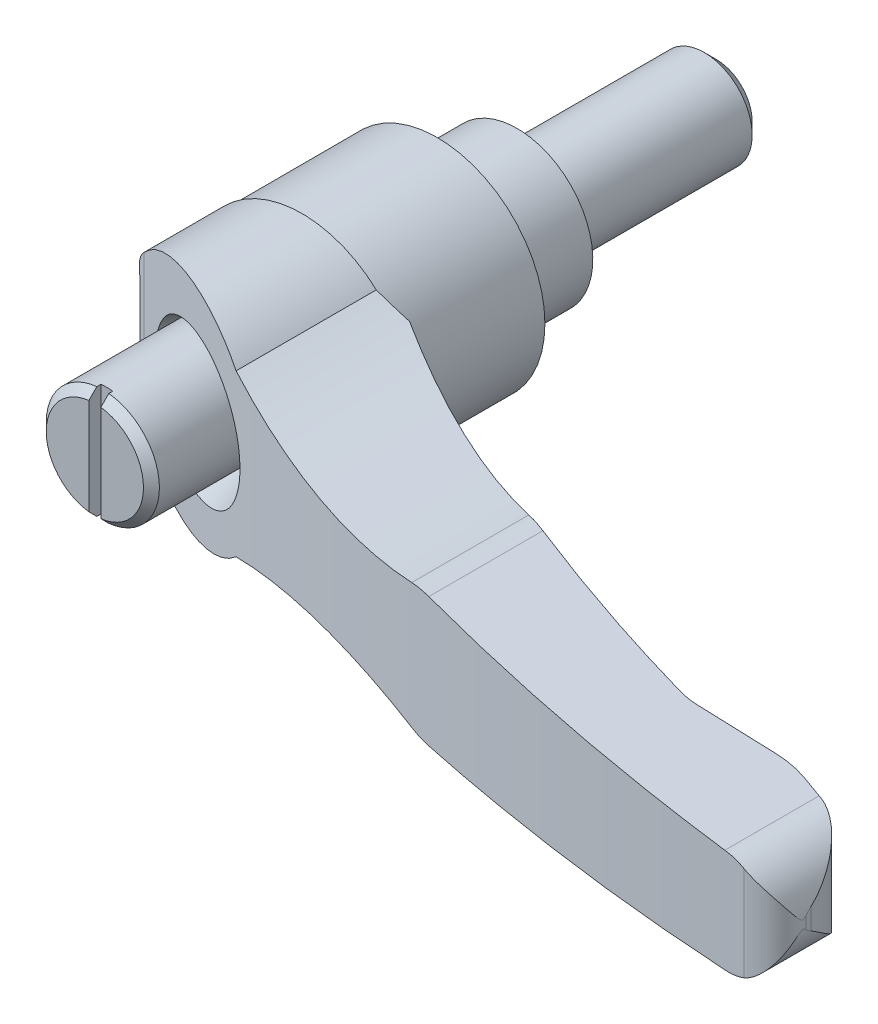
ISO-10303-21;
HEADER;
FILE_DESCRIPTION(('STEP AP214'),'2;1');
FILE_NAME('part.step','',(''),(''),'','','');
FILE_SCHEMA(('AUTOMOTIVE_DESIGN { 1 0 10303 214 1 1 1 1 }'));
ENDSEC;
DATA;
#1=APPLICATION_CONTEXT('core data for automotive mechanical design processes');
#2=APPLICATION_PROTOCOL_DEFINITION('international standard','automotive_design',2000,#1);
#3=PRODUCT_CONTEXT('',#1,'mechanical');
#4=PRODUCT('Part','Part','',(#3));
#5=PRODUCT_RELATED_PRODUCT_CATEGORY('part','',(#4));
#6=PRODUCT_DEFINITION_FORMATION('','',#4);
#7=PRODUCT_DEFINITION_CONTEXT('part definition',#1,'design');
#8=PRODUCT_DEFINITION('design','',#6,#7);
#9=PRODUCT_DEFINITION_SHAPE('','',#8);
#10=(LENGTH_UNIT() NAMED_UNIT(*) SI_UNIT(.MILLI.,.METRE.));
#11=(NAMED_UNIT(*) PLANE_ANGLE_UNIT() SI_UNIT($,.RADIAN.));
#12=(NAMED_UNIT(*) SI_UNIT($,.STERADIAN.) SOLID_ANGLE_UNIT());
#13=UNCERTAINTY_MEASURE_WITH_UNIT(LENGTH_MEASURE(1.E-05),#10,'distance_accuracy_value','');
#14=(GEOMETRIC_REPRESENTATION_CONTEXT(3) GLOBAL_UNCERTAINTY_ASSIGNED_CONTEXT((#13)) GLOBAL_UNIT_ASSIGNED_CONTEXT((#10,
#11,#12)) REPRESENTATION_CONTEXT('',''));
#15=CARTESIAN_POINT('',(0.,0.,0.));
#16=DIRECTION('',(0.,0.,1.));
#17=DIRECTION('',(1.,0.,0.));
#18=AXIS2_PLACEMENT_3D('',#15,#16,#17);
#19=CARTESIAN_POINT('',(0.,0.,-25.));
#20=DIRECTION('',(0.,0.,-1.));
#21=DIRECTION('',(0.,1.,0.));
#22=AXIS2_PLACEMENT_3D('',#19,#20,#21);
#23=PLANE('',#22);
#24=CARTESIAN_POINT('',(0.,0.,-25.));
#25=DIRECTION('',(0.,0.,-1.));
#26=DIRECTION('',(0.,1.,0.));
#27=AXIS2_PLACEMENT_3D('',#24,#25,#26);
#28=CIRCLE('',#27,4.5);
#29=CARTESIAN_POINT('',(0.,4.5,-25.));
#30=VERTEX_POINT('',#29);
#31=EDGE_CURVE('E1102',#30,#30,#28,.T.);
#32=ORIENTED_EDGE('',*,*,#31,.T.);
#33=EDGE_LOOP('',(#32));
#34=FACE_BOUND('',#33,.T.);
#35=ADVANCED_FACE('F14',(#34),#23,.T.);
#36=CARTESIAN_POINT('',(0.,0.,-25.));
#37=DIRECTION('',(0.,0.,1.));
#38=DIRECTION('',(0.,-1.,0.));
#39=AXIS2_PLACEMENT_3D('',#36,#37,#38);
#40=CONICAL_SURFACE('',#39,4.5,0.785398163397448);
#41=CARTESIAN_POINT('',(0.,0.,-23.5));
#42=DIRECTION('',(0.,0.,-1.));
#43=DIRECTION('',(0.,1.,0.));
#44=AXIS2_PLACEMENT_3D('',#41,#42,#43);
#45=CIRCLE('',#44,6.);
#46=CARTESIAN_POINT('',(0.,6.,-23.5));
#47=VERTEX_POINT('',#46);
#48=EDGE_CURVE('E18',#47,#47,#45,.F.);
#49=ORIENTED_EDGE('',*,*,#48,.F.);
#50=EDGE_LOOP('',(#49));
#51=FACE_BOUND('',#50,.T.);
#52=ORIENTED_EDGE('',*,*,#31,.F.);
#53=EDGE_LOOP('',(#52));
#54=FACE_BOUND('',#53,.T.);
#55=ADVANCED_FACE('F869',(#51,#54),#40,.T.);
#56=CARTESIAN_POINT('',(0.,0.,-25.));
#57=DIRECTION('',(0.,0.,1.));
#58=DIRECTION('',(0.,-1.,0.));
#59=AXIS2_PLACEMENT_3D('',#56,#57,#58);
#60=CYLINDRICAL_SURFACE('',#59,6.);
#61=ORIENTED_EDGE('',*,*,#48,.T.);
#62=EDGE_LOOP('',(#61));
#63=FACE_BOUND('',#62,.T.);
#64=CARTESIAN_POINT('',(0.,0.,0.));
#65=DIRECTION('',(0.,0.,-1.));
#66=DIRECTION('',(0.,1.,0.));
#67=AXIS2_PLACEMENT_3D('',#64,#65,#66);
#68=CIRCLE('',#67,6.);
#69=CARTESIAN_POINT('',(0.,6.,0.));
#70=VERTEX_POINT('',#69);
#71=EDGE_CURVE('E1143',#70,#70,#68,.T.);
#72=ORIENTED_EDGE('',*,*,#71,.T.);
#73=EDGE_LOOP('',(#72));
#74=FACE_BOUND('',#73,.T.);
#75=ADVANCED_FACE('F1013',(#63,#74),#60,.T.);
#76=CARTESIAN_POINT('',(9.5,0.,0.));
#77=DIRECTION('',(0.,0.,-1.));
#78=DIRECTION('',(0.,1.,0.));
#79=AXIS2_PLACEMENT_3D('',#76,#77,#78);
#80=PLANE('',#79);
#81=CARTESIAN_POINT('',(0.,0.,0.));
#82=DIRECTION('',(0.,0.,1.));
#83=DIRECTION('',(0.,-1.,0.));
#84=AXIS2_PLACEMENT_3D('',#81,#82,#83);
#85=CIRCLE('',#84,9.5);
#86=CARTESIAN_POINT('',(0.,-9.5,0.));
#87=VERTEX_POINT('',#86);
#88=EDGE_CURVE('E1126',#87,#87,#85,.T.);
#89=ORIENTED_EDGE('',*,*,#88,.F.);
#90=EDGE_LOOP('',(#89));
#91=FACE_BOUND('',#90,.T.);
#92=ORIENTED_EDGE('',*,*,#71,.F.);
#93=EDGE_LOOP('',(#92));
#94=FACE_BOUND('',#93,.T.);
#95=ADVANCED_FACE('F1005',(#91,#94),#80,.T.);
#96=CARTESIAN_POINT('',(0.,0.,10.));
#97=DIRECTION('',(0.,0.,1.));
#98=DIRECTION('',(0.,-1.,0.));
#99=AXIS2_PLACEMENT_3D('',#96,#97,#98);
#100=CYLINDRICAL_SURFACE('',#99,9.5);
#101=ORIENTED_EDGE('',*,*,#88,.T.);
#102=EDGE_LOOP('',(#101));
#103=FACE_BOUND('',#102,.T.);
#104=CARTESIAN_POINT('',(0.,0.,10.7));
#105=DIRECTION('',(0.,0.,1.));
#106=DIRECTION('',(0.,-1.,0.));
#107=AXIS2_PLACEMENT_3D('',#104,#105,#106);
#108=CIRCLE('',#107,9.5);
#109=CARTESIAN_POINT('',(0.,-9.5,10.7));
#110=VERTEX_POINT('',#109);
#111=EDGE_CURVE('E555',#110,#110,#108,.T.);
#112=ORIENTED_EDGE('',*,*,#111,.F.);
#113=EDGE_LOOP('',(#112));
#114=FACE_BOUND('',#113,.T.);
#115=ADVANCED_FACE('F997',(#103,#114),#100,.T.);
#116=CARTESIAN_POINT('',(0.,0.,53.));
#117=DIRECTION('',(0.,0.,-1.));
#118=DIRECTION('',(0.,1.,0.));
#119=AXIS2_PLACEMENT_3D('',#116,#117,#118);
#120=PLANE('',#119);
#121=CARTESIAN_POINT('',(0.,0.,53.));
#122=DIRECTION('',(0.,0.,-1.));
#123=DIRECTION('',(0.,1.,0.));
#124=AXIS2_PLACEMENT_3D('',#121,#122,#123);
#125=CIRCLE('',#124,6.1);
#126=CARTESIAN_POINT('',(-0.75,6.05371786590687,53.));
#127=VERTEX_POINT('',#126);
#128=CARTESIAN_POINT('',(-0.75,-6.05371786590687,53.));
#129=VERTEX_POINT('',#128);
#130=EDGE_CURVE('E1136',#127,#129,#125,.F.);
#131=ORIENTED_EDGE('',*,*,#130,.T.);
#132=DIRECTION('',(0.,-1.,0.));
#133=VECTOR('',#132,1.);
#134=CARTESIAN_POINT('',(-0.75,8.,53.));
#135=LINE('',#134,#133);
#136=EDGE_CURVE('E78',#127,#129,#135,.T.);
#137=ORIENTED_EDGE('',*,*,#136,.F.);
#138=EDGE_LOOP('',(#131,#137));
#139=FACE_BOUND('',#138,.T.);
#140=ADVANCED_FACE('F988',(#139),#120,.F.);
#141=CARTESIAN_POINT('',(0.75,-6.05371786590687,53.));
#142=VERTEX_POINT('',#141);
#143=CARTESIAN_POINT('',(0.75,6.05371786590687,53.));
#144=VERTEX_POINT('',#143);
#145=EDGE_CURVE('E1135',#142,#144,#125,.F.);
#146=ORIENTED_EDGE('',*,*,#145,.T.);
#147=DIRECTION('',(0.,1.,0.));
#148=VECTOR('',#147,1.);
#149=CARTESIAN_POINT('',(0.75,8.,53.));
#150=LINE('',#149,#148);
#151=EDGE_CURVE('E1142',#142,#144,#150,.T.);
#152=ORIENTED_EDGE('',*,*,#151,.F.);
#153=EDGE_LOOP('',(#146,#152));
#154=FACE_BOUND('',#153,.T.);
#155=ADVANCED_FACE('F980',(#154),#120,.F.);
#156=CARTESIAN_POINT('',(0.,0.,52.));
#157=DIRECTION('',(0.,0.,-1.));
#158=DIRECTION('',(0.,1.,0.));
#159=AXIS2_PLACEMENT_3D('',#156,#157,#158);
#160=CONICAL_SURFACE('',#159,7.1,0.785398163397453);
#161=CARTESIAN_POINT('',(0.75,0.951118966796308,57.8887497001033));
#162=CARTESIAN_POINT('',(0.75,0.997729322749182,57.8521159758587));
#163=CARTESIAN_POINT('',(0.75,1.04386566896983,57.8148914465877));
#164=CARTESIAN_POINT('',(0.75,1.13537561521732,57.739528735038));
#165=CARTESIAN_POINT('',(0.75,1.18074933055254,57.7013906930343));
#166=CARTESIAN_POINT('',(0.75,1.27091534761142,57.6244729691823));
#167=CARTESIAN_POINT('',(0.75,1.31570787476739,57.5856935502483));
#168=CARTESIAN_POINT('',(0.75,1.40485247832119,57.5076283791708));
#169=CARTESIAN_POINT('',(0.75,1.44920453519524,57.4683426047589));
#170=CARTESIAN_POINT('',(0.75,1.58169988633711,57.3499450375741));
#171=CARTESIAN_POINT('',(0.75,1.66932612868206,57.2702552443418));
#172=CARTESIAN_POINT('',(0.75,1.84368990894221,57.1098911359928));
#173=CARTESIAN_POINT('',(0.75,1.93042732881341,57.0292166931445));
#174=CARTESIAN_POINT('',(0.75,2.10971544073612,56.861172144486));
#175=CARTESIAN_POINT('',(0.75,2.20221805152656,56.7737507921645));
#176=CARTESIAN_POINT('',(0.75,2.38671926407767,56.5983774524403));
#177=CARTESIAN_POINT('',(0.75,2.47871786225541,56.5104254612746));
#178=CARTESIAN_POINT('',(0.75,2.7541756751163,56.2460021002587));
#179=CARTESIAN_POINT('',(0.75,2.9370932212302,56.0689668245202));
#180=CARTESIAN_POINT('',(0.75,3.30210724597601,55.7140539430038));
#181=CARTESIAN_POINT('',(0.75,3.48420372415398,55.5361763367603));
#182=CARTESIAN_POINT('',(0.75,3.84786939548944,55.179887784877));
#183=CARTESIAN_POINT('',(0.75,4.02943859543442,55.0014768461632));
#184=CARTESIAN_POINT('',(0.75,4.57392692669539,54.465435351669));
#185=CARTESIAN_POINT('',(0.75,4.93633257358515,54.1072835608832));
#186=CARTESIAN_POINT('',(0.75,5.66045121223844,53.390294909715));
#187=CARTESIAN_POINT('',(0.75,6.02216421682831,53.0314580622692));
#188=CARTESIAN_POINT('',(0.75,6.82917978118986,52.2299586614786));
#189=CARTESIAN_POINT('',(0.75,7.27437763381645,51.7871906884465));
#190=CARTESIAN_POINT('',(0.75,8.16443041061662,50.9013041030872));
#191=CARTESIAN_POINT('',(0.75,8.60928533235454,50.458185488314));
#192=CARTESIAN_POINT('',(0.75,9.49827033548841,49.5722363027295));
#193=CARTESIAN_POINT('',(0.75,9.9424006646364,49.1294059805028));
#194=CARTESIAN_POINT('',(0.75,10.8305081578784,48.2435985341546));
#195=CARTESIAN_POINT('',(0.75,11.2744853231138,47.8006214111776));
#196=CARTESIAN_POINT('',(0.75,11.7184210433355,47.357602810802));
#197=B_SPLINE_CURVE_WITH_KNOTS('',3,(#161,#162,#163,#164,#165,#166,#167,#168,#169,#170,#171,
#172,#173,#174,#175,#176,#177,#178,#179,#180,#181,#182,#183,#184,#185,#186,#187,#188,#189,#190,
#191,#192,#193,#194,#195,#196),.UNSPECIFIED.,.F.,.F.,(4,2,2,2,2,2,2,2,2,2,2,2,2,2,2,2,2,4),(0.,
0.177835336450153,0.355643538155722,0.53338057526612,0.711125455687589,1.06644183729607,
1.42180481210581,1.80363011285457,2.18545812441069,2.94912935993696,3.71280101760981,
4.47646280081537,6.00502032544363,7.53354926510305,9.41721585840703,11.3008957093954,
13.1824253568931,15.0639406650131),.UNSPECIFIED.);
#198=CARTESIAN_POINT('',(0.75,7.06027619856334,52.));
#199=VERTEX_POINT('',#198);
#200=EDGE_CURVE('E72',#144,#199,#197,.T.);
#201=ORIENTED_EDGE('',*,*,#200,.F.);
#202=ORIENTED_EDGE('',*,*,#145,.F.);
#203=CARTESIAN_POINT('',(0.75,-11.7184210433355,47.357602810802));
#204=CARTESIAN_POINT('',(0.75,-11.2742043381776,47.8009027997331));
#205=CARTESIAN_POINT('',(0.75,-10.8299454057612,48.2441605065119));
#206=CARTESIAN_POINT('',(0.75,-9.94129135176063,49.1305117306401));
#207=CARTESIAN_POINT('',(0.75,-9.49689623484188,49.5736052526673));
#208=CARTESIAN_POINT('',(0.75,-8.60792856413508,50.4595380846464));
#209=CARTESIAN_POINT('',(0.75,-8.16335602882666,50.9023774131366));
#210=CARTESIAN_POINT('',(0.75,-7.4962270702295,51.5663777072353));
#211=CARTESIAN_POINT('',(0.75,-7.2738025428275,51.7876711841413));
#212=CARTESIAN_POINT('',(0.75,-6.82883642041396,52.2301418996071));
#213=CARTESIAN_POINT('',(0.75,-6.60629482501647,52.4513191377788));
#214=CARTESIAN_POINT('',(0.75,-6.16101676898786,52.8935556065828));
#215=CARTESIAN_POINT('',(0.75,-5.93828028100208,53.1146148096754));
#216=CARTESIAN_POINT('',(0.75,-5.49259424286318,53.5565130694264));
#217=CARTESIAN_POINT('',(0.75,-5.26964469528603,53.7773521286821));
#218=CARTESIAN_POINT('',(0.75,-4.82345470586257,54.2186949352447));
#219=CARTESIAN_POINT('',(0.75,-4.60021429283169,54.4391987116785));
#220=CARTESIAN_POINT('',(0.75,-4.15325548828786,54.8797409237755));
#221=CARTESIAN_POINT('',(0.75,-3.92953707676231,55.0997793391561));
#222=CARTESIAN_POINT('',(0.75,-3.59334641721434,55.4292843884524));
#223=CARTESIAN_POINT('',(0.75,-3.48116243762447,55.5390450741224));
#224=CARTESIAN_POINT('',(0.75,-3.25653883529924,55.7583019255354));
#225=CARTESIAN_POINT('',(0.75,-3.1440992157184,55.8677980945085));
#226=CARTESIAN_POINT('',(0.75,-2.91888858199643,56.0864176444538));
#227=CARTESIAN_POINT('',(0.75,-2.80611761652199,56.195541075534));
#228=CARTESIAN_POINT('',(0.75,-2.58008490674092,56.4132893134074));
#229=CARTESIAN_POINT('',(0.75,-2.46682314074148,56.521914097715));
#230=CARTESIAN_POINT('',(0.75,-2.23953201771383,56.7384726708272));
#231=CARTESIAN_POINT('',(0.75,-2.12550230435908,56.846406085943));
#232=CARTESIAN_POINT('',(0.75,-1.89636997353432,57.0611055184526));
#233=CARTESIAN_POINT('',(0.75,-1.78126749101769,57.1678716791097));
#234=CARTESIAN_POINT('',(0.75,-1.60721719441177,57.3265597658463));
#235=CARTESIAN_POINT('',(0.75,-1.54895038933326,57.3792274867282));
#236=CARTESIAN_POINT('',(0.75,-1.431805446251,57.4838719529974));
#237=CARTESIAN_POINT('',(0.75,-1.37292734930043,57.5358487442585));
#238=CARTESIAN_POINT('',(0.75,-1.25430647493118,57.6388648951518));
#239=CARTESIAN_POINT('',(0.75,-1.19456332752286,57.6899038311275));
#240=CARTESIAN_POINT('',(0.75,-1.10405110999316,57.765401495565));
#241=CARTESIAN_POINT('',(0.75,-1.07372732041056,57.79039335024));
#242=CARTESIAN_POINT('',(0.75,-1.01271379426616,57.8399303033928));
#243=CARTESIAN_POINT('',(0.75,-0.98202403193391,57.8644753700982));
#244=CARTESIAN_POINT('',(0.75,-0.951118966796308,57.8887497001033));
#245=B_SPLINE_CURVE_WITH_KNOTS('',3,(#203,#204,#205,#206,#207,#208,#209,#210,#211,#212,#213,
#214,#215,#216,#217,#218,#219,#220,#221,#222,#223,#224,#225,#226,#227,#228,#229,#230,#231,#232,
#233,#234,#235,#236,#237,#238,#239,#240,#241,#242,#243,#244),.UNSPECIFIED.,.F.,.F.,(4,2,2,2,2,2,
2,2,2,2,2,2,2,2,2,2,2,2,2,2,4),(0.,1.88270825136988,3.76535794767,5.64784623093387,
6.58911728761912,7.53039146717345,8.47183092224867,9.41325913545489,10.3546002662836,
11.2959816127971,11.7668251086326,12.2376628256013,12.7084345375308,13.1792272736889,
13.6502560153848,14.1212262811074,14.3568495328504,14.5924570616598,14.8281685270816,
14.9460508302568,15.0639414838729),.UNSPECIFIED.);
#246=CARTESIAN_POINT('',(0.75,-7.06027619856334,52.));
#247=VERTEX_POINT('',#246);
#248=EDGE_CURVE('E1085',#247,#142,#245,.T.);
#249=ORIENTED_EDGE('',*,*,#248,.F.);
#250=CARTESIAN_POINT('',(0.,0.,52.));
#251=DIRECTION('',(0.,0.,-1.));
#252=DIRECTION('',(0.,1.,0.));
#253=AXIS2_PLACEMENT_3D('',#250,#251,#252);
#254=CIRCLE('',#253,7.1);
#255=EDGE_CURVE('E1123',#199,#247,#254,.T.);
#256=ORIENTED_EDGE('',*,*,#255,.F.);
#257=EDGE_LOOP('',(#201,#202,#249,#256));
#258=FACE_BOUND('',#257,.T.);
#259=ADVANCED_FACE('F971',(#258),#160,.T.);
#260=CARTESIAN_POINT('',(-0.75,11.7184210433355,47.357602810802));
#261=CARTESIAN_POINT('',(-0.75,11.2742043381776,47.8009027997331));
#262=CARTESIAN_POINT('',(-0.75,10.8299454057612,48.2441605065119));
#263=CARTESIAN_POINT('',(-0.75,9.94129135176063,49.1305117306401));
#264=CARTESIAN_POINT('',(-0.75,9.49689623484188,49.5736052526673));
#265=CARTESIAN_POINT('',(-0.75,8.60792856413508,50.4595380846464));
#266=CARTESIAN_POINT('',(-0.75,8.16335602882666,50.9023774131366));
#267=CARTESIAN_POINT('',(-0.75,7.4962270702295,51.5663777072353));
#268=CARTESIAN_POINT('',(-0.75,7.2738025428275,51.7876711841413));
#269=CARTESIAN_POINT('',(-0.75,6.82883642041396,52.2301418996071));
#270=CARTESIAN_POINT('',(-0.75,6.60629482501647,52.4513191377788));
#271=CARTESIAN_POINT('',(-0.75,6.16101676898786,52.8935556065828));
#272=CARTESIAN_POINT('',(-0.75,5.93828028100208,53.1146148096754));
#273=CARTESIAN_POINT('',(-0.75,5.49259424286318,53.5565130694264));
#274=CARTESIAN_POINT('',(-0.75,5.26964469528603,53.7773521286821));
#275=CARTESIAN_POINT('',(-0.75,4.82345470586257,54.2186949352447));
#276=CARTESIAN_POINT('',(-0.75,4.60021429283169,54.4391987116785));
#277=CARTESIAN_POINT('',(-0.75,4.15325548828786,54.8797409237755));
#278=CARTESIAN_POINT('',(-0.75,3.92953707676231,55.0997793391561));
#279=CARTESIAN_POINT('',(-0.75,3.59334641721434,55.4292843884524));
#280=CARTESIAN_POINT('',(-0.75,3.48116243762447,55.5390450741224));
#281=CARTESIAN_POINT('',(-0.75,3.25653883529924,55.7583019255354));
#282=CARTESIAN_POINT('',(-0.75,3.1440992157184,55.8677980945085));
#283=CARTESIAN_POINT('',(-0.75,2.91888858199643,56.0864176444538));
#284=CARTESIAN_POINT('',(-0.75,2.80611761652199,56.195541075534));
#285=CARTESIAN_POINT('',(-0.75,2.58008490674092,56.4132893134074));
#286=CARTESIAN_POINT('',(-0.75,2.46682314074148,56.521914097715));
#287=CARTESIAN_POINT('',(-0.75,2.23953201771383,56.7384726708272));
#288=CARTESIAN_POINT('',(-0.75,2.12550230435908,56.846406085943));
#289=CARTESIAN_POINT('',(-0.75,1.89636997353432,57.0611055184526));
#290=CARTESIAN_POINT('',(-0.75,1.78126749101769,57.1678716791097));
#291=CARTESIAN_POINT('',(-0.75,1.60721719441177,57.3265597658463));
#292=CARTESIAN_POINT('',(-0.75,1.54895038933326,57.3792274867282));
#293=CARTESIAN_POINT('',(-0.75,1.431805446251,57.4838719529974));
#294=CARTESIAN_POINT('',(-0.75,1.37292734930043,57.5358487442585));
#295=CARTESIAN_POINT('',(-0.75,1.25430647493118,57.6388648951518));
#296=CARTESIAN_POINT('',(-0.75,1.19456332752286,57.6899038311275));
#297=CARTESIAN_POINT('',(-0.75,1.10405110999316,57.765401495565));
#298=CARTESIAN_POINT('',(-0.75,1.07372732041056,57.79039335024));
#299=CARTESIAN_POINT('',(-0.75,1.01271379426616,57.8399303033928));
#300=CARTESIAN_POINT('',(-0.75,0.98202403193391,57.8644753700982));
#301=CARTESIAN_POINT('',(-0.75,0.951118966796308,57.8887497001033));
#302=B_SPLINE_CURVE_WITH_KNOTS('',3,(#260,#261,#262,#263,#264,#265,#266,#267,#268,#269,#270,
#271,#272,#273,#274,#275,#276,#277,#278,#279,#280,#281,#282,#283,#284,#285,#286,#287,#288,#289,
#290,#291,#292,#293,#294,#295,#296,#297,#298,#299,#300,#301),.UNSPECIFIED.,.F.,.F.,(4,2,2,2,2,2,
2,2,2,2,2,2,2,2,2,2,2,2,2,2,4),(0.,1.88270825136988,3.76535794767,5.64784623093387,
6.58911728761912,7.53039146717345,8.47183092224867,9.41325913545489,10.3546002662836,
11.2959816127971,11.7668251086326,12.2376628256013,12.7084345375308,13.1792272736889,
13.6502560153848,14.1212262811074,14.3568495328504,14.5924570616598,14.8281685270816,
14.9460508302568,15.0639414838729),.UNSPECIFIED.);
#303=CARTESIAN_POINT('',(-0.75,7.06027619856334,52.));
#304=VERTEX_POINT('',#303);
#305=EDGE_CURVE('E1079',#304,#127,#302,.T.);
#306=ORIENTED_EDGE('',*,*,#305,.F.);
#307=CARTESIAN_POINT('',(-0.75,-7.06027619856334,52.));
#308=VERTEX_POINT('',#307);
#309=EDGE_CURVE('E1134',#308,#304,#254,.T.);
#310=ORIENTED_EDGE('',*,*,#309,.F.);
#311=CARTESIAN_POINT('',(-0.75,-0.951118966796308,57.8887497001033));
#312=CARTESIAN_POINT('',(-0.75,-0.997729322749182,57.8521159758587));
#313=CARTESIAN_POINT('',(-0.75,-1.04386566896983,57.8148914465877));
#314=CARTESIAN_POINT('',(-0.75,-1.13537561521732,57.739528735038));
#315=CARTESIAN_POINT('',(-0.75,-1.18074933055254,57.7013906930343));
#316=CARTESIAN_POINT('',(-0.75,-1.27091534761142,57.6244729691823));
#317=CARTESIAN_POINT('',(-0.75,-1.31570787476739,57.5856935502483));
#318=CARTESIAN_POINT('',(-0.75,-1.40485247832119,57.5076283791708));
#319=CARTESIAN_POINT('',(-0.75,-1.44920453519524,57.4683426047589));
#320=CARTESIAN_POINT('',(-0.75,-1.58169988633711,57.3499450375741));
#321=CARTESIAN_POINT('',(-0.75,-1.66932612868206,57.2702552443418));
#322=CARTESIAN_POINT('',(-0.75,-1.84368990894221,57.1098911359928));
#323=CARTESIAN_POINT('',(-0.75,-1.93042732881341,57.0292166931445));
#324=CARTESIAN_POINT('',(-0.75,-2.10971544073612,56.861172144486));
#325=CARTESIAN_POINT('',(-0.75,-2.20221805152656,56.7737507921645));
#326=CARTESIAN_POINT('',(-0.75,-2.38671926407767,56.5983774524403));
#327=CARTESIAN_POINT('',(-0.75,-2.47871786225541,56.5104254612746));
#328=CARTESIAN_POINT('',(-0.75,-2.7541756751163,56.2460021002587));
#329=CARTESIAN_POINT('',(-0.75,-2.9370932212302,56.0689668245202));
#330=CARTESIAN_POINT('',(-0.75,-3.30210724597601,55.7140539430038));
#331=CARTESIAN_POINT('',(-0.75,-3.48420372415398,55.5361763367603));
#332=CARTESIAN_POINT('',(-0.75,-3.84786939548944,55.179887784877));
#333=CARTESIAN_POINT('',(-0.75,-4.02943859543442,55.0014768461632));
#334=CARTESIAN_POINT('',(-0.75,-4.57392692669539,54.465435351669));
#335=CARTESIAN_POINT('',(-0.75,-4.93633257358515,54.1072835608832));
#336=CARTESIAN_POINT('',(-0.75,-5.66045121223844,53.390294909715));
#337=CARTESIAN_POINT('',(-0.75,-6.02216421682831,53.0314580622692));
#338=CARTESIAN_POINT('',(-0.75,-6.82917978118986,52.2299586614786));
#339=CARTESIAN_POINT('',(-0.75,-7.27437763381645,51.7871906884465));
#340=CARTESIAN_POINT('',(-0.75,-8.16443041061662,50.9013041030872));
#341=CARTESIAN_POINT('',(-0.75,-8.60928533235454,50.458185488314));
#342=CARTESIAN_POINT('',(-0.75,-9.49827033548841,49.5722363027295));
#343=CARTESIAN_POINT('',(-0.75,-9.9424006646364,49.1294059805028));
#344=CARTESIAN_POINT('',(-0.75,-10.8305081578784,48.2435985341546));
#345=CARTESIAN_POINT('',(-0.75,-11.2744853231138,47.8006214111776));
#346=CARTESIAN_POINT('',(-0.75,-11.7184210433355,47.357602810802));
#347=B_SPLINE_CURVE_WITH_KNOTS('',3,(#311,#312,#313,#314,#315,#316,#317,#318,#319,#320,#321,
#322,#323,#324,#325,#326,#327,#328,#329,#330,#331,#332,#333,#334,#335,#336,#337,#338,#339,#340,
#341,#342,#343,#344,#345,#346),.UNSPECIFIED.,.F.,.F.,(4,2,2,2,2,2,2,2,2,2,2,2,2,2,2,2,2,4),(0.,
0.177835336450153,0.355643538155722,0.53338057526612,0.711125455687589,1.06644183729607,
1.42180481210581,1.80363011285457,2.18545812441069,2.94912935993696,3.71280101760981,
4.47646280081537,6.00502032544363,7.53354926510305,9.41721585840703,11.3008957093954,
13.1824253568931,15.0639406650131),.UNSPECIFIED.);
#348=EDGE_CURVE('E1072',#129,#308,#347,.T.);
#349=ORIENTED_EDGE('',*,*,#348,.F.);
#350=ORIENTED_EDGE('',*,*,#130,.F.);
#351=EDGE_LOOP('',(#306,#310,#349,#350));
#352=FACE_BOUND('',#351,.T.);
#353=ADVANCED_FACE('F963',(#352),#160,.T.);
#354=CARTESIAN_POINT('',(-0.75,8.,51.5));
#355=DIRECTION('',(-1.,0.,0.));
#356=DIRECTION('',(0.,-1.,0.));
#357=AXIS2_PLACEMENT_3D('',#354,#355,#356);
#358=PLANE('',#357);
#359=DIRECTION('',(0.,0.,1.));
#360=VECTOR('',#359,1.);
#361=CARTESIAN_POINT('',(-0.75,7.06027619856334,10.));
#362=LINE('',#361,#360);
#363=CARTESIAN_POINT('',(-0.75,7.06027619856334,51.5));
#364=VERTEX_POINT('',#363);
#365=EDGE_CURVE('E1124',#364,#304,#362,.T.);
#366=ORIENTED_EDGE('',*,*,#365,.T.);
#367=ORIENTED_EDGE('',*,*,#305,.T.);
#368=ORIENTED_EDGE('',*,*,#136,.T.);
#369=ORIENTED_EDGE('',*,*,#348,.T.);
#370=DIRECTION('',(0.,0.,1.));
#371=VECTOR('',#370,1.);
#372=CARTESIAN_POINT('',(-0.75,-7.06027619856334,10.));
#373=LINE('',#372,#371);
#374=CARTESIAN_POINT('',(-0.75,-7.06027619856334,51.5));
#375=VERTEX_POINT('',#374);
#376=EDGE_CURVE('E1128',#308,#375,#373,.F.);
#377=ORIENTED_EDGE('',*,*,#376,.T.);
#378=DIRECTION('',(0.,-1.,0.));
#379=VECTOR('',#378,1.);
#380=CARTESIAN_POINT('',(-0.75,8.,51.5));
#381=LINE('',#380,#379);
#382=EDGE_CURVE('E1113',#364,#375,#381,.T.);
#383=ORIENTED_EDGE('',*,*,#382,.F.);
#384=EDGE_LOOP('',(#366,#367,#368,#369,#377,#383));
#385=FACE_BOUND('',#384,.T.);
#386=ADVANCED_FACE('F954',(#385),#358,.F.);
#387=CARTESIAN_POINT('',(0.75,-8.,51.5));
#388=DIRECTION('',(0.,0.,-1.));
#389=DIRECTION('',(0.,1.,0.));
#390=AXIS2_PLACEMENT_3D('',#387,#388,#389);
#391=PLANE('',#390);
#392=CARTESIAN_POINT('',(0.,0.,51.5));
#393=DIRECTION('',(0.,0.,-1.));
#394=DIRECTION('',(0.,1.,0.));
#395=AXIS2_PLACEMENT_3D('',#392,#393,#394);
#396=CIRCLE('',#395,7.1);
#397=CARTESIAN_POINT('',(0.75,-7.06027619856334,51.5));
#398=VERTEX_POINT('',#397);
#399=EDGE_CURVE('E1101',#375,#398,#396,.F.);
#400=ORIENTED_EDGE('',*,*,#399,.T.);
#401=DIRECTION('',(0.,1.,0.));
#402=VECTOR('',#401,1.);
#403=CARTESIAN_POINT('',(0.75,8.,51.5));
#404=LINE('',#403,#402);
#405=CARTESIAN_POINT('',(0.75,7.06027619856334,51.5));
#406=VERTEX_POINT('',#405);
#407=EDGE_CURVE('E1110',#398,#406,#404,.T.);
#408=ORIENTED_EDGE('',*,*,#407,.T.);
#409=EDGE_CURVE('E1100',#406,#364,#396,.F.);
#410=ORIENTED_EDGE('',*,*,#409,.T.);
#411=ORIENTED_EDGE('',*,*,#382,.T.);
#412=EDGE_LOOP('',(#400,#408,#410,#411));
#413=FACE_BOUND('',#412,.T.);
#414=ADVANCED_FACE('F947',(#413),#391,.F.);
#415=CARTESIAN_POINT('',(0.75,8.,51.5));
#416=DIRECTION('',(1.,0.,0.));
#417=DIRECTION('',(0.,1.,0.));
#418=AXIS2_PLACEMENT_3D('',#415,#416,#417);
#419=PLANE('',#418);
#420=DIRECTION('',(0.,0.,1.));
#421=VECTOR('',#420,1.);
#422=CARTESIAN_POINT('',(0.75,7.06027619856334,10.));
#423=LINE('',#422,#421);
#424=EDGE_CURVE('E1118',#199,#406,#423,.F.);
#425=ORIENTED_EDGE('',*,*,#424,.T.);
#426=ORIENTED_EDGE('',*,*,#407,.F.);
#427=DIRECTION('',(0.,0.,1.));
#428=VECTOR('',#427,1.);
#429=CARTESIAN_POINT('',(0.75,-7.06027619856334,10.));
#430=LINE('',#429,#428);
#431=EDGE_CURVE('E1116',#398,#247,#430,.T.);
#432=ORIENTED_EDGE('',*,*,#431,.T.);
#433=ORIENTED_EDGE('',*,*,#248,.T.);
#434=ORIENTED_EDGE('',*,*,#151,.T.);
#435=ORIENTED_EDGE('',*,*,#200,.T.);
#436=EDGE_LOOP('',(#425,#426,#432,#433,#434,#435));
#437=FACE_BOUND('',#436,.T.);
#438=ADVANCED_FACE('F518',(#437),#419,.F.);
#439=CARTESIAN_POINT('',(0.,0.,10.));
#440=DIRECTION('',(0.,0.,1.));
#441=DIRECTION('',(0.,-1.,0.));
#442=AXIS2_PLACEMENT_3D('',#439,#440,#441);
#443=CYLINDRICAL_SURFACE('',#442,7.1);
#444=ORIENTED_EDGE('',*,*,#431,.F.);
#445=ORIENTED_EDGE('',*,*,#399,.F.);
#446=ORIENTED_EDGE('',*,*,#376,.F.);
#447=ORIENTED_EDGE('',*,*,#309,.T.);
#448=ORIENTED_EDGE('',*,*,#365,.F.);
#449=ORIENTED_EDGE('',*,*,#409,.F.);
#450=ORIENTED_EDGE('',*,*,#424,.F.);
#451=ORIENTED_EDGE('',*,*,#255,.T.);
#452=EDGE_LOOP('',(#444,#445,#446,#447,#448,#449,#450,#451));
#453=FACE_BOUND('',#452,.T.);
#454=CARTESIAN_POINT('',(0.,0.,36.66));
#455=DIRECTION('',(0.,0.,1.));
#456=DIRECTION('',(0.,-1.,0.));
#457=AXIS2_PLACEMENT_3D('',#454,#455,#456);
#458=CIRCLE('',#457,7.1);
#459=CARTESIAN_POINT('',(0.,-7.1,36.66));
#460=VERTEX_POINT('',#459);
#461=EDGE_CURVE('E550',#460,#460,#458,.T.);
#462=ORIENTED_EDGE('',*,*,#461,.T.);
#463=EDGE_LOOP('',(#462));
#464=FACE_BOUND('',#463,.T.);
#465=ADVANCED_FACE('F16',(#453,#464),#443,.T.);
#466=CARTESIAN_POINT('',(-13.51,-14.75,27.));
#467=DIRECTION('',(0.,0.,1.));
#468=DIRECTION('',(0.,-1.,0.));
#469=AXIS2_PLACEMENT_3D('',#466,#467,#468);
#470=PLANE('',#469);
#471=CARTESIAN_POINT('',(29.1499999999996,-64.9100000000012,27.));
#472=DIRECTION('',(0.,0.,1.));
#473=DIRECTION('',(0.,-1.,0.));
#474=AXIS2_PLACEMENT_3D('',#471,#472,#473);
#475=CIRCLE('',#474,58.2800000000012);
#476=CARTESIAN_POINT('',(9.32365402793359,-10.106036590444,27.));
#477=VERTEX_POINT('',#476);
#478=CARTESIAN_POINT('',(13.49,-8.77335599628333,27.));
#479=VERTEX_POINT('',#478);
#480=EDGE_CURVE('E610',#477,#479,#475,.F.);
#481=ORIENTED_EDGE('',*,*,#480,.F.);
#482=CARTESIAN_POINT('',(0.,0.,27.));
#483=DIRECTION('',(0.,0.,1.));
#484=DIRECTION('',(0.,-1.,0.));
#485=AXIS2_PLACEMENT_3D('',#482,#483,#484);
#486=CIRCLE('',#485,13.75);
#487=CARTESIAN_POINT('',(-13.51,-2.55781156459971,27.));
#488=VERTEX_POINT('',#487);
#489=EDGE_CURVE('E611',#488,#477,#486,.T.);
#490=ORIENTED_EDGE('',*,*,#489,.F.);
#491=DIRECTION('',(0.,1.,0.));
#492=VECTOR('',#491,1.);
#493=CARTESIAN_POINT('',(-13.51,-14.75,27.));
#494=LINE('',#493,#492);
#495=CARTESIAN_POINT('',(-13.51,0.,27.));
#496=VERTEX_POINT('',#495);
#497=EDGE_CURVE('E270',#488,#496,#494,.T.);
#498=ORIENTED_EDGE('',*,*,#497,.T.);
#499=CARTESIAN_POINT('',(-0.0100000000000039,0.,27.));
#500=DIRECTION('',(0.,0.,1.));
#501=DIRECTION('',(0.,-1.,0.));
#502=AXIS2_PLACEMENT_3D('',#499,#500,#501);
#503=CIRCLE('',#502,13.5);
#504=CARTESIAN_POINT('',(13.49,0.,27.));
#505=VERTEX_POINT('',#504);
#506=EDGE_CURVE('E544',#496,#505,#503,.T.);
#507=ORIENTED_EDGE('',*,*,#506,.T.);
#508=DIRECTION('',(0.,1.,0.));
#509=VECTOR('',#508,1.);
#510=CARTESIAN_POINT('',(13.49,-14.75,27.));
#511=LINE('',#510,#509);
#512=EDGE_CURVE('E267',#479,#505,#511,.T.);
#513=ORIENTED_EDGE('',*,*,#512,.F.);
#514=EDGE_LOOP('',(#481,#490,#498,#507,#513));
#515=FACE_BOUND('',#514,.T.);
#516=ADVANCED_FACE('F508',(#515),#470,.F.);
#517=CARTESIAN_POINT('',(-13.51,-14.75,31.41356721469));
#518=DIRECTION('',(1.,0.,0.));
#519=DIRECTION('',(0.,1.,0.));
#520=AXIS2_PLACEMENT_3D('',#517,#518,#519);
#521=PLANE('',#520);
#522=DIRECTION('',(0.,0.,1.));
#523=VECTOR('',#522,1.);
#524=CARTESIAN_POINT('',(-13.51,2.55781156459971,0.));
#525=LINE('',#524,#523);
#526=CARTESIAN_POINT('',(-13.51,2.55781156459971,27.));
#527=VERTEX_POINT('',#526);
#528=CARTESIAN_POINT('',(-13.51,2.55781156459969,31.41356721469));
#529=VERTEX_POINT('',#528);
#530=EDGE_CURVE('E305',#527,#529,#525,.T.);
#531=ORIENTED_EDGE('',*,*,#530,.F.);
#532=EDGE_CURVE('E269',#496,#527,#494,.T.);
#533=ORIENTED_EDGE('',*,*,#532,.F.);
#534=ORIENTED_EDGE('',*,*,#497,.F.);
#535=DIRECTION('',(0.,0.,1.));
#536=VECTOR('',#535,1.);
#537=CARTESIAN_POINT('',(-13.51,-2.55781156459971,0.));
#538=LINE('',#537,#536);
#539=CARTESIAN_POINT('',(-13.51,-2.55781156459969,31.41356721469));
#540=VERTEX_POINT('',#539);
#541=EDGE_CURVE('E219',#540,#488,#538,.F.);
#542=ORIENTED_EDGE('',*,*,#541,.F.);
#543=DIRECTION('',(0.,1.,0.));
#544=VECTOR('',#543,1.);
#545=CARTESIAN_POINT('',(-13.51,-14.75,31.41356721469));
#546=LINE('',#545,#544);
#547=EDGE_CURVE('E228',#540,#529,#546,.T.);
#548=ORIENTED_EDGE('',*,*,#547,.T.);
#549=EDGE_LOOP('',(#531,#533,#534,#542,#548));
#550=FACE_BOUND('',#549,.T.);
#551=ADVANCED_FACE('F510',(#550),#521,.F.);
#552=CARTESIAN_POINT('',(29.1499999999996,64.9100000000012,27.));
#553=DIRECTION('',(0.,0.,1.));
#554=DIRECTION('',(0.,-1.,0.));
#555=AXIS2_PLACEMENT_3D('',#552,#553,#554);
#556=CIRCLE('',#555,58.2800000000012);
#557=CARTESIAN_POINT('',(13.49,8.77335599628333,27.));
#558=VERTEX_POINT('',#557);
#559=CARTESIAN_POINT('',(9.3236540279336,10.106036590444,27.));
#560=VERTEX_POINT('',#559);
#561=EDGE_CURVE('E529',#558,#560,#556,.F.);
#562=ORIENTED_EDGE('',*,*,#561,.F.);
#563=EDGE_CURVE('E266',#505,#558,#511,.T.);
#564=ORIENTED_EDGE('',*,*,#563,.F.);
#565=EDGE_CURVE('E242',#505,#496,#503,.T.);
#566=ORIENTED_EDGE('',*,*,#565,.T.);
#567=ORIENTED_EDGE('',*,*,#532,.T.);
#568=CARTESIAN_POINT('',(0.,0.,27.));
#569=DIRECTION('',(0.,0.,1.));
#570=DIRECTION('',(0.,-1.,0.));
#571=AXIS2_PLACEMENT_3D('',#568,#569,#570);
#572=CIRCLE('',#571,13.75);
#573=EDGE_CURVE('E220',#560,#527,#572,.T.);
#574=ORIENTED_EDGE('',*,*,#573,.F.);
#575=EDGE_LOOP('',(#562,#564,#566,#567,#574));
#576=FACE_BOUND('',#575,.T.);
#577=ADVANCED_FACE('F442',(#576),#470,.F.);
#578=CARTESIAN_POINT('',(71.6523269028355,-14.75,38.8899999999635));
#579=DIRECTION('',(0.,1.,0.));
#580=DIRECTION('',(-1.,0.,0.));
#581=AXIS2_PLACEMENT_3D('',#578,#579,#580);
#582=CYLINDRICAL_SURFACE('',#581,10.0800000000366);
#583=CARTESIAN_POINT('',(71.6523269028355,7.11188734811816,38.8899999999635));
#584=DIRECTION('',(0.0362948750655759,0.999341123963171,0.));
#585=DIRECTION('',(-0.999341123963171,0.0362948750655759,0.));
#586=AXIS2_PLACEMENT_3D('',#583,#584,#585);
#587=ELLIPSE('',#586,10.0866458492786,10.0800000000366);
#588=CARTESIAN_POINT('',(71.65232690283,7.11188734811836,48.97));
#589=VERTEX_POINT('',#588);
#590=CARTESIAN_POINT('',(69.134411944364,7.20333500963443,48.6504561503));
#591=VERTEX_POINT('',#590);
#592=EDGE_CURVE('E1220',#589,#591,#587,.F.);
#593=ORIENTED_EDGE('',*,*,#592,.F.);
#594=DIRECTION('',(0.,1.,0.));
#595=VECTOR('',#594,1.);
#596=CARTESIAN_POINT('',(71.65232690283,-14.75,48.97));
#597=LINE('',#596,#595);
#598=CARTESIAN_POINT('',(71.65232690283,-7.11188734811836,48.97));
#599=VERTEX_POINT('',#598);
#600=EDGE_CURVE('E260',#599,#589,#597,.T.);
#601=ORIENTED_EDGE('',*,*,#600,.F.);
#602=CARTESIAN_POINT('',(71.6523269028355,-7.11188734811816,38.8899999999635));
#603=DIRECTION('',(0.0362948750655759,-0.999341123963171,0.));
#604=DIRECTION('',(0.999341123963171,0.0362948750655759,0.));
#605=AXIS2_PLACEMENT_3D('',#602,#603,#604);
#606=ELLIPSE('',#605,10.0866458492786,10.0800000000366);
#607=CARTESIAN_POINT('',(69.134411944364,-7.20333500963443,48.6504561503));
#608=VERTEX_POINT('',#607);
#609=EDGE_CURVE('E600',#608,#599,#606,.F.);
#610=ORIENTED_EDGE('',*,*,#609,.F.);
#611=DIRECTION('',(0.,1.,0.));
#612=VECTOR('',#611,1.);
#613=CARTESIAN_POINT('',(69.134411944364,-14.75,48.6504561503));
#614=LINE('',#613,#612);
#615=EDGE_CURVE('E263',#608,#591,#614,.T.);
#616=ORIENTED_EDGE('',*,*,#615,.T.);
#617=EDGE_LOOP('',(#593,#601,#610,#616));
#618=FACE_BOUND('',#617,.T.);
#619=ADVANCED_FACE('F438',(#618),#582,.F.);
#620=CARTESIAN_POINT('',(71.65232690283,-14.75,48.97));
#621=DIRECTION('',(0.,0.,1.));
#622=DIRECTION('',(0.,-1.,0.));
#623=AXIS2_PLACEMENT_3D('',#620,#621,#622);
#624=PLANE('',#623);
#625=DIRECTION('',(-0.999341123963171,0.0362948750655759,0.));
#626=VECTOR('',#625,1.);
#627=CARTESIAN_POINT('',(72.4452785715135,7.08308829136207,48.97));
#628=LINE('',#627,#626);
#629=CARTESIAN_POINT('',(81.467303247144,6.7554191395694,48.97));
#630=VERTEX_POINT('',#629);
#631=EDGE_CURVE('E1209',#630,#589,#628,.T.);
#632=ORIENTED_EDGE('',*,*,#631,.F.);
#633=DIRECTION('',(0.,1.,0.));
#634=VECTOR('',#633,1.);
#635=CARTESIAN_POINT('',(81.467303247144,-14.75,48.97));
#636=LINE('',#635,#634);
#637=CARTESIAN_POINT('',(81.467303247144,-6.7554191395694,48.97));
#638=VERTEX_POINT('',#637);
#639=EDGE_CURVE('E257',#638,#630,#636,.T.);
#640=ORIENTED_EDGE('',*,*,#639,.F.);
#641=DIRECTION('',(0.999341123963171,0.0362948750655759,0.));
#642=VECTOR('',#641,1.);
#643=CARTESIAN_POINT('',(71.3752852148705,-7.12194917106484,48.97));
#644=LINE('',#643,#642);
#645=EDGE_CURVE('E603',#599,#638,#644,.T.);
#646=ORIENTED_EDGE('',*,*,#645,.F.);
#647=ORIENTED_EDGE('',*,*,#600,.T.);
#648=EDGE_LOOP('',(#632,#640,#646,#647));
#649=FACE_BOUND('',#648,.T.);
#650=ADVANCED_FACE('F434',(#649),#624,.F.);
#651=CARTESIAN_POINT('',(81.4673032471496,-14.75,62.3599999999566));
#652=DIRECTION('',(0.,1.,0.));
#653=DIRECTION('',(-1.,0.,0.));
#654=AXIS2_PLACEMENT_3D('',#651,#652,#653);
#655=CYLINDRICAL_SURFACE('',#654,13.3899999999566);
#656=CARTESIAN_POINT('',(81.4673032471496,6.7554191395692,62.3599999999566));
#657=DIRECTION('',(0.0362948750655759,0.999341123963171,0.));
#658=DIRECTION('',(-0.999341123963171,0.0362948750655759,0.));
#659=AXIS2_PLACEMENT_3D('',#656,#657,#658);
#660=ELLIPSE('',#659,13.3988281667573,13.3899999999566);
#661=CARTESIAN_POINT('',(85.718228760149,6.60103060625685,49.662687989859));
#662=VERTEX_POINT('',#661);
#663=EDGE_CURVE('E1208',#662,#630,#660,.T.);
#664=ORIENTED_EDGE('',*,*,#663,.F.);
#665=DIRECTION('',(0.,1.,0.));
#666=VECTOR('',#665,1.);
#667=CARTESIAN_POINT('',(85.718228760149,-14.75,49.662687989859));
#668=LINE('',#667,#666);
#669=CARTESIAN_POINT('',(85.718228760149,-6.60103060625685,49.662687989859));
#670=VERTEX_POINT('',#669);
#671=EDGE_CURVE('E254',#670,#662,#668,.T.);
#672=ORIENTED_EDGE('',*,*,#671,.F.);
#673=CARTESIAN_POINT('',(81.4673032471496,-6.75541913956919,62.3599999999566));
#674=DIRECTION('',(0.0362948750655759,-0.999341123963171,0.));
#675=DIRECTION('',(0.999341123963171,0.0362948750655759,0.));
#676=AXIS2_PLACEMENT_3D('',#673,#674,#675);
#677=ELLIPSE('',#676,13.3988281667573,13.3899999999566);
#678=EDGE_CURVE('E607',#638,#670,#677,.T.);
#679=ORIENTED_EDGE('',*,*,#678,.F.);
#680=ORIENTED_EDGE('',*,*,#639,.T.);
#681=EDGE_LOOP('',(#664,#672,#679,#680));
#682=FACE_BOUND('',#681,.T.);
#683=ADVANCED_FACE('F431',(#682),#655,.T.);
#684=CARTESIAN_POINT('',(132.162219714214,-14.75,-195.670803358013));
#685=DIRECTION('',(0.,1.,0.));
#686=DIRECTION('',(-1.,0.,0.));
#687=AXIS2_PLACEMENT_3D('',#684,#685,#686);
#688=CYLINDRICAL_SURFACE('',#687,252.32);
#689=CARTESIAN_POINT('',(41.130092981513,-7.8746094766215,39.6556386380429));
#690=CARTESIAN_POINT('',(41.3631798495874,-7.92357282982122,39.745806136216));
#691=CARTESIAN_POINT('',(41.5977017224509,-7.96541673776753,39.836127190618));
#692=CARTESIAN_POINT('',(42.068096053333,-8.03464826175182,40.0164774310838));
#693=CARTESIAN_POINT('',(42.3039617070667,-8.06208211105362,40.106506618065));
#694=CARTESIAN_POINT('',(42.7770394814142,-8.10259351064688,40.2862604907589));
#695=CARTESIAN_POINT('',(43.0142516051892,-8.11567102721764,40.3759851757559));
#696=CARTESIAN_POINT('',(43.4900263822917,-8.12742192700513,40.5551257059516));
#697=CARTESIAN_POINT('',(43.7285909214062,-8.12604852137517,40.6445396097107));
#698=CARTESIAN_POINT('',(43.967061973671,-8.1173830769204,40.7335040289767));
#699=B_SPLINE_CURVE_WITH_KNOTS('',3,(#689,#690,#691,#692,#693,#694,#695,#696,#697,#698),
.UNSPECIFIED.,.F.,.F.,(4,2,2,2,4),(0.,0.763906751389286,1.52534737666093,2.28678979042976,
3.05069834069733),.UNSPECIFIED.);
#700=CARTESIAN_POINT('',(41.130092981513,-7.8746094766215,39.6556386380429));
#701=VERTEX_POINT('',#700);
#702=CARTESIAN_POINT('',(43.967061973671,-8.1173830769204,40.7335040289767));
#703=VERTEX_POINT('',#702);
#704=EDGE_CURVE('E462',#701,#703,#699,.T.);
#705=ORIENTED_EDGE('',*,*,#704,.F.);
#706=CARTESIAN_POINT('',(13.49,-8.77335599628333,27.));
#707=CARTESIAN_POINT('',(14.3166465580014,-8.54275177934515,27.4405727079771));
#708=CARTESIAN_POINT('',(15.1496632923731,-8.33005321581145,27.8786057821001));
#709=CARTESIAN_POINT('',(16.8273061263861,-7.9411393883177,28.7487404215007));
#710=CARTESIAN_POINT('',(17.6719330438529,-7.76492670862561,29.1808415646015));
#711=CARTESIAN_POINT('',(19.3724293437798,-7.44952599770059,30.0386421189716));
#712=CARTESIAN_POINT('',(20.2283094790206,-7.31037656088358,30.4643344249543));
#713=CARTESIAN_POINT('',(21.9491324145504,-7.07004305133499,31.307997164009));
#714=CARTESIAN_POINT('',(22.8140749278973,-6.96885778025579,31.7259678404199));
#715=CARTESIAN_POINT('',(24.5350860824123,-6.80669813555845,32.5454833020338));
#716=CARTESIAN_POINT('',(25.3910090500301,-6.74499321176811,32.9471893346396));
#717=CARTESIAN_POINT('',(27.1088771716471,-6.65940525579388,33.7416486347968));
#718=CARTESIAN_POINT('',(27.9708222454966,-6.63552172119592,34.1344020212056));
#719=CARTESIAN_POINT('',(29.6986634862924,-6.62618362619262,34.9099811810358));
#720=CARTESIAN_POINT('',(30.5645565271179,-6.64070263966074,35.2928135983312));
#721=CARTESIAN_POINT('',(32.2992228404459,-6.70867652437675,36.0481188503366));
#722=CARTESIAN_POINT('',(33.1679957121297,-6.76212618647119,36.4205930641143));
#723=CARTESIAN_POINT('',(34.6268488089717,-6.88489763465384,37.0364018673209));
#724=CARTESIAN_POINT('',(35.2165958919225,-6.94356773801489,37.2827020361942));
#725=CARTESIAN_POINT('',(36.3960639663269,-7.07916680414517,37.7700518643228));
#726=CARTESIAN_POINT('',(36.9857849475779,-7.15609292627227,38.0111023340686));
#727=CARTESIAN_POINT('',(38.1685844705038,-7.32890004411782,38.4893735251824));
#728=CARTESIAN_POINT('',(38.7616596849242,-7.42490197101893,38.7265587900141));
#729=CARTESIAN_POINT('',(39.9468048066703,-7.63566191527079,39.1953419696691));
#730=CARTESIAN_POINT('',(40.5388745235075,-7.75042315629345,39.4269389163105));
#731=CARTESIAN_POINT('',(41.130092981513,-7.8746094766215,39.6556386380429));
#732=B_SPLINE_CURVE_WITH_KNOTS('',3,(#706,#707,#708,#709,#710,#711,#712,#713,#714,#715,#716,
#717,#718,#719,#720,#721,#722,#723,#724,#725,#726,#727,#728,#729,#730,#731),.UNSPECIFIED.,.F.,
.F.,(4,2,2,2,2,2,2,2,2,2,2,2,4),(0.,2.89390785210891,5.78802060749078,8.68513535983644,
11.5821586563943,14.4238938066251,17.2655912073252,20.1053336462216,22.9446961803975,
24.8698413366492,26.7946871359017,28.7321489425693,30.6699440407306),.UNSPECIFIED.);
#733=EDGE_CURVE('E452',#479,#701,#732,.T.);
#734=ORIENTED_EDGE('',*,*,#733,.F.);
#735=ORIENTED_EDGE('',*,*,#512,.T.);
#736=ORIENTED_EDGE('',*,*,#563,.T.);
#737=CARTESIAN_POINT('',(41.130092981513,7.8746094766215,39.6556386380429));
#738=CARTESIAN_POINT('',(40.2468666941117,7.6890779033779,39.3139933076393));
#739=CARTESIAN_POINT('',(39.3617638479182,7.52459842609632,38.9658739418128));
#740=CARTESIAN_POINT('',(37.5897998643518,7.23736069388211,38.2572801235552));
#741=CARTESIAN_POINT('',(36.7029388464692,7.11459969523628,37.8968064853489));
#742=CARTESIAN_POINT('',(34.9294341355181,6.9104028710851,37.1640922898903));
#743=CARTESIAN_POINT('',(34.0427904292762,6.8289625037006,36.7918530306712));
#744=CARTESIAN_POINT('',(32.2715033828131,6.70688253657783,36.0362417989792));
#745=CARTESIAN_POINT('',(31.3868600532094,6.66624315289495,35.6528697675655));
#746=CARTESIAN_POINT('',(28.7704435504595,6.60545291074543,34.5011035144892));
#747=CARTESIAN_POINT('',(27.0436661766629,6.64276527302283,33.7176215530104));
#748=CARTESIAN_POINT('',(23.6170342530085,6.86784257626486,32.1161606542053));
#749=CARTESIAN_POINT('',(21.9171693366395,7.05554807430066,31.2981954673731));
#750=CARTESIAN_POINT('',(19.6661800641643,7.40392758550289,30.1840812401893));
#751=CARTESIAN_POINT('',(19.098398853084,7.50046620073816,29.9003744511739));
#752=CARTESIAN_POINT('',(17.9675115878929,7.7099921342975,29.3299782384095));
#753=CARTESIAN_POINT('',(17.4044045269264,7.82297580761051,29.0432894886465));
#754=CARTESIAN_POINT('',(16.2796310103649,8.06595772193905,28.4653390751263));
#755=CARTESIAN_POINT('',(15.7179955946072,8.19605796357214,28.1740600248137));
#756=CARTESIAN_POINT('',(14.5999573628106,8.47254503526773,27.588900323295));
#757=CARTESIAN_POINT('',(14.0435556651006,8.61893526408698,27.2950191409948));
#758=CARTESIAN_POINT('',(13.49,8.77335599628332,27.));
#759=B_SPLINE_CURVE_WITH_KNOTS('',3,(#737,#738,#739,#740,#741,#742,#743,#744,#745,#746,#747,
#748,#749,#750,#751,#752,#753,#754,#755,#756,#757,#758),.UNSPECIFIED.,.F.,.F.,(4,2,2,2,2,2,2,2,
2,2,4),(0.,2.89469970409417,5.78920899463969,8.68340005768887,11.577606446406,17.2602540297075,
22.9406566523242,24.866551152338,26.7920194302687,28.7295308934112,30.6674473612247),.UNSPECIFIED.);
#760=CARTESIAN_POINT('',(41.130092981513,7.8746094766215,39.6556386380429));
#761=VERTEX_POINT('',#760);
#762=EDGE_CURVE('E475',#761,#558,#759,.T.);
#763=ORIENTED_EDGE('',*,*,#762,.F.);
#764=CARTESIAN_POINT('',(43.967061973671,8.1173830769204,40.7335040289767));
#765=CARTESIAN_POINT('',(43.7285909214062,8.12604852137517,40.6445396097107));
#766=CARTESIAN_POINT('',(43.4900263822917,8.12742192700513,40.5551257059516));
#767=CARTESIAN_POINT('',(43.0142516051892,8.11567102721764,40.3759851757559));
#768=CARTESIAN_POINT('',(42.7770394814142,8.10259351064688,40.2862604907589));
#769=CARTESIAN_POINT('',(42.3039617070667,8.06208211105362,40.106506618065));
#770=CARTESIAN_POINT('',(42.068096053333,8.03464826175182,40.0164774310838));
#771=CARTESIAN_POINT('',(41.5977017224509,7.96541673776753,39.836127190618));
#772=CARTESIAN_POINT('',(41.3631798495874,7.92357282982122,39.745806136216));
#773=CARTESIAN_POINT('',(41.130092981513,7.8746094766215,39.6556386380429));
#774=B_SPLINE_CURVE_WITH_KNOTS('',3,(#764,#765,#766,#767,#768,#769,#770,#771,#772,#773),
.UNSPECIFIED.,.F.,.F.,(4,2,2,2,4),(0.,0.763908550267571,1.5253509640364,2.28679158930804,
3.05069834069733),.UNSPECIFIED.);
#775=CARTESIAN_POINT('',(43.967061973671,8.1173830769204,40.7335040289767));
#776=VERTEX_POINT('',#775);
#777=EDGE_CURVE('E469',#776,#761,#774,.T.);
#778=ORIENTED_EDGE('',*,*,#777,.F.);
#779=CARTESIAN_POINT('',(132.162219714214,4.9142403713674,-195.670803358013));
#780=DIRECTION('',(0.0362948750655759,0.999341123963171,0.));
#781=DIRECTION('',(-0.999341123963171,0.0362948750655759,0.));
#782=AXIS2_PLACEMENT_3D('',#779,#780,#781);
#783=ELLIPSE('',#782,252.486357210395,252.32);
#784=EDGE_CURVE('E476',#591,#776,#783,.F.);
#785=ORIENTED_EDGE('',*,*,#784,.F.);
#786=ORIENTED_EDGE('',*,*,#615,.F.);
#787=CARTESIAN_POINT('',(132.162219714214,-4.9142403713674,-195.670803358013));
#788=DIRECTION('',(0.0362948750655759,-0.999341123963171,0.));
#789=DIRECTION('',(0.999341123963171,0.0362948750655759,0.));
#790=AXIS2_PLACEMENT_3D('',#787,#788,#789);
#791=ELLIPSE('',#790,252.486357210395,252.32);
#792=EDGE_CURVE('E599',#703,#608,#791,.F.);
#793=ORIENTED_EDGE('',*,*,#792,.F.);
#794=EDGE_LOOP('',(#705,#734,#735,#736,#763,#778,#785,#786,#793));
#795=FACE_BOUND('',#794,.T.);
#796=ADVANCED_FACE('F424',(#795),#688,.F.);
#797=CARTESIAN_POINT('',(86.1065455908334,-14.75,59.104403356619));
#798=DIRECTION('',(0.,1.,0.));
#799=DIRECTION('',(-1.,0.,0.));
#800=AXIS2_PLACEMENT_3D('',#797,#798,#799);
#801=CYLINDRICAL_SURFACE('',#800,8.83000000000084);
#802=CARTESIAN_POINT('',(88.909807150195,-6.4870685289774,50.731194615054));
#803=CARTESIAN_POINT('',(89.0897697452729,-6.47572771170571,50.79139886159));
#804=CARTESIAN_POINT('',(89.267235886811,-6.45697335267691,50.8573067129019));
#805=CARTESIAN_POINT('',(89.6156587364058,-6.4059465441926,50.9994566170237));
#806=CARTESIAN_POINT('',(89.7866254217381,-6.37369580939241,51.0756819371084));
#807=CARTESIAN_POINT('',(90.1193873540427,-6.29733777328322,51.2367553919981));
#808=CARTESIAN_POINT('',(90.2812591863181,-6.25335658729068,51.3215061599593));
#809=CARTESIAN_POINT('',(90.5970344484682,-6.15465850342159,51.4993225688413));
#810=CARTESIAN_POINT('',(90.750933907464,-6.09993631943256,51.5923922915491));
#811=CARTESIAN_POINT('',(91.0845425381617,-5.96735555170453,51.8080731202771));
#812=CARTESIAN_POINT('',(91.2620732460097,-5.88706921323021,51.9325631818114));
#813=CARTESIAN_POINT('',(91.6037719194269,-5.71430400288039,52.1909876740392));
#814=CARTESIAN_POINT('',(91.7679381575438,-5.62182355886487,52.324923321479));
#815=CARTESIAN_POINT('',(92.0835205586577,-5.42614069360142,52.6014136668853));
#816=CARTESIAN_POINT('',(92.2348770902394,-5.32289263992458,52.7440038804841));
#817=CARTESIAN_POINT('',(92.5241674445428,-5.10769832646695,53.0360195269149));
#818=CARTESIAN_POINT('',(92.6621003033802,-4.99575144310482,53.1854454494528));
#819=CARTESIAN_POINT('',(92.9757333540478,-4.71982512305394,53.5491307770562));
#820=CARTESIAN_POINT('',(93.1453696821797,-4.55248618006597,53.7660853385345));
#821=CARTESIAN_POINT('',(93.4603079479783,-4.20713466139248,54.2089998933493));
#822=CARTESIAN_POINT('',(93.6056001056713,-4.02911783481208,54.4349634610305));
#823=CARTESIAN_POINT('',(93.8728003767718,-3.66523875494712,54.894320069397));
#824=CARTESIAN_POINT('',(93.9947026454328,-3.47937455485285,55.1277149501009));
#825=CARTESIAN_POINT('',(94.2159458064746,-3.1025219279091,55.6008670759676));
#826=CARTESIAN_POINT('',(94.3152909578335,-2.91153447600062,55.8406231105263));
#827=CARTESIAN_POINT('',(94.4598076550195,-2.59782196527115,56.2375651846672));
#828=CARTESIAN_POINT('',(94.5115034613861,-2.47567903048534,56.3928781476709));
#829=CARTESIAN_POINT('',(94.6062509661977,-2.23176482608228,56.7063336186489));
#830=CARTESIAN_POINT('',(94.6493059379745,-2.1099934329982,56.8644750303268));
#831=CARTESIAN_POINT('',(94.7073954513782,-1.92930841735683,57.1041561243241));
#832=CARTESIAN_POINT('',(94.7256435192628,-1.86953763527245,57.1842829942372));
#833=CARTESIAN_POINT('',(94.760022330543,-1.75098004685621,57.3456972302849));
#834=CARTESIAN_POINT('',(94.776153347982,-1.6921931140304,57.4269844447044));
#835=CARTESIAN_POINT('',(94.8063065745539,-1.57609424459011,57.5911123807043));
#836=CARTESIAN_POINT('',(94.8203269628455,-1.51878361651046,57.6739543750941));
#837=CARTESIAN_POINT('',(94.8462112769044,-1.40676062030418,57.8417526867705));
#838=CARTESIAN_POINT('',(94.8580742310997,-1.35204943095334,57.9267099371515));
#839=CARTESIAN_POINT('',(94.868836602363,-1.29919988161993,58.013002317));
#840=B_SPLINE_CURVE_WITH_KNOTS('',3,(#802,#803,#804,#805,#806,#807,#808,#809,#810,#811,#812,
#813,#814,#815,#816,#817,#818,#819,#820,#821,#822,#823,#824,#825,#826,#827,#828,#829,#830,#831,
#832,#833,#834,#835,#836,#837,#838,#839),.UNSPECIFIED.,.F.,.F.,(4,2,2,2,2,2,2,2,2,2,2,2,2,2,2,2,
2,2,4),(0.,0.56990319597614,1.1388929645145,1.70199618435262,2.26537722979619,2.95800230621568,
3.65071676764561,4.34649638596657,5.04232592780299,6.00766077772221,6.97338251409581,
7.93934525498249,8.90512546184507,9.51766996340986,10.1299819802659,10.4348045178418,
10.7395875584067,11.0446320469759,11.3498135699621),.UNSPECIFIED.);
#841=CARTESIAN_POINT('',(88.909807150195,-6.4870685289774,50.731194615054));
#842=VERTEX_POINT('',#841);
#843=CARTESIAN_POINT('',(94.868836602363,-1.29919988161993,58.013002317));
#844=VERTEX_POINT('',#843);
#845=EDGE_CURVE('E410',#842,#844,#840,.T.);
#846=ORIENTED_EDGE('',*,*,#845,.F.);
#847=DIRECTION('',(0.,1.,0.));
#848=VECTOR('',#847,1.);
#849=CARTESIAN_POINT('',(88.909807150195,-14.75,50.731194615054));
#850=LINE('',#849,#848);
#851=CARTESIAN_POINT('',(88.909807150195,6.4870685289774,50.731194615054));
#852=VERTEX_POINT('',#851);
#853=EDGE_CURVE('E251',#842,#852,#850,.T.);
#854=ORIENTED_EDGE('',*,*,#853,.T.);
#855=CARTESIAN_POINT('',(94.868836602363,1.29919988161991,58.013002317));
#856=CARTESIAN_POINT('',(94.8598905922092,1.34309764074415,57.9412335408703));
#857=CARTESIAN_POINT('',(94.8501811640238,1.38833454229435,57.8704151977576));
#858=CARTESIAN_POINT('',(94.8292644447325,1.48075225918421,57.730315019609));
#859=CARTESIAN_POINT('',(94.8180576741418,1.52793239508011,57.6610326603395));
#860=CARTESIAN_POINT('',(94.7822406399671,1.67127035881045,57.4549618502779));
#861=CARTESIAN_POINT('',(94.7554216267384,1.76928633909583,57.3198547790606));
#862=CARTESIAN_POINT('',(94.6959351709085,1.96751896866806,57.0525736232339));
#863=CARTESIAN_POINT('',(94.6632668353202,2.06773595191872,56.9203999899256));
#864=CARTESIAN_POINT('',(94.5920450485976,2.26900598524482,56.6582540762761));
#865=CARTESIAN_POINT('',(94.553490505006,2.37005918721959,56.5282822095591));
#866=CARTESIAN_POINT('',(94.4700311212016,2.57311073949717,56.2689600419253));
#867=CARTESIAN_POINT('',(94.42506806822,2.67510870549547,56.1396281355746));
#868=CARTESIAN_POINT('',(94.3289987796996,2.87844084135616,55.882764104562));
#869=CARTESIAN_POINT('',(94.2778928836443,2.97977504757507,55.7552318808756));
#870=CARTESIAN_POINT('',(94.1152135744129,3.28202886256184,55.3753189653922));
#871=CARTESIAN_POINT('',(93.9942476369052,3.48127599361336,55.1255256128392));
#872=CARTESIAN_POINT('',(93.749734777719,3.83777694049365,54.6767706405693));
#873=CARTESIAN_POINT('',(93.630322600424,3.99629089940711,54.4765458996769));
#874=CARTESIAN_POINT('',(93.373135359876,4.30616830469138,54.082356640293));
#875=CARTESIAN_POINT('',(93.2353595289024,4.45753145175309,53.8883923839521));
#876=CARTESIAN_POINT('',(92.9412287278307,4.75062950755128,53.5085527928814));
#877=CARTESIAN_POINT('',(92.7849276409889,4.89239054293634,53.3226560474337));
#878=CARTESIAN_POINT('',(92.4528785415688,5.16437580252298,52.9600281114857));
#879=CARTESIAN_POINT('',(92.277138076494,5.29460446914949,52.7832934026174));
#880=CARTESIAN_POINT('',(91.9594754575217,5.50519013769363,52.4904514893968));
#881=CARTESIAN_POINT('',(91.8224409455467,5.58908954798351,52.371573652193));
#882=CARTESIAN_POINT('',(91.5383180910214,5.7484915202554,52.1403319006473));
#883=CARTESIAN_POINT('',(91.3912300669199,5.82399434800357,52.027967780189));
#884=CARTESIAN_POINT('',(91.0875573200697,5.9651060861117,51.8110413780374));
#885=CARTESIAN_POINT('',(90.9309998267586,6.03074163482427,51.7064584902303));
#886=CARTESIAN_POINT('',(90.6084885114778,6.15092679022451,51.5058847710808));
#887=CARTESIAN_POINT('',(90.4425377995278,6.2054800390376,51.4098911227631));
#888=CARTESIAN_POINT('',(90.0579091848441,6.31446049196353,51.2041166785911));
#889=CARTESIAN_POINT('',(89.8366451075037,6.36524880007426,51.0971370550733));
#890=CARTESIAN_POINT('',(89.4957087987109,6.42432621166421,50.9497771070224));
#891=CARTESIAN_POINT('',(89.3803026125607,6.4411852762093,50.9027564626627));
#892=CARTESIAN_POINT('',(89.1468962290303,6.46879782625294,50.8133959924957));
#893=CARTESIAN_POINT('',(89.028894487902,6.47954757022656,50.7710590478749));
#894=CARTESIAN_POINT('',(88.909807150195,6.4870685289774,50.731194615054));
#895=B_SPLINE_CURVE_WITH_KNOTS('',3,(#855,#856,#857,#858,#859,#860,#861,#862,#863,#864,#865,
#866,#867,#868,#869,#870,#871,#872,#873,#874,#875,#876,#877,#878,#879,#880,#881,#882,#883,#884,
#885,#886,#887,#888,#889,#890,#891,#892,#893,#894),.UNSPECIFIED.,.F.,.F.,(4,2,2,2,2,2,2,2,2,2,2,
2,2,2,2,2,2,2,2,4),(0.,0.253746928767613,0.507405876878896,1.01438460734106,1.52144080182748,
2.02859121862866,2.54068295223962,3.05274639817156,4.07649386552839,4.92157638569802,
5.76669424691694,6.60941165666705,7.45180301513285,8.05095332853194,8.6500846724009,
9.24756833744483,9.84485532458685,10.5957153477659,10.9727456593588,11.3500066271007),.UNSPECIFIED.);
#896=CARTESIAN_POINT('',(94.868836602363,1.29919988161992,58.013002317));
#897=VERTEX_POINT('',#896);
#898=EDGE_CURVE('E395',#897,#852,#895,.T.);
#899=ORIENTED_EDGE('',*,*,#898,.F.);
#900=DIRECTION('',(0.,1.,0.));
#901=VECTOR('',#900,1.);
#902=CARTESIAN_POINT('',(94.868836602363,-14.75,58.013002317));
#903=LINE('',#902,#901);
#904=EDGE_CURVE('E248',#844,#897,#903,.T.);
#905=ORIENTED_EDGE('',*,*,#904,.F.);
#906=EDGE_LOOP('',(#846,#854,#899,#905));
#907=FACE_BOUND('',#906,.T.);
#908=ADVANCED_FACE('F419',(#907),#801,.T.);
#909=CARTESIAN_POINT('',(94.868836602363,-14.75,58.013002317));
#910=DIRECTION('',(-0.992331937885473,0.,0.123601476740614));
#911=DIRECTION('',(-0.123601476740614,0.,-0.992331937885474));
#912=AXIS2_PLACEMENT_3D('',#909,#910,#911);
#913=PLANE('',#912);
#914=CARTESIAN_POINT('',(88.5,0.,6.88092740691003));
#915=DIRECTION('',(-0.992331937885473,0.,0.123601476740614));
#916=DIRECTION('',(0.123601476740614,0.,0.992331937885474));
#917=AXIS2_PLACEMENT_3D('',#914,#915,#916);
#918=ELLIPSE('',#917,52.588368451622,6.5);
#919=CARTESIAN_POINT('',(94.951162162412,0.795302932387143,58.673951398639));
#920=VERTEX_POINT('',#919);
#921=EDGE_CURVE('E598',#920,#897,#918,.T.);
#922=ORIENTED_EDGE('',*,*,#921,.F.);
#923=DIRECTION('',(0.,1.,0.));
#924=VECTOR('',#923,1.);
#925=CARTESIAN_POINT('',(94.951162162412,-14.75,58.673951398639));
#926=LINE('',#925,#924);
#927=CARTESIAN_POINT('',(94.951162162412,-0.795302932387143,58.673951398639));
#928=VERTEX_POINT('',#927);
#929=EDGE_CURVE('E240',#928,#920,#926,.T.);
#930=ORIENTED_EDGE('',*,*,#929,.F.);
#931=EDGE_CURVE('E408',#844,#928,#918,.T.);
#932=ORIENTED_EDGE('',*,*,#931,.F.);
#933=ORIENTED_EDGE('',*,*,#904,.T.);
#934=EDGE_LOOP('',(#922,#930,#932,#933));
#935=FACE_BOUND('',#934,.T.);
#936=ADVANCED_FACE('F423',(#935),#913,.F.);
#937=CARTESIAN_POINT('',(85.718228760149,-14.75,49.662687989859));
#938=DIRECTION('',(-0.317470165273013,0.,0.948268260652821));
#939=DIRECTION('',(-0.948268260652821,0.,-0.317470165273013));
#940=AXIS2_PLACEMENT_3D('',#937,#938,#939);
#941=PLANE('',#940);
#942=DIRECTION('',(-0.947706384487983,0.0344195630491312,-0.317282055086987));
#943=VECTOR('',#942,1.);
#944=CARTESIAN_POINT('',(86.4146916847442,6.57573590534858,49.8958563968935));
#945=LINE('',#944,#943);
#946=CARTESIAN_POINT('',(88.5,6.5,50.59399552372));
#947=VERTEX_POINT('',#946);
#948=EDGE_CURVE('E417',#947,#662,#945,.T.);
#949=ORIENTED_EDGE('',*,*,#948,.F.);
#950=CARTESIAN_POINT('',(88.5,0.,50.59399552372));
#951=DIRECTION('',(-0.317470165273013,0.,0.948268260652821));
#952=DIRECTION('',(0.948268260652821,0.,0.317470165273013));
#953=AXIS2_PLACEMENT_3D('',#950,#951,#952);
#954=ELLIPSE('',#953,6.85460040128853,6.5);
#955=EDGE_CURVE('E409',#852,#947,#954,.T.);
#956=ORIENTED_EDGE('',*,*,#955,.F.);
#957=ORIENTED_EDGE('',*,*,#853,.F.);
#958=CARTESIAN_POINT('',(88.5,-6.5,50.59399552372));
#959=VERTEX_POINT('',#958);
#960=EDGE_CURVE('E416',#959,#842,#954,.T.);
#961=ORIENTED_EDGE('',*,*,#960,.F.);
#962=DIRECTION('',(0.947706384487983,0.0344195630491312,0.317282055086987));
#963=VECTOR('',#962,1.);
#964=CARTESIAN_POINT('',(85.4524123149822,-6.61068474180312,49.5736954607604));
#965=LINE('',#964,#963);
#966=EDGE_CURVE('E608',#670,#959,#965,.T.);
#967=ORIENTED_EDGE('',*,*,#966,.F.);
#968=ORIENTED_EDGE('',*,*,#671,.T.);
#969=EDGE_LOOP('',(#949,#956,#957,#961,#967,#968));
#970=FACE_BOUND('',#969,.T.);
#971=ADVANCED_FACE('F426',(#970),#941,.F.);
#972=CARTESIAN_POINT('',(91.4184604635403,-14.75,59.1139726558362));
#973=DIRECTION('',(0.,1.,0.));
#974=DIRECTION('',(-1.,0.,0.));
#975=AXIS2_PLACEMENT_3D('',#972,#973,#974);
#976=CYLINDRICAL_SURFACE('',#975,3.55999999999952);
#977=CARTESIAN_POINT('',(94.951162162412,-0.795302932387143,58.673951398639));
#978=CARTESIAN_POINT('',(94.9544919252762,-0.768378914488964,58.7008087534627));
#979=CARTESIAN_POINT('',(94.9575974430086,-0.741714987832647,58.7281213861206));
#980=CARTESIAN_POINT('',(94.9633618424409,-0.689651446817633,58.7851195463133));
#981=CARTESIAN_POINT('',(94.9660088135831,-0.664294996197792,58.8148451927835));
#982=CARTESIAN_POINT('',(94.9701079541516,-0.622917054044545,58.8691487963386));
#983=CARTESIAN_POINT('',(94.9716931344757,-0.606153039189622,58.893137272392));
#984=CARTESIAN_POINT('',(94.9744438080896,-0.576022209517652,58.9430840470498));
#985=CARTESIAN_POINT('',(94.9756121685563,-0.562632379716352,58.9690273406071));
#986=CARTESIAN_POINT('',(94.9770576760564,-0.54568082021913,59.0126857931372));
#987=CARTESIAN_POINT('',(94.977504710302,-0.540322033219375,59.0296777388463));
#988=CARTESIAN_POINT('',(94.9781559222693,-0.532458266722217,59.0643085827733));
#989=CARTESIAN_POINT('',(94.9783606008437,-0.529947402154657,59.0819460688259));
#990=CARTESIAN_POINT('',(94.9785032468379,-0.528201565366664,59.1174894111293));
#991=CARTESIAN_POINT('',(94.978439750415,-0.528984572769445,59.135396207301));
#992=CARTESIAN_POINT('',(94.9780513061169,-0.533719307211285,59.17078705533));
#993=CARTESIAN_POINT('',(94.9777259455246,-0.537676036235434,59.188270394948));
#994=CARTESIAN_POINT('',(94.9766630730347,-0.550353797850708,59.2296785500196));
#995=CARTESIAN_POINT('',(94.9758092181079,-0.56038442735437,59.2531863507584));
#996=CARTESIAN_POINT('',(94.9737472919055,-0.583724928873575,59.2985105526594));
#997=CARTESIAN_POINT('',(94.9725377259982,-0.597048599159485,59.3203193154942));
#998=CARTESIAN_POINT('',(94.9688733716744,-0.635824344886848,59.3775739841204));
#999=CARTESIAN_POINT('',(94.9661446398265,-0.663165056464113,59.4116929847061));
#1000=CARTESIAN_POINT('',(94.9600018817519,-0.720574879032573,59.4775241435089));
#1001=CARTESIAN_POINT('',(94.9565858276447,-0.75065191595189,59.5092287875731));
#1002=CARTESIAN_POINT('',(94.9453560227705,-0.843350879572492,59.602401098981));
#1003=CARTESIAN_POINT('',(94.936586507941,-0.90814811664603,59.6615711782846));
#1004=CARTESIAN_POINT('',(94.9167359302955,-1.03918383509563,59.7765438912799));
#1005=CARTESIAN_POINT('',(94.9056761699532,-1.10540431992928,59.8323718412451));
#1006=CARTESIAN_POINT('',(94.8812112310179,-1.2388462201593,59.9423009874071));
#1007=CARTESIAN_POINT('',(94.8678060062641,-1.30606765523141,59.9964021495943));
#1008=CARTESIAN_POINT('',(94.8240308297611,-1.50854603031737,60.1570659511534));
#1009=CARTESIAN_POINT('',(94.7901251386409,-1.64445689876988,60.2618544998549));
#1010=CARTESIAN_POINT('',(94.7128862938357,-1.91569830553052,60.4676179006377));
#1011=CARTESIAN_POINT('',(94.6695859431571,-2.05102923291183,60.5686046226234));
#1012=CARTESIAN_POINT('',(94.5732906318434,-2.3206950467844,60.7670942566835));
#1013=CARTESIAN_POINT('',(94.5203005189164,-2.45503039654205,60.8645988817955));
#1014=CARTESIAN_POINT('',(94.4041580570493,-2.72254508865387,61.0560805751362));
#1015=CARTESIAN_POINT('',(94.3409742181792,-2.85571945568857,61.1500455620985));
#1016=CARTESIAN_POINT('',(94.2042397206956,-3.11990060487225,61.3334597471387));
#1017=CARTESIAN_POINT('',(94.1306869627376,-3.25090694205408,61.4229080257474));
#1018=CARTESIAN_POINT('',(93.9728172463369,-3.51017242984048,61.5964358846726));
#1019=CARTESIAN_POINT('',(93.8884928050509,-3.63842959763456,61.6805116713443));
#1020=CARTESIAN_POINT('',(93.7088154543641,-3.89131526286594,61.8420641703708));
#1021=CARTESIAN_POINT('',(93.6134610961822,-4.01594328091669,61.9195400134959));
#1022=CARTESIAN_POINT('',(93.3535347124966,-4.33074067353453,62.1085748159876));
#1023=CARTESIAN_POINT('',(93.1805303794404,-4.51769731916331,62.2143328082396));
#1024=CARTESIAN_POINT('',(92.9002267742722,-4.78588469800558,62.3526097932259));
#1025=CARTESIAN_POINT('',(92.8034920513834,-4.87311342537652,62.3952583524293));
#1026=CARTESIAN_POINT('',(92.6031354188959,-5.0429651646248,62.4727930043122));
#1027=CARTESIAN_POINT('',(92.4995171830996,-5.12559059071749,62.5076831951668));
#1028=CARTESIAN_POINT('',(92.2962899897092,-5.27756107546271,62.5655003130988));
#1029=CARTESIAN_POINT('',(92.1972990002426,-5.34741120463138,62.5892694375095));
#1030=CARTESIAN_POINT('',(91.9944526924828,-5.48211822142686,62.6285852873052));
#1031=CARTESIAN_POINT('',(91.8905998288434,-5.54697758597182,62.6441361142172));
#1032=CARTESIAN_POINT('',(91.6774320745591,-5.67179943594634,62.6661730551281));
#1033=CARTESIAN_POINT('',(91.5680688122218,-5.73169848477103,62.672555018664));
#1034=CARTESIAN_POINT('',(91.3458044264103,-5.84526587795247,62.674974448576));
#1035=CARTESIAN_POINT('',(91.2328971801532,-5.89892258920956,62.6709929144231));
#1036=CARTESIAN_POINT('',(91.118834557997,-5.94909283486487,62.661341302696));
#1037=B_SPLINE_CURVE_WITH_KNOTS('',3,(#977,#978,#979,#980,#981,#982,#983,#984,#985,#986,#987,
#988,#989,#990,#991,#992,#993,#994,#995,#996,#997,#998,#999,#1000,#1001,#1002,#1003,#1004,#1005,
#1006,#1007,#1008,#1009,#1010,#1011,#1012,#1013,#1014,#1015,#1016,#1017,#1018,#1019,#1020,#1021,
#1022,#1023,#1024,#1025,#1026,#1027,#1028,#1029,#1030,#1031,#1032,#1033,#1034,#1035,#1036),
.UNSPECIFIED.,.F.,.F.,(4,2,2,2,2,2,2,2,2,2,2,2,2,2,2,2,2,2,2,2,2,2,2,2,2,2,2,2,2,4),(0.,
0.114713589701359,0.232064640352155,0.319855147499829,0.407029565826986,0.46030631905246,
0.513472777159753,0.566929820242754,0.620471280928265,0.696746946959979,0.773347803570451,
0.904403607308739,1.03585190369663,1.30012558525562,1.56204347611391,1.82396652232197,
2.34844270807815,2.87111625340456,3.39352902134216,3.91758763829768,4.44175251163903,
4.96628351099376,5.49088348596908,6.31505054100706,6.72586221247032,7.13645636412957,
7.50641850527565,7.876195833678,8.25014118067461,8.62477260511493),.UNSPECIFIED.);
#1038=CARTESIAN_POINT('',(91.118834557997,-5.94909283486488,62.661341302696));
#1039=VERTEX_POINT('',#1038);
#1040=EDGE_CURVE('E403',#928,#1039,#1037,.T.);
#1041=ORIENTED_EDGE('',*,*,#1040,.F.);
#1042=ORIENTED_EDGE('',*,*,#929,.T.);
#1043=CARTESIAN_POINT('',(91.118834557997,5.94909283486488,62.661341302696));
#1044=CARTESIAN_POINT('',(91.2243288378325,5.90268414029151,62.6702653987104));
#1045=CARTESIAN_POINT('',(91.3288480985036,5.85329558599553,62.6743424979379));
#1046=CARTESIAN_POINT('',(91.534934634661,5.74912021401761,62.6735521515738));
#1047=CARTESIAN_POINT('',(91.6365062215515,5.69434185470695,62.6686985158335));
#1048=CARTESIAN_POINT('',(91.8349979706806,5.58039247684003,62.6509112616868));
#1049=CARTESIAN_POINT('',(91.9319552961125,5.52127257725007,62.6380614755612));
#1050=CARTESIAN_POINT('',(92.1218149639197,5.39863241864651,62.6051299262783));
#1051=CARTESIAN_POINT('',(92.2147153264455,5.33511004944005,62.5850446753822));
#1052=CARTESIAN_POINT('',(92.4188313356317,5.18771058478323,62.5325370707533));
#1053=CARTESIAN_POINT('',(92.5287807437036,5.10273072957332,62.498282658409));
#1054=CARTESIAN_POINT('',(92.7412642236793,4.92754126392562,62.4210233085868));
#1055=CARTESIAN_POINT('',(92.8437929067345,4.83732793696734,62.3780120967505));
#1056=CARTESIAN_POINT('',(93.0416371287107,4.65209425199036,62.2842935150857));
#1057=CARTESIAN_POINT('',(93.1369169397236,4.55705350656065,62.2335513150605));
#1058=CARTESIAN_POINT('',(93.3196832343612,4.3633003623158,62.1256517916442));
#1059=CARTESIAN_POINT('',(93.4071719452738,4.26458902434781,62.0684963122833));
#1060=CARTESIAN_POINT('',(93.6078747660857,4.02405086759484,61.9248070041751));
#1061=CARTESIAN_POINT('',(93.7174310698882,3.88073102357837,61.8356481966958));
#1062=CARTESIAN_POINT('',(93.9220081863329,3.58936484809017,61.6487424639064));
#1063=CARTESIAN_POINT('',(94.0170221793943,3.44131633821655,61.5509915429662));
#1064=CARTESIAN_POINT('',(94.1929047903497,3.14180885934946,61.3486992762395));
#1065=CARTESIAN_POINT('',(94.2737873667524,2.990353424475,61.2441647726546));
#1066=CARTESIAN_POINT('',(94.4219992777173,2.684906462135,61.029530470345));
#1067=CARTESIAN_POINT('',(94.4893341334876,2.53091599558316,60.9194329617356));
#1068=CARTESIAN_POINT('',(94.5949300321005,2.26204491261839,60.7240998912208));
#1069=CARTESIAN_POINT('',(94.6361790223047,2.14753624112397,60.639946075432));
#1070=CARTESIAN_POINT('',(94.7116942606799,1.91817715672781,60.4693009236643));
#1071=CARTESIAN_POINT('',(94.7459688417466,1.80332731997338,60.3828125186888));
#1072=CARTESIAN_POINT('',(94.7971701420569,1.61300217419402,60.2372142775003));
#1073=CARTESIAN_POINT('',(94.8160240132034,1.53747427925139,60.1788409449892));
#1074=CARTESIAN_POINT('',(94.8508075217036,1.38679979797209,60.0607507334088));
#1075=CARTESIAN_POINT('',(94.8667374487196,1.31165317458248,60.0010339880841));
#1076=CARTESIAN_POINT('',(94.8907836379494,1.18760993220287,59.900273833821));
#1077=CARTESIAN_POINT('',(94.8997189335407,1.1384431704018,59.8597564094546));
#1078=CARTESIAN_POINT('',(94.9162957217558,1.04095316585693,59.777674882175));
#1079=CARTESIAN_POINT('',(94.9239401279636,0.992628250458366,59.736113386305));
#1080=CARTESIAN_POINT('',(94.9365017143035,0.907143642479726,59.6600063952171));
#1081=CARTESIAN_POINT('',(94.941656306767,0.869734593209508,59.6257792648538));
#1082=CARTESIAN_POINT('',(94.9511702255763,0.796105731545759,59.5553691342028));
#1083=CARTESIAN_POINT('',(94.9555234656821,0.759896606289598,59.5191736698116));
#1084=CARTESIAN_POINT('',(94.9633969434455,0.689757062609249,59.4434039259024));
#1085=CARTESIAN_POINT('',(94.9669010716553,0.655878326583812,59.4037811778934));
#1086=CARTESIAN_POINT('',(94.9727718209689,0.595068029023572,59.3194570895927));
#1087=CARTESIAN_POINT('',(94.9751544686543,0.568041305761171,59.2748393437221));
#1088=CARTESIAN_POINT('',(94.9772541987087,0.543354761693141,59.2083746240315));
#1089=CARTESIAN_POINT('',(94.977707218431,0.537888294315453,59.1896518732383));
#1090=CARTESIAN_POINT('',(94.9783129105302,0.530541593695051,59.1515478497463));
#1091=CARTESIAN_POINT('',(94.9784667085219,0.528647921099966,59.1321693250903));
#1092=CARTESIAN_POINT('',(94.9784538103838,0.528806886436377,59.0933647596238));
#1093=CARTESIAN_POINT('',(94.978286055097,0.530872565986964,59.073938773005));
#1094=CARTESIAN_POINT('',(94.9776530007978,0.538539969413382,59.0357656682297));
#1095=CARTESIAN_POINT('',(94.97718650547,0.544155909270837,59.0170216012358));
#1096=CARTESIAN_POINT('',(94.9757130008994,0.56146793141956,58.9714794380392));
#1097=CARTESIAN_POINT('',(94.974552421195,0.57479970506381,58.945331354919));
#1098=CARTESIAN_POINT('',(94.9718112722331,0.604889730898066,58.8950270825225));
#1099=CARTESIAN_POINT('',(94.9702280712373,0.621669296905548,58.8708846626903));
#1100=CARTESIAN_POINT('',(94.9661191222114,0.663225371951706,58.8161222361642));
#1101=CARTESIAN_POINT('',(94.9634562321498,0.688773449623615,58.7861129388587));
#1102=CARTESIAN_POINT('',(94.9576507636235,0.741258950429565,58.7285935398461));
#1103=CARTESIAN_POINT('',(94.9545203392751,0.768152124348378,58.7010423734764));
#1104=CARTESIAN_POINT('',(94.951162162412,0.795302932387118,58.673951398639));
#1105=B_SPLINE_CURVE_WITH_KNOTS('',3,(#1043,#1044,#1045,#1046,#1047,#1048,#1049,#1050,#1051,
#1052,#1053,#1054,#1055,#1056,#1057,#1058,#1059,#1060,#1061,#1062,#1063,#1064,#1065,#1066,#1067,
#1068,#1069,#1070,#1071,#1072,#1073,#1074,#1075,#1076,#1077,#1078,#1079,#1080,#1081,#1082,#1083,
#1084,#1085,#1086,#1087,#1088,#1089,#1090,#1091,#1092,#1093,#1094,#1095,#1096,#1097,#1098,#1099,
#1100,#1101,#1102,#1103,#1104),.UNSPECIFIED.,.F.,.F.,(4,2,2,2,2,2,2,2,2,2,2,2,2,2,2,2,2,2,2,2,2,
2,2,2,2,2,2,2,2,2,4),(0.,0.34654757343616,0.692559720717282,1.03500398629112,1.37761354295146,
1.80634568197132,2.23538610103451,2.66641997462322,3.09733022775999,3.70011452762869,
4.30318064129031,4.90564765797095,5.50786864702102,5.9516125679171,6.39482315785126,
6.68667995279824,6.97850781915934,7.1714925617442,7.36403573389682,7.51691582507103,
7.67091301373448,7.82763618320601,7.98204606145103,8.04029165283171,8.09831770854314,
8.15653522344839,8.21498734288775,8.30261629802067,8.390804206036,8.50917214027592,
8.62487422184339),.UNSPECIFIED.);
#1106=CARTESIAN_POINT('',(91.118834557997,5.94909283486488,62.661341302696));
#1107=VERTEX_POINT('',#1106);
#1108=EDGE_CURVE('E387',#1107,#920,#1105,.T.);
#1109=ORIENTED_EDGE('',*,*,#1108,.F.);
#1110=DIRECTION('',(0.,1.,0.));
#1111=VECTOR('',#1110,1.);
#1112=CARTESIAN_POINT('',(91.118834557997,-14.75,62.661341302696));
#1113=LINE('',#1112,#1111);
#1114=EDGE_CURVE('E237',#1039,#1107,#1113,.T.);
#1115=ORIENTED_EDGE('',*,*,#1114,.F.);
#1116=EDGE_LOOP('',(#1041,#1042,#1109,#1115));
#1117=FACE_BOUND('',#1116,.T.);
#1118=ADVANCED_FACE('F316',(#1117),#976,.T.);
#1119=CARTESIAN_POINT('',(88.5,0.,0.));
#1120=DIRECTION('',(0.,0.,1.));
#1121=DIRECTION('',(0.,-1.,0.));
#1122=AXIS2_PLACEMENT_3D('',#1119,#1120,#1121);
#1123=CYLINDRICAL_SURFACE('',#1122,6.5);
#1124=ORIENTED_EDGE('',*,*,#960,.T.);
#1125=ORIENTED_EDGE('',*,*,#845,.T.);
#1126=ORIENTED_EDGE('',*,*,#931,.T.);
#1127=ORIENTED_EDGE('',*,*,#1040,.T.);
#1128=CARTESIAN_POINT('',(91.118834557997,-5.94909283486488,62.661341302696));
#1129=CARTESIAN_POINT('',(90.9495424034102,-6.02363979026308,62.6470435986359));
#1130=CARTESIAN_POINT('',(90.7770808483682,-6.09090913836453,62.6323377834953));
#1131=CARTESIAN_POINT('',(90.4270684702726,-6.2105187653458,62.6021943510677));
#1132=CARTESIAN_POINT('',(90.2495163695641,-6.26285525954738,62.5867565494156));
#1133=CARTESIAN_POINT('',(89.8937174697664,-6.35142593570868,62.5555094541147));
#1134=CARTESIAN_POINT('',(89.7155340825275,-6.38791934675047,62.5397109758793));
#1135=CARTESIAN_POINT('',(89.3568271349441,-6.44583766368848,62.5075943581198));
#1136=CARTESIAN_POINT('',(89.1763045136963,-6.46726843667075,62.4912764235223));
#1137=CARTESIAN_POINT('',(88.9128531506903,-6.48740254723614,62.4672317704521));
#1138=CARTESIAN_POINT('',(88.8303315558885,-6.49212701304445,62.45966745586));
#1139=CARTESIAN_POINT('',(88.665208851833,-6.49842492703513,62.4444659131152));
#1140=CARTESIAN_POINT('',(88.5826077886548,-6.49999965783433,62.4368287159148));
#1141=CARTESIAN_POINT('',(88.5,-6.5,62.4291579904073));
#1142=B_SPLINE_CURVE_WITH_KNOTS('',3,(#1128,#1129,#1130,#1131,#1132,#1133,#1134,#1135,#1136,
#1137,#1138,#1139,#1140,#1141),.UNSPECIFIED.,.F.,.F.,(4,2,2,2,2,2,4),(0.,0.556424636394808,
1.11299017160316,1.66007019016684,2.20693699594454,2.45589334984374,2.70474830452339),.UNSPECIFIED.);
#1143=CARTESIAN_POINT('',(88.5,-6.5,62.4291579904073));
#1144=VERTEX_POINT('',#1143);
#1145=EDGE_CURVE('E343',#1039,#1144,#1142,.T.);
#1146=ORIENTED_EDGE('',*,*,#1145,.T.);
#1147=DIRECTION('',(0.,0.,1.));
#1148=VECTOR('',#1147,1.);
#1149=CARTESIAN_POINT('',(88.5,-6.5,0.));
#1150=LINE('',#1149,#1148);
#1151=EDGE_CURVE('E567',#959,#1144,#1150,.T.);
#1152=ORIENTED_EDGE('',*,*,#1151,.F.);
#1153=EDGE_LOOP('',(#1124,#1125,#1126,#1127,#1146,#1152));
#1154=FACE_BOUND('',#1153,.T.);
#1155=ADVANCED_FACE('F372',(#1154),#1123,.T.);
#1156=CARTESIAN_POINT('',(43.967061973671,-8.1173830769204,0.));
#1157=DIRECTION('',(0.0362948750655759,-0.999341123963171,0.));
#1158=DIRECTION('',(0.999341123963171,0.0362948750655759,0.));
#1159=AXIS2_PLACEMENT_3D('',#1156,#1157,#1158);
#1160=PLANE('',#1159);
#1161=ORIENTED_EDGE('',*,*,#792,.T.);
#1162=ORIENTED_EDGE('',*,*,#609,.T.);
#1163=ORIENTED_EDGE('',*,*,#645,.T.);
#1164=ORIENTED_EDGE('',*,*,#678,.T.);
#1165=ORIENTED_EDGE('',*,*,#966,.T.);
#1166=ORIENTED_EDGE('',*,*,#1151,.T.);
#1167=CARTESIAN_POINT('',(117.692117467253,-5.43977718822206,-251.948406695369));
#1168=DIRECTION('',(0.0362948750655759,-0.999341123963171,0.));
#1169=DIRECTION('',(0.999341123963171,0.0362948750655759,0.));
#1170=AXIS2_PLACEMENT_3D('',#1167,#1168,#1169);
#1171=ELLIPSE('',#1170,315.938164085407,315.729999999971);
#1172=CARTESIAN_POINT('',(43.967061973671,-8.1173830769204,55.0533019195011));
#1173=VERTEX_POINT('',#1172);
#1174=EDGE_CURVE('E581',#1144,#1173,#1171,.T.);
#1175=ORIENTED_EDGE('',*,*,#1174,.T.);
#1176=DIRECTION('',(0.,0.,1.));
#1177=VECTOR('',#1176,1.);
#1178=CARTESIAN_POINT('',(43.967061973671,-8.1173830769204,0.));
#1179=LINE('',#1178,#1177);
#1180=EDGE_CURVE('E564',#703,#1173,#1179,.T.);
#1181=ORIENTED_EDGE('',*,*,#1180,.F.);
#1182=EDGE_LOOP('',(#1161,#1162,#1163,#1164,#1165,#1166,#1175,#1181));
#1183=FACE_BOUND('',#1182,.T.);
#1184=ADVANCED_FACE('F377',(#1183),#1160,.T.);
#1185=CARTESIAN_POINT('',(43.5413230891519,3.60488830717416,0.));
#1186=DIRECTION('',(0.,0.,1.));
#1187=DIRECTION('',(0.,-1.,0.));
#1188=AXIS2_PLACEMENT_3D('',#1185,#1186,#1187);
#1189=CYLINDRICAL_SURFACE('',#1188,11.7300000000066);
#1190=ORIENTED_EDGE('',*,*,#704,.T.);
#1191=ORIENTED_EDGE('',*,*,#1180,.T.);
#1192=CARTESIAN_POINT('',(43.967061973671,-8.1173830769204,55.0533019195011));
#1193=CARTESIAN_POINT('',(43.7287438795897,-8.12604545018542,54.9960722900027));
#1194=CARTESIAN_POINT('',(43.4902451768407,-8.12742329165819,54.9385030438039));
#1195=CARTESIAN_POINT('',(43.0145500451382,-8.11568241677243,54.8230934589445));
#1196=CARTESIAN_POINT('',(42.7773519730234,-8.10261414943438,54.7652547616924));
#1197=CARTESIAN_POINT('',(42.30425107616,-8.06211300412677,54.6493131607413));
#1198=CARTESIAN_POINT('',(42.0683482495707,-8.03468014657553,54.591210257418));
#1199=CARTESIAN_POINT('',(41.5978317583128,-7.96544112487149,54.4747512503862));
#1200=CARTESIAN_POINT('',(41.3632254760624,-7.9235850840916,54.4163949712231));
#1201=CARTESIAN_POINT('',(41.130092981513,-7.8746094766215,54.3581216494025));
#1202=B_SPLINE_CURVE_WITH_KNOTS('',3,(#1192,#1193,#1194,#1195,#1196,#1197,#1198,#1199,#1200,
#1201),.UNSPECIFIED.,.F.,.F.,(4,2,2,2,4),(0.,0.735627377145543,1.46869387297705,
2.20175932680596,2.93738565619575),.UNSPECIFIED.);
#1203=CARTESIAN_POINT('',(41.130092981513,-7.8746094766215,54.3581216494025));
#1204=VERTEX_POINT('',#1203);
#1205=EDGE_CURVE('E335',#1173,#1204,#1202,.T.);
#1206=ORIENTED_EDGE('',*,*,#1205,.T.);
#1207=DIRECTION('',(0.,0.,1.));
#1208=VECTOR('',#1207,1.);
#1209=CARTESIAN_POINT('',(41.130092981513,-7.8746094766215,0.));
#1210=LINE('',#1209,#1208);
#1211=EDGE_CURVE('E561',#701,#1204,#1210,.T.);
#1212=ORIENTED_EDGE('',*,*,#1211,.F.);
#1213=EDGE_LOOP('',(#1190,#1191,#1206,#1212));
#1214=FACE_BOUND('',#1213,.T.);
#1215=ADVANCED_FACE('F643',(#1214),#1189,.T.);
#1216=CARTESIAN_POINT('',(29.1499999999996,-64.9100000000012,0.));
#1217=DIRECTION('',(0.,0.,1.));
#1218=DIRECTION('',(0.,-1.,0.));
#1219=AXIS2_PLACEMENT_3D('',#1216,#1217,#1218);
#1220=CYLINDRICAL_SURFACE('',#1219,58.2800000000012);
#1221=ORIENTED_EDGE('',*,*,#480,.T.);
#1222=ORIENTED_EDGE('',*,*,#733,.T.);
#1223=ORIENTED_EDGE('',*,*,#1211,.T.);
#1224=CARTESIAN_POINT('',(41.130092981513,-7.8746094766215,54.3581216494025));
#1225=CARTESIAN_POINT('',(40.2836427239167,-7.69680267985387,54.1465594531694));
#1226=CARTESIAN_POINT('',(39.4343188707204,-7.53809193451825,53.9305314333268));
#1227=CARTESIAN_POINT('',(37.731667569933,-7.25883144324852,53.4898538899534));
#1228=CARTESIAN_POINT('',(36.878340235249,-7.1382806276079,53.2652046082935));
#1229=CARTESIAN_POINT('',(35.1694150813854,-6.93530334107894,52.807592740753));
#1230=CARTESIAN_POINT('',(34.3138173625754,-6.85287521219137,52.5746305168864));
#1231=CARTESIAN_POINT('',(32.6020660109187,-6.72599543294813,52.1007754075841));
#1232=CARTESIAN_POINT('',(31.745912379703,-6.68154367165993,51.8598825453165));
#1233=CARTESIAN_POINT('',(29.2165686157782,-6.6060005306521,51.1366255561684));
#1234=CARTESIAN_POINT('',(27.5445574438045,-6.6282832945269,50.643521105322));
#1235=CARTESIAN_POINT('',(24.2168136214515,-6.8152588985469,49.6321371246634));
#1236=CARTESIAN_POINT('',(22.5610766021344,-6.97991239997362,49.1138645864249));
#1237=CARTESIAN_POINT('',(19.9337133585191,-7.35472704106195,48.2678494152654));
#1238=CARTESIAN_POINT('',(18.9533537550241,-7.52034249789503,47.9468159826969));
#1239=CARTESIAN_POINT('',(17.0046382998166,-7.9009325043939,47.2981779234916));
#1240=CARTESIAN_POINT('',(16.036279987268,-8.11589675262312,46.9705746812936));
#1241=CARTESIAN_POINT('',(14.1006474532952,-8.59762632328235,46.3053461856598));
#1242=CARTESIAN_POINT('',(13.1335633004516,-8.86505000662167,45.9676453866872));
#1243=CARTESIAN_POINT('',(11.2157557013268,-9.44896423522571,45.2876191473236));
#1244=CARTESIAN_POINT('',(10.2650353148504,-9.76546384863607,44.9452928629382));
#1245=CARTESIAN_POINT('',(9.32365402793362,-10.106036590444,44.6012671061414));
#1246=B_SPLINE_CURVE_WITH_KNOTS('',3,(#1224,#1225,#1226,#1227,#1228,#1229,#1230,#1231,#1232,
#1233,#1234,#1235,#1236,#1237,#1238,#1239,#1240,#1241,#1242,#1243,#1244,#1245),.UNSPECIFIED.,
.F.,.F.,(4,2,2,2,2,2,2,2,2,2,4),(0.,2.67101339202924,5.34195190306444,8.01277424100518,
10.6835887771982,15.9070380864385,21.1290445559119,24.2623053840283,27.3949127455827,
30.5696893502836,33.7450532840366),.UNSPECIFIED.);
#1247=CARTESIAN_POINT('',(9.32365402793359,-10.106036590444,44.6012671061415));
#1248=VERTEX_POINT('',#1247);
#1249=EDGE_CURVE('E229',#1204,#1248,#1246,.T.);
#1250=ORIENTED_EDGE('',*,*,#1249,.T.);
#1251=DIRECTION('',(0.,0.,1.));
#1252=VECTOR('',#1251,1.);
#1253=CARTESIAN_POINT('',(9.32365402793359,-10.106036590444,0.));
#1254=LINE('',#1253,#1252);
#1255=EDGE_CURVE('E215',#477,#1248,#1254,.T.);
#1256=ORIENTED_EDGE('',*,*,#1255,.F.);
#1257=EDGE_LOOP('',(#1221,#1222,#1223,#1250,#1256));
#1258=FACE_BOUND('',#1257,.T.);
#1259=ADVANCED_FACE('F288',(#1258),#1220,.F.);
#1260=CARTESIAN_POINT('',(0.,0.,0.));
#1261=DIRECTION('',(0.,0.,1.));
#1262=DIRECTION('',(0.,-1.,0.));
#1263=AXIS2_PLACEMENT_3D('',#1260,#1261,#1262);
#1264=CYLINDRICAL_SURFACE('',#1263,13.75);
#1265=ORIENTED_EDGE('',*,*,#489,.T.);
#1266=ORIENTED_EDGE('',*,*,#1255,.T.);
#1267=CARTESIAN_POINT('',(9.32365402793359,-10.106036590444,44.6012671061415));
#1268=CARTESIAN_POINT('',(9.02563193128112,-10.3810447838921,44.492365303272));
#1269=CARTESIAN_POINT('',(8.71635375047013,-10.6419175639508,44.3788318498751));
#1270=CARTESIAN_POINT('',(8.07823422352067,-11.1340282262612,44.1433769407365));
#1271=CARTESIAN_POINT('',(7.74940032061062,-11.3652772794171,44.0214586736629));
#1272=CARTESIAN_POINT('',(7.07579372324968,-11.7964070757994,43.7703631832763));
#1273=CARTESIAN_POINT('',(6.73106617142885,-11.9963703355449,43.6412063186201));
#1274=CARTESIAN_POINT('',(6.02761452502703,-12.364788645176,43.3761823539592));
#1275=CARTESIAN_POINT('',(5.66888933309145,-12.5332412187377,43.2403147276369));
#1276=CARTESIAN_POINT('',(4.94069363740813,-12.837741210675,42.9629374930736));
#1277=CARTESIAN_POINT('',(4.57123804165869,-12.973831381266,42.8214356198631));
#1278=CARTESIAN_POINT('',(3.82366157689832,-13.2134873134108,42.5334571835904));
#1279=CARTESIAN_POINT('',(3.44553763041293,-13.3170413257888,42.3869788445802));
#1280=CARTESIAN_POINT('',(2.68324798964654,-13.4913153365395,42.089958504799));
#1281=CARTESIAN_POINT('',(2.29908063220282,-13.5620261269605,41.9394153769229));
#1282=CARTESIAN_POINT('',(1.5273236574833,-13.6704660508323,41.6352196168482));
#1283=CARTESIAN_POINT('',(1.13973383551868,-13.7081931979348,41.4815667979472));
#1284=CARTESIAN_POINT('',(0.345872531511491,-13.7516554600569,41.1650227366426));
#1285=CARTESIAN_POINT('',(-0.0604434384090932,-13.7558501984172,41.0020301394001));
#1286=CARTESIAN_POINT('',(-0.871350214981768,-13.7283590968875,40.6747780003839));
#1287=CARTESIAN_POINT('',(-1.27594097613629,-13.6966723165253,40.5105184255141));
#1288=CARTESIAN_POINT('',(-2.0809313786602,-13.5976752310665,40.1817677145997));
#1289=CARTESIAN_POINT('',(-2.4813283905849,-13.5303437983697,40.0172764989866));
#1290=CARTESIAN_POINT('',(-3.27500160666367,-13.3604476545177,39.6893367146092));
#1291=CARTESIAN_POINT('',(-3.66827794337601,-13.2578835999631,39.5258881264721));
#1292=CARTESIAN_POINT('',(-4.45590565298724,-13.0146832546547,39.1967127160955));
#1293=CARTESIAN_POINT('',(-4.84998090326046,-12.8730646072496,39.031049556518));
#1294=CARTESIAN_POINT('',(-5.624751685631,-12.5538891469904,38.7035492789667));
#1295=CARTESIAN_POINT('',(-6.00545238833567,-12.3763464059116,38.5417106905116));
#1296=CARTESIAN_POINT('',(-6.75017892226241,-11.9864093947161,38.2234588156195));
#1297=CARTESIAN_POINT('',(-7.11422727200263,-11.7740640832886,38.0670382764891));
#1298=CARTESIAN_POINT('',(-7.8230807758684,-11.3154752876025,37.7609595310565));
#1299=CARTESIAN_POINT('',(-8.16789576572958,-11.0692493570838,37.6112978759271));
#1300=CARTESIAN_POINT('',(-8.76571988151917,-10.5989418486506,37.3506276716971));
#1301=CARTESIAN_POINT('',(-9.02287174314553,-10.3809609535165,37.2380701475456));
#1302=CARTESIAN_POINT('',(-9.521500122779,-9.92559641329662,37.0190702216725));
#1303=CARTESIAN_POINT('',(-9.76299586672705,-9.68823740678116,36.9126203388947));
#1304=CARTESIAN_POINT('',(-9.99609073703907,-9.44143368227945,36.809544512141));
#1305=B_SPLINE_CURVE_WITH_KNOTS('',3,(#1267,#1268,#1269,#1270,#1271,#1272,#1273,#1274,#1275,
#1276,#1277,#1278,#1279,#1280,#1281,#1282,#1283,#1284,#1285,#1286,#1287,#1288,#1289,#1290,#1291,
#1292,#1293,#1294,#1295,#1296,#1297,#1298,#1299,#1300,#1301,#1302,#1303,#1304),.UNSPECIFIED.,
.F.,.F.,(4,2,2,2,2,2,2,2,2,2,2,2,2,2,2,2,2,2,4),(0.,1.25915754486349,2.51783886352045,
3.77314230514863,5.02854435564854,6.28227863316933,7.53646512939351,8.7910030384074,
10.0456164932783,11.3575497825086,12.669517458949,13.9822636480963,15.2949853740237,
16.6443311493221,17.9931493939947,19.3400862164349,20.686327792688,21.7516476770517,
22.8156335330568),.UNSPECIFIED.);
#1306=CARTESIAN_POINT('',(-9.99609073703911,-9.44143368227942,36.8095445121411));
#1307=VERTEX_POINT('',#1306);
#1308=EDGE_CURVE('E209',#1248,#1307,#1305,.T.);
#1309=ORIENTED_EDGE('',*,*,#1308,.T.);
#1310=CARTESIAN_POINT('',(-13.51,-2.55781156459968,31.41356721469));
#1311=CARTESIAN_POINT('',(-13.5099970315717,-2.55783134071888,31.3407665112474));
#1312=CARTESIAN_POINT('',(-13.5086318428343,-2.56506949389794,31.2678972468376));
#1313=CARTESIAN_POINT('',(-13.5033668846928,-2.59263587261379,31.1247648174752));
#1314=CARTESIAN_POINT('',(-13.4994607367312,-2.61299703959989,31.0545086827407));
#1315=CARTESIAN_POINT('',(-13.4873317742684,-2.67502143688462,30.8874457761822));
#1316=CARTESIAN_POINT('',(-13.4779598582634,-2.72213847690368,30.7928102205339));
#1317=CARTESIAN_POINT('',(-13.4559314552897,-2.82903248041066,30.6113868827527));
#1318=CARTESIAN_POINT('',(-13.4432619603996,-2.8888594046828,30.524632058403));
#1319=CARTESIAN_POINT('',(-13.4069455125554,-3.05401843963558,30.3072833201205));
#1320=CARTESIAN_POINT('',(-13.3812668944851,-3.1651546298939,30.181528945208));
#1321=CARTESIAN_POINT('',(-13.3243846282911,-3.39671840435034,29.940090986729));
#1322=CARTESIAN_POINT('',(-13.2931668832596,-3.51716924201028,29.8244342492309));
#1323=CARTESIAN_POINT('',(-13.2254581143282,-3.76380107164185,29.5996025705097));
#1324=CARTESIAN_POINT('',(-13.1889388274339,-3.89001011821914,29.4904670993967));
#1325=CARTESIAN_POINT('',(-13.1109772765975,-4.14518825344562,29.277670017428));
#1326=CARTESIAN_POINT('',(-13.0695404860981,-4.27415414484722,29.1740025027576));
#1327=CARTESIAN_POINT('',(-12.9738937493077,-4.55704820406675,28.9527420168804));
#1328=CARTESIAN_POINT('',(-12.9187257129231,-4.71130598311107,28.8359850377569));
#1329=CARTESIAN_POINT('',(-12.8015600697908,-5.02095476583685,28.6074704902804));
#1330=CARTESIAN_POINT('',(-12.7395613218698,-5.17634595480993,28.4957137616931));
#1331=CARTESIAN_POINT('',(-12.6086137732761,-5.48761294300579,28.2766647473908));
#1332=CARTESIAN_POINT('',(-12.5396580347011,-5.64348907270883,28.1693770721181));
#1333=CARTESIAN_POINT('',(-12.3947599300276,-5.95499361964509,27.9592438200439));
#1334=CARTESIAN_POINT('',(-12.3188169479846,-6.1106220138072,27.8563986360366));
#1335=CARTESIAN_POINT('',(-12.0808891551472,-6.57536648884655,27.5552598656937));
#1336=CARTESIAN_POINT('',(-11.9083376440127,-6.88346423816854,27.363578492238));
#1337=CARTESIAN_POINT('',(-11.534237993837,-7.4934494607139,27.0001494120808));
#1338=CARTESIAN_POINT('',(-11.3327132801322,-7.79534172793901,26.8283858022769));
#1339=CARTESIAN_POINT('',(-10.9708112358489,-8.29245927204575,26.5609783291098));
#1340=CARTESIAN_POINT('',(-10.81862602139,-8.49018489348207,26.4588492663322));
#1341=CARTESIAN_POINT('',(-10.5005529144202,-8.88055514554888,26.2667993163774));
#1342=CARTESIAN_POINT('',(-10.3346647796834,-9.07319968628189,26.1768786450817));
#1343=CARTESIAN_POINT('',(-9.98935596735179,-9.45203123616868,26.0112251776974));
#1344=CARTESIAN_POINT('',(-9.80994866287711,-9.63822436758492,25.9354786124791));
#1345=CARTESIAN_POINT('',(-9.43772278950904,-10.0029859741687,25.800314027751));
#1346=CARTESIAN_POINT('',(-9.24490784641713,-10.1815564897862,25.7408916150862));
#1347=CARTESIAN_POINT('',(-8.89214817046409,-10.4897001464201,25.6523897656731));
#1348=CARTESIAN_POINT('',(-8.73478306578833,-10.6211319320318,25.6194782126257));
#1349=CARTESIAN_POINT('',(-8.41302200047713,-10.8777699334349,25.5661972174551));
#1350=CARTESIAN_POINT('',(-8.24862764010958,-11.0029775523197,25.5458249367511));
#1351=CARTESIAN_POINT('',(-7.91372864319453,-11.2462525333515,25.5189982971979));
#1352=CARTESIAN_POINT('',(-7.74322942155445,-11.3643259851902,25.5125319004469));
#1353=CARTESIAN_POINT('',(-7.3971189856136,-11.5925869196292,25.5148713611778));
#1354=CARTESIAN_POINT('',(-7.22150863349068,-11.7027757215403,25.5236746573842));
#1355=CARTESIAN_POINT('',(-6.89624083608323,-11.8968074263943,25.5550163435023));
#1356=CARTESIAN_POINT('',(-6.74713159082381,-11.9819819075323,25.5750232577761));
#1357=CARTESIAN_POINT('',(-6.44749905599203,-12.1458385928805,25.6272292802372));
#1358=CARTESIAN_POINT('',(-6.29697604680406,-12.2245220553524,25.6594260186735));
#1359=CARTESIAN_POINT('',(-5.99579372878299,-12.3750269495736,25.7365525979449));
#1360=CARTESIAN_POINT('',(-5.84513446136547,-12.4468500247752,25.7814793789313));
#1361=CARTESIAN_POINT('',(-5.54506638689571,-12.5833981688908,25.8844437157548));
#1362=CARTESIAN_POINT('',(-5.39565759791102,-12.6481231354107,25.9424814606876));
#1363=CARTESIAN_POINT('',(-5.09897698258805,-12.7706228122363,26.0721175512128));
#1364=CARTESIAN_POINT('',(-4.9517177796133,-12.8283649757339,26.14377567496));
#1365=CARTESIAN_POINT('',(-4.66166502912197,-12.9365893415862,26.3003994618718));
#1366=CARTESIAN_POINT('',(-4.51887153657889,-12.9870714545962,26.3853652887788));
#1367=CARTESIAN_POINT('',(-4.23939861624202,-13.0809684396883,26.5682668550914));
#1368=CARTESIAN_POINT('',(-4.10271907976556,-13.1243834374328,26.6662023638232));
#1369=CARTESIAN_POINT('',(-3.83705948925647,-13.2044964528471,26.8744700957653));
#1370=CARTESIAN_POINT('',(-3.70807897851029,-13.2411948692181,26.984801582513));
#1371=CARTESIAN_POINT('',(-3.46900136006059,-13.3057374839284,27.2080049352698));
#1372=CARTESIAN_POINT('',(-3.35821611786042,-13.3340491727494,27.3200065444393));
#1373=CARTESIAN_POINT('',(-3.14543466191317,-13.3858409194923,27.5531819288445));
#1374=CARTESIAN_POINT('',(-3.04344150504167,-13.4093193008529,27.6743588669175));
#1375=CARTESIAN_POINT('',(-2.8492535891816,-13.4519194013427,27.9249554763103));
#1376=CARTESIAN_POINT('',(-2.75705470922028,-13.4710429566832,28.0543716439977));
#1377=CARTESIAN_POINT('',(-2.58316743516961,-13.5054658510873,28.3206321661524));
#1378=CARTESIAN_POINT('',(-2.5014830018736,-13.5207637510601,28.4574792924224));
#1379=CARTESIAN_POINT('',(-2.34940752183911,-13.5480164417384,28.7374647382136));
#1380=CARTESIAN_POINT('',(-2.27900631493,-13.559974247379,28.8805972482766));
#1381=CARTESIAN_POINT('',(-2.14993877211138,-13.5810361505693,29.1723216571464));
#1382=CARTESIAN_POINT('',(-2.09127669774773,-13.5901392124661,29.3209155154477));
#1383=CARTESIAN_POINT('',(-1.98617094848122,-13.6058976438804,29.6224672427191));
#1384=CARTESIAN_POINT('',(-1.93972573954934,-13.6125533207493,29.7754245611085));
#1385=CARTESIAN_POINT('',(-1.85938411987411,-13.6237600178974,30.0846796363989));
#1386=CARTESIAN_POINT('',(-1.82548816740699,-13.628310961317,30.2409775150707));
#1387=CARTESIAN_POINT('',(-1.76990634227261,-13.6356421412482,30.5591989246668));
#1388=CARTESIAN_POINT('',(-1.74849524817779,-13.6383826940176,30.7211714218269));
#1389=CARTESIAN_POINT('',(-1.71917602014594,-13.6421095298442,31.0463548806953));
#1390=CARTESIAN_POINT('',(-1.71126806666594,-13.6430957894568,31.2095658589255));
#1391=CARTESIAN_POINT('',(-1.70901319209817,-13.6433784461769,31.5360969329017));
#1392=CARTESIAN_POINT('',(-1.71466740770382,-13.6426747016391,31.699417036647));
#1393=CARTESIAN_POINT('',(-1.73949758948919,-13.6395309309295,32.0250059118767));
#1394=CARTESIAN_POINT('',(-1.75867328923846,-13.637090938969,32.1872747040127));
#1395=CARTESIAN_POINT('',(-1.81060891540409,-13.6302929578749,32.5108959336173));
#1396=CARTESIAN_POINT('',(-1.84347458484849,-13.6259200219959,32.6722311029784));
#1397=CARTESIAN_POINT('',(-1.92253374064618,-13.6149900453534,32.9914636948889));
#1398=CARTESIAN_POINT('',(-1.96872227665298,-13.6084338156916,33.1493623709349));
#1399=CARTESIAN_POINT('',(-2.07409386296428,-13.5927727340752,33.4607022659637));
#1400=CARTESIAN_POINT('',(-2.13328190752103,-13.583666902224,33.6141417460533));
#1401=CARTESIAN_POINT('',(-2.26414267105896,-13.5624683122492,33.9153177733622));
#1402=CARTESIAN_POINT('',(-2.33581048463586,-13.5503767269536,34.0630565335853));
#1403=CARTESIAN_POINT('',(-2.49061368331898,-13.5227765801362,34.3509895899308));
#1404=CARTESIAN_POINT('',(-2.57368236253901,-13.5072876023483,34.4912216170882));
#1405=CARTESIAN_POINT('',(-2.7508410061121,-13.4723241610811,34.7639406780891));
#1406=CARTESIAN_POINT('',(-2.8449265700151,-13.4528512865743,34.8964307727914));
#1407=CARTESIAN_POINT('',(-3.04329504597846,-13.409368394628,35.1527471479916));
#1408=CARTESIAN_POINT('',(-3.14757770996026,-13.3853584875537,35.2765736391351));
#1409=CARTESIAN_POINT('',(-3.36535681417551,-13.3322702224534,35.5146684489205));
#1410=CARTESIAN_POINT('',(-3.47885306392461,-13.3031919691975,35.6289369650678));
#1411=CARTESIAN_POINT('',(-3.71148412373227,-13.2401510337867,35.8448457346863));
#1412=CARTESIAN_POINT('',(-3.83045146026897,-13.2063031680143,35.9467000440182));
#1413=CARTESIAN_POINT('',(-4.07499177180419,-13.1329065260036,36.1398760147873));
#1414=CARTESIAN_POINT('',(-4.20056461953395,-13.0933578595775,36.2311978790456));
#1415=CARTESIAN_POINT('',(-4.45705809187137,-13.0082813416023,36.402832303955));
#1416=CARTESIAN_POINT('',(-4.58797784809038,-12.9627544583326,36.4831466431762));
#1417=CARTESIAN_POINT('',(-4.85389914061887,-12.8655431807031,36.6324908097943));
#1418=CARTESIAN_POINT('',(-4.9889006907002,-12.8138587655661,36.7015205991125));
#1419=CARTESIAN_POINT('',(-5.26095536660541,-12.7045747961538,36.8278411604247));
#1420=CARTESIAN_POINT('',(-5.39799348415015,-12.6470086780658,36.8851932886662));
#1421=CARTESIAN_POINT('',(-5.67364975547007,-12.5257686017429,36.9887115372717));
#1422=CARTESIAN_POINT('',(-5.81226853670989,-12.4620921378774,37.0348730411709));
#1423=CARTESIAN_POINT('',(-6.08985931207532,-12.3288205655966,37.1162061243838));
#1424=CARTESIAN_POINT('',(-6.22883127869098,-12.2592259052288,37.1513785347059));
#1425=CARTESIAN_POINT('',(-6.50609881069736,-12.1143572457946,37.2111114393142));
#1426=CARTESIAN_POINT('',(-6.64439429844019,-12.0390826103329,37.2356707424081));
#1427=CARTESIAN_POINT('',(-6.92969619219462,-11.8773177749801,37.2761156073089));
#1428=CARTESIAN_POINT('',(-7.07657730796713,-11.7904098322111,37.2912117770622));
#1429=CARTESIAN_POINT('',(-7.36749808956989,-11.6108441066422,37.3103840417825));
#1430=CARTESIAN_POINT('',(-7.5115376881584,-11.5181861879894,37.3144598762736));
#1431=CARTESIAN_POINT('',(-7.79602547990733,-11.3275685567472,37.3123496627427));
#1432=CARTESIAN_POINT('',(-7.93647277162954,-11.2296075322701,37.3061610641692));
#1433=CARTESIAN_POINT('',(-8.21313867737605,-11.0288751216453,37.2842986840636));
#1434=CARTESIAN_POINT('',(-8.34935643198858,-10.9261027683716,37.2686229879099));
#1435=CARTESIAN_POINT('',(-8.68714500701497,-10.6612893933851,37.2180712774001));
#1436=CARTESIAN_POINT('',(-8.8856225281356,-10.496370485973,37.1774407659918));
#1437=CARTESIAN_POINT('',(-9.27056301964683,-10.1579977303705,37.0785525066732));
#1438=CARTESIAN_POINT('',(-9.45702094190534,-9.98454034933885,37.0202874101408));
#1439=CARTESIAN_POINT('',(-9.81775645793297,-9.63007044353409,36.8883081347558));
#1440=CARTESIAN_POINT('',(-9.9920024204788,-9.44904010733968,36.8145556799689));
#1441=CARTESIAN_POINT('',(-10.3275574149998,-9.08108369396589,36.6537483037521));
#1442=CARTESIAN_POINT('',(-10.4888667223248,-8.89415774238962,36.5666936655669));
#1443=CARTESIAN_POINT('',(-10.8595575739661,-8.44089437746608,36.344461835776));
#1444=CARTESIAN_POINT('',(-11.0628741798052,-8.17225590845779,36.2038291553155));
#1445=CARTESIAN_POINT('',(-11.4449478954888,-7.62799552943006,35.9038036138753));
#1446=CARTESIAN_POINT('',(-11.6236923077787,-7.35237009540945,35.7444011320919));
#1447=CARTESIAN_POINT('',(-11.9570419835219,-6.79679844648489,35.4096848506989));
#1448=CARTESIAN_POINT('',(-12.1116728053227,-6.51685715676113,35.2343882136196));
#1449=CARTESIAN_POINT('',(-12.3976660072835,-5.95480316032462,34.8692965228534));
#1450=CARTESIAN_POINT('',(-12.5290399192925,-5.67269160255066,34.6795087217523));
#1451=CARTESIAN_POINT('',(-12.7379695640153,-5.18247126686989,34.3364236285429));
#1452=CARTESIAN_POINT('',(-12.8206383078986,-4.97418668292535,34.1864634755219));
#1453=CARTESIAN_POINT('',(-12.973735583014,-4.5599769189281,33.8773317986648));
#1454=CARTESIAN_POINT('',(-13.0441656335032,-4.3540514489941,33.7181614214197));
#1455=CARTESIAN_POINT('',(-13.1647677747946,-3.97316587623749,33.4082517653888));
#1456=CARTESIAN_POINT('',(-13.2163692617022,-3.7975348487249,33.2589182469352));
#1457=CARTESIAN_POINT('',(-13.2863681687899,-3.54158126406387,33.0246013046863));
#1458=CARTESIAN_POINT('',(-13.3084617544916,-3.45753622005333,32.9448015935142));
#1459=CARTESIAN_POINT('',(-13.3500458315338,-3.29331360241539,32.7807020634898));
#1460=CARTESIAN_POINT('',(-13.3695378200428,-3.2131338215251,32.6964048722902));
#1461=CARTESIAN_POINT('',(-13.4038311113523,-3.06673721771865,32.5306771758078));
#1462=CARTESIAN_POINT('',(-13.4189080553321,-2.99993031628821,32.4498310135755));
#1463=CARTESIAN_POINT('',(-13.4464089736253,-2.8741433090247,32.2816645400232));
#1464=CARTESIAN_POINT('',(-13.4588339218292,-2.81516033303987,32.1943466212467));
#1465=CARTESIAN_POINT('',(-13.4774571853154,-2.72437156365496,32.0360461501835));
#1466=CARTESIAN_POINT('',(-13.4844320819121,-2.68951606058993,31.9669391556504));
#1467=CARTESIAN_POINT('',(-13.4961217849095,-2.63023140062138,31.8242352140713));
#1468=CARTESIAN_POINT('',(-13.5008436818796,-2.60576956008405,31.7506531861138));
#1469=CARTESIAN_POINT('',(-13.506092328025,-2.57838566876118,31.6325234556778));
#1470=CARTESIAN_POINT('',(-13.5075499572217,-2.57072433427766,31.5891079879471));
#1471=CARTESIAN_POINT('',(-13.5095046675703,-2.56043142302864,31.5016591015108));
#1472=CARTESIAN_POINT('',(-13.510001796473,-2.55779959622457,31.4576257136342));
#1473=CARTESIAN_POINT('',(-13.51,-2.55781156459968,31.41356721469));
#1474=B_SPLINE_CURVE_WITH_KNOTS('',3,(#1310,#1311,#1312,#1313,#1314,#1315,#1316,#1317,#1318,
#1319,#1320,#1321,#1322,#1323,#1324,#1325,#1326,#1327,#1328,#1329,#1330,#1331,#1332,#1333,#1334,
#1335,#1336,#1337,#1338,#1339,#1340,#1341,#1342,#1343,#1344,#1345,#1346,#1347,#1348,#1349,#1350,
#1351,#1352,#1353,#1354,#1355,#1356,#1357,#1358,#1359,#1360,#1361,#1362,#1363,#1364,#1365,#1366,
#1367,#1368,#1369,#1370,#1371,#1372,#1373,#1374,#1375,#1376,#1377,#1378,#1379,#1380,#1381,#1382,
#1383,#1384,#1385,#1386,#1387,#1388,#1389,#1390,#1391,#1392,#1393,#1394,#1395,#1396,#1397,#1398,
#1399,#1400,#1401,#1402,#1403,#1404,#1405,#1406,#1407,#1408,#1409,#1410,#1411,#1412,#1413,#1414,
#1415,#1416,#1417,#1418,#1419,#1420,#1421,#1422,#1423,#1424,#1425,#1426,#1427,#1428,#1429,#1430,
#1431,#1432,#1433,#1434,#1435,#1436,#1437,#1438,#1439,#1440,#1441,#1442,#1443,#1444,#1445,#1446,
#1447,#1448,#1449,#1450,#1451,#1452,#1453,#1454,#1455,#1456,#1457,#1458,#1459,#1460,#1461,#1462,
#1463,#1464,#1465,#1466,#1467,#1468,#1469,#1470,#1471,#1472,#1473),.UNSPECIFIED.,.T.,.F.,(4,2,2,
2,2,2,2,2,2,2,2,2,2,2,2,2,2,2,2,2,2,2,2,2,2,2,2,2,2,2,2,2,2,2,2,2,2,2,2,2,2,2,2,2,2,2,2,2,2,2,2,
2,2,2,2,2,2,2,2,2,2,2,2,2,2,2,2,2,2,2,2,2,2,2,2,2,2,2,2,2,2,4),(0.,0.218198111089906,
0.436946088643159,0.753483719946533,1.07128943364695,1.57930960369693,2.0886417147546,
2.60079626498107,3.11238601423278,3.71570539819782,4.31912572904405,4.92315388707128,
5.5272353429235,6.73107020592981,7.93393716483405,8.74216307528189,9.55040327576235,
10.3578542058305,11.1650876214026,11.7875301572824,12.4098317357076,13.0315943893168,
13.6532527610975,14.1713850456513,14.6894166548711,15.2073238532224,15.7252385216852,
16.2454810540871,16.7657299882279,17.2859696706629,17.8061784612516,18.2857885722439,
18.7655647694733,19.2451382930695,19.7248919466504,20.2042111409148,20.6837040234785,
21.1631366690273,21.6425868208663,22.1322255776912,22.6218708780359,23.1115572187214,
23.6012339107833,24.0947652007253,24.5881133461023,25.081651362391,25.5749958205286,
26.0655679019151,26.5559446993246,27.0463095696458,27.5366643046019,28.0167682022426,
28.4968628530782,28.9768798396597,29.4568984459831,29.9343258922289,30.4119499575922,
30.8895378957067,31.367179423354,31.8806717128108,32.3941761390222,32.907808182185,
33.4215439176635,34.2040529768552,34.9868885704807,35.7716821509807,36.5564590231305,
37.6500840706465,38.7442721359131,39.837292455,40.929769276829,41.7382896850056,
42.5467096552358,43.2547863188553,43.6086132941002,43.9622357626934,44.2797957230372,
44.5972388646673,44.8297960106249,45.0616163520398,45.1936749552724,45.32572699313),.UNSPECIFIED.);
#1475=EDGE_CURVE('E212',#1307,#540,#1474,.T.);
#1476=ORIENTED_EDGE('',*,*,#1475,.T.);
#1477=ORIENTED_EDGE('',*,*,#541,.T.);
#1478=EDGE_LOOP('',(#1265,#1266,#1309,#1476,#1477));
#1479=FACE_BOUND('',#1478,.T.);
#1480=ADVANCED_FACE('F211',(#1479),#1264,.T.);
#1481=CARTESIAN_POINT('',(-7.61000000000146,-14.75,31.41356721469));
#1482=DIRECTION('',(0.,1.,0.));
#1483=DIRECTION('',(-1.,0.,0.));
#1484=AXIS2_PLACEMENT_3D('',#1481,#1482,#1483);
#1485=CYLINDRICAL_SURFACE('',#1484,5.89999999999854);
#1486=ORIENTED_EDGE('',*,*,#1475,.F.);
#1487=DIRECTION('',(0.,1.,0.));
#1488=VECTOR('',#1487,1.);
#1489=CARTESIAN_POINT('',(-9.99609073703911,-14.75,36.8095445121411));
#1490=LINE('',#1489,#1488);
#1491=CARTESIAN_POINT('',(-9.9960907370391,9.44143368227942,36.809544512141));
#1492=VERTEX_POINT('',#1491);
#1493=EDGE_CURVE('E227',#1307,#1492,#1490,.T.);
#1494=ORIENTED_EDGE('',*,*,#1493,.T.);
#1495=CARTESIAN_POINT('',(-13.51,2.55781156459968,31.41356721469));
#1496=CARTESIAN_POINT('',(-13.5099970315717,2.55783134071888,31.4863679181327));
#1497=CARTESIAN_POINT('',(-13.5086318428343,2.56506949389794,31.5592371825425));
#1498=CARTESIAN_POINT('',(-13.5033668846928,2.5926358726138,31.7023696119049));
#1499=CARTESIAN_POINT('',(-13.4994607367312,2.61299703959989,31.7726257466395));
#1500=CARTESIAN_POINT('',(-13.4873317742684,2.67502143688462,31.939688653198));
#1501=CARTESIAN_POINT('',(-13.4779598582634,2.7221384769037,32.0343242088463));
#1502=CARTESIAN_POINT('',(-13.4559314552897,2.82903248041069,32.2157475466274));
#1503=CARTESIAN_POINT('',(-13.4432619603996,2.8888594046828,32.3025023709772));
#1504=CARTESIAN_POINT('',(-13.4069455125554,3.05401843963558,32.5198511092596));
#1505=CARTESIAN_POINT('',(-13.3812668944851,3.16515462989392,32.6456054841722));
#1506=CARTESIAN_POINT('',(-13.3243846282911,3.39671840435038,32.8870434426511));
#1507=CARTESIAN_POINT('',(-13.2931668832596,3.51716924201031,33.0027001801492));
#1508=CARTESIAN_POINT('',(-13.2254581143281,3.76380107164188,33.2275318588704));
#1509=CARTESIAN_POINT('',(-13.1889388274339,3.89001011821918,33.3366673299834));
#1510=CARTESIAN_POINT('',(-13.1109772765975,4.14518825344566,33.5494644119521));
#1511=CARTESIAN_POINT('',(-13.0695404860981,4.27415414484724,33.6531319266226));
#1512=CARTESIAN_POINT('',(-12.9738937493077,4.55704820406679,33.8743924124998));
#1513=CARTESIAN_POINT('',(-12.9187257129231,4.71130598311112,33.9911493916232));
#1514=CARTESIAN_POINT('',(-12.8015600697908,5.02095476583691,34.2196639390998));
#1515=CARTESIAN_POINT('',(-12.7395613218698,5.17634595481,34.3314206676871));
#1516=CARTESIAN_POINT('',(-12.608613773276,5.48761294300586,34.5504696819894));
#1517=CARTESIAN_POINT('',(-12.5396580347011,5.6434890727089,34.6577573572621));
#1518=CARTESIAN_POINT('',(-12.3947599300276,5.95499361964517,34.8678906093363));
#1519=CARTESIAN_POINT('',(-12.3188169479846,6.11062201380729,34.9707357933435));
#1520=CARTESIAN_POINT('',(-12.0808891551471,6.57536648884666,35.2718745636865));
#1521=CARTESIAN_POINT('',(-11.9083376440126,6.88346423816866,35.4635559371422));
#1522=CARTESIAN_POINT('',(-11.5342379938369,7.49344946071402,35.8269850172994));
#1523=CARTESIAN_POINT('',(-11.3327132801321,7.79534172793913,35.9987486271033));
#1524=CARTESIAN_POINT('',(-10.9708112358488,8.29245927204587,36.2661561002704));
#1525=CARTESIAN_POINT('',(-10.8186260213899,8.49018489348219,36.368285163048));
#1526=CARTESIAN_POINT('',(-10.5005529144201,8.880555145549,36.5603351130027));
#1527=CARTESIAN_POINT('',(-10.3346647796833,9.073199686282,36.6502557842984));
#1528=CARTESIAN_POINT('',(-9.98935596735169,9.45203123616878,36.8159092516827));
#1529=CARTESIAN_POINT('',(-9.80994866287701,9.63822436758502,36.891655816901));
#1530=CARTESIAN_POINT('',(-9.43772278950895,10.0029859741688,37.0268204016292));
#1531=CARTESIAN_POINT('',(-9.24490784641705,10.1815564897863,37.0862428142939));
#1532=CARTESIAN_POINT('',(-8.89214817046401,10.4897001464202,37.1747446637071));
#1533=CARTESIAN_POINT('',(-8.73478306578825,10.6211319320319,37.2076562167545));
#1534=CARTESIAN_POINT('',(-8.41302200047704,10.877769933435,37.260937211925));
#1535=CARTESIAN_POINT('',(-8.24862764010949,11.0029775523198,37.281309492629));
#1536=CARTESIAN_POINT('',(-7.91372864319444,11.2462525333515,37.3081361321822));
#1537=CARTESIAN_POINT('',(-7.74322942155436,11.3643259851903,37.3146025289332));
#1538=CARTESIAN_POINT('',(-7.39711898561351,11.5925869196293,37.3122630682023));
#1539=CARTESIAN_POINT('',(-7.2215086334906,11.7027757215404,37.3034597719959));
#1540=CARTESIAN_POINT('',(-6.89624083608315,11.8968074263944,37.2721180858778));
#1541=CARTESIAN_POINT('',(-6.74713159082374,11.9819819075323,37.252111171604));
#1542=CARTESIAN_POINT('',(-6.44749905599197,12.1458385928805,37.1999051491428));
#1543=CARTESIAN_POINT('',(-6.296976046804,12.2245220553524,37.1677084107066));
#1544=CARTESIAN_POINT('',(-5.99579372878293,12.3750269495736,37.0905818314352));
#1545=CARTESIAN_POINT('',(-5.84513446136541,12.4468500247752,37.0456550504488));
#1546=CARTESIAN_POINT('',(-5.54506638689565,12.5833981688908,36.9426907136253));
#1547=CARTESIAN_POINT('',(-5.39565759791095,12.6481231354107,36.8846529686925));
#1548=CARTESIAN_POINT('',(-5.09897698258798,12.7706228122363,36.7550168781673));
#1549=CARTESIAN_POINT('',(-4.95171777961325,12.828364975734,36.6833587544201));
#1550=CARTESIAN_POINT('',(-4.66166502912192,12.9365893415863,36.5267349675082));
#1551=CARTESIAN_POINT('',(-4.51887153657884,12.9870714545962,36.4417691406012));
#1552=CARTESIAN_POINT('',(-4.23939861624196,13.0809684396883,36.2588675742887));
#1553=CARTESIAN_POINT('',(-4.1027190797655,13.1243834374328,36.1609320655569));
#1554=CARTESIAN_POINT('',(-3.83705948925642,13.2044964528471,35.9526643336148));
#1555=CARTESIAN_POINT('',(-3.70807897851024,13.2411948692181,35.842332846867));
#1556=CARTESIAN_POINT('',(-3.46900136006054,13.3057374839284,35.6191294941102));
#1557=CARTESIAN_POINT('',(-3.35821611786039,13.3340491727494,35.5071278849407));
#1558=CARTESIAN_POINT('',(-3.14543466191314,13.3858409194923,35.2739525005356));
#1559=CARTESIAN_POINT('',(-3.04344150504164,13.4093193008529,35.1527755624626));
#1560=CARTESIAN_POINT('',(-2.84925358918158,13.4519194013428,34.9021789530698));
#1561=CARTESIAN_POINT('',(-2.75705470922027,13.4710429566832,34.7727627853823));
#1562=CARTESIAN_POINT('',(-2.58316743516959,13.5054658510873,34.5065022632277));
#1563=CARTESIAN_POINT('',(-2.50148300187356,13.5207637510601,34.3696551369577));
#1564=CARTESIAN_POINT('',(-2.34940752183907,13.5480164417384,34.0896696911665));
#1565=CARTESIAN_POINT('',(-2.27900631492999,13.559974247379,33.9465371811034));
#1566=CARTESIAN_POINT('',(-2.14993877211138,13.5810361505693,33.6548127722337));
#1567=CARTESIAN_POINT('',(-2.09127669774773,13.5901392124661,33.5062189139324));
#1568=CARTESIAN_POINT('',(-1.98617094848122,13.6058976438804,33.204667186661));
#1569=CARTESIAN_POINT('',(-1.93972573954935,13.6125533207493,33.0517098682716));
#1570=CARTESIAN_POINT('',(-1.8593841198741,13.6237600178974,32.7424547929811));
#1571=CARTESIAN_POINT('',(-1.82548816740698,13.628310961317,32.5861569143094));
#1572=CARTESIAN_POINT('',(-1.7699063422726,13.6356421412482,32.2679355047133));
#1573=CARTESIAN_POINT('',(-1.74849524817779,13.6383826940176,32.1059630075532));
#1574=CARTESIAN_POINT('',(-1.71917602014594,13.6421095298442,31.7807795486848));
#1575=CARTESIAN_POINT('',(-1.71126806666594,13.6430957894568,31.6175685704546));
#1576=CARTESIAN_POINT('',(-1.70901319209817,13.6433784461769,31.2910374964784));
#1577=CARTESIAN_POINT('',(-1.71466740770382,13.6426747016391,31.127717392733));
#1578=CARTESIAN_POINT('',(-1.73949758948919,13.6395309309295,30.8021285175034));
#1579=CARTESIAN_POINT('',(-1.75867328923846,13.637090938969,30.6398597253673));
#1580=CARTESIAN_POINT('',(-1.8106089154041,13.6302929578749,30.3162384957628));
#1581=CARTESIAN_POINT('',(-1.8434745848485,13.6259200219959,30.1549033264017));
#1582=CARTESIAN_POINT('',(-1.92253374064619,13.6149900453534,29.8356707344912));
#1583=CARTESIAN_POINT('',(-1.96872227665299,13.6084338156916,29.6777720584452));
#1584=CARTESIAN_POINT('',(-2.07409386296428,13.5927727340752,29.3664321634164));
#1585=CARTESIAN_POINT('',(-2.13328190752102,13.583666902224,29.2129926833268));
#1586=CARTESIAN_POINT('',(-2.26414267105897,13.5624683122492,28.9118166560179));
#1587=CARTESIAN_POINT('',(-2.33581048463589,13.5503767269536,28.7640778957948));
#1588=CARTESIAN_POINT('',(-2.49061368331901,13.5227765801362,28.4761448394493));
#1589=CARTESIAN_POINT('',(-2.57368236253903,13.5072876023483,28.3359128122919));
#1590=CARTESIAN_POINT('',(-2.75084100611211,13.4723241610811,28.0631937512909));
#1591=CARTESIAN_POINT('',(-2.84492657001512,13.4528512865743,27.9307036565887));
#1592=CARTESIAN_POINT('',(-3.04329504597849,13.409368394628,27.6743872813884));
#1593=CARTESIAN_POINT('',(-3.14757770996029,13.3853584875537,27.550560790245));
#1594=CARTESIAN_POINT('',(-3.36535681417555,13.3322702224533,27.3124659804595));
#1595=CARTESIAN_POINT('',(-3.47885306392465,13.3031919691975,27.1981974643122));
#1596=CARTESIAN_POINT('',(-3.71148412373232,13.2401510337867,26.9822886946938));
#1597=CARTESIAN_POINT('',(-3.83045146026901,13.2063031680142,26.8804343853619));
#1598=CARTESIAN_POINT('',(-4.07499177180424,13.1329065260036,26.6872584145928));
#1599=CARTESIAN_POINT('',(-4.200564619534,13.0933578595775,26.5959365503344));
#1600=CARTESIAN_POINT('',(-4.45705809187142,13.0082813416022,26.4243021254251));
#1601=CARTESIAN_POINT('',(-4.58797784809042,12.9627544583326,26.3439877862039));
#1602=CARTESIAN_POINT('',(-4.85389914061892,12.865543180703,26.1946436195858));
#1603=CARTESIAN_POINT('',(-4.98890069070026,12.8138587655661,26.1256138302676));
#1604=CARTESIAN_POINT('',(-5.26095536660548,12.7045747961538,25.9992932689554));
#1605=CARTESIAN_POINT('',(-5.39799348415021,12.6470086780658,25.9419411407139));
#1606=CARTESIAN_POINT('',(-5.67364975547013,12.5257686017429,25.8384228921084));
#1607=CARTESIAN_POINT('',(-5.81226853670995,12.4620921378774,25.7922613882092));
#1608=CARTESIAN_POINT('',(-6.08985931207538,12.3288205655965,25.7109283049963));
#1609=CARTESIAN_POINT('',(-6.22883127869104,12.2592259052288,25.6757558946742));
#1610=CARTESIAN_POINT('',(-6.50609881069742,12.1143572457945,25.6160229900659));
#1611=CARTESIAN_POINT('',(-6.64439429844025,12.0390826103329,25.591463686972));
#1612=CARTESIAN_POINT('',(-6.92969619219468,11.8773177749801,25.5510188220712));
#1613=CARTESIAN_POINT('',(-7.0765773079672,11.790409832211,25.5359226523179));
#1614=CARTESIAN_POINT('',(-7.36749808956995,11.6108441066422,25.5167503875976));
#1615=CARTESIAN_POINT('',(-7.51153768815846,11.5181861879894,25.5126745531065));
#1616=CARTESIAN_POINT('',(-7.79602547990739,11.3275685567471,25.5147847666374));
#1617=CARTESIAN_POINT('',(-7.9364727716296,11.2296075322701,25.5209733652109));
#1618=CARTESIAN_POINT('',(-8.21313867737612,11.0288751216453,25.5428357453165));
#1619=CARTESIAN_POINT('',(-8.34935643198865,10.9261027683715,25.5585114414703));
#1620=CARTESIAN_POINT('',(-8.68714500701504,10.6612893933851,25.60906315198));
#1621=CARTESIAN_POINT('',(-8.88562252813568,10.496370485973,25.6496936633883));
#1622=CARTESIAN_POINT('',(-9.27056301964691,10.1579977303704,25.7485819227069));
#1623=CARTESIAN_POINT('',(-9.45702094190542,9.98454034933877,25.8068470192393));
#1624=CARTESIAN_POINT('',(-9.81775645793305,9.63007044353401,25.9388262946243));
#1625=CARTESIAN_POINT('',(-9.99200242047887,9.4490401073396,26.0125787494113));
#1626=CARTESIAN_POINT('',(-10.3275574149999,9.08108369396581,26.173386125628));
#1627=CARTESIAN_POINT('',(-10.4888667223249,8.89415774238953,26.2604407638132));
#1628=CARTESIAN_POINT('',(-10.8595575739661,8.44089437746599,26.4826725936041));
#1629=CARTESIAN_POINT('',(-11.0628741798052,8.17225590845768,26.6233052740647));
#1630=CARTESIAN_POINT('',(-11.4449478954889,7.62799552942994,26.9233308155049));
#1631=CARTESIAN_POINT('',(-11.6236923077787,7.35237009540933,27.0827332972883));
#1632=CARTESIAN_POINT('',(-11.957041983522,6.79679844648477,27.4174495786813));
#1633=CARTESIAN_POINT('',(-12.1116728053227,6.516857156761,27.5927462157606));
#1634=CARTESIAN_POINT('',(-12.3976660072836,5.95480316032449,27.9578379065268));
#1635=CARTESIAN_POINT('',(-12.5290399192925,5.67269160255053,28.1476257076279));
#1636=CARTESIAN_POINT('',(-12.7379695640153,5.18247126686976,28.4907108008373));
#1637=CARTESIAN_POINT('',(-12.8206383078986,4.97418668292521,28.6406709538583));
#1638=CARTESIAN_POINT('',(-12.973735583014,4.55997691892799,28.9498026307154));
#1639=CARTESIAN_POINT('',(-13.0441656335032,4.35405144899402,29.1089730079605));
#1640=CARTESIAN_POINT('',(-13.1647677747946,3.97316587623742,29.4188826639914));
#1641=CARTESIAN_POINT('',(-13.2163692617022,3.79753484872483,29.568216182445));
#1642=CARTESIAN_POINT('',(-13.28636816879,3.5415812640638,29.8025331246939));
#1643=CARTESIAN_POINT('',(-13.3084617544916,3.45753622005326,29.8823328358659));
#1644=CARTESIAN_POINT('',(-13.3500458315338,3.29331360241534,30.0464323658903));
#1645=CARTESIAN_POINT('',(-13.3695378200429,3.21313382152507,30.13072955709));
#1646=CARTESIAN_POINT('',(-13.4038311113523,3.06673721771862,30.2964572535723));
#1647=CARTESIAN_POINT('',(-13.4189080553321,2.99993031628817,30.3773034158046));
#1648=CARTESIAN_POINT('',(-13.4464089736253,2.87414330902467,30.5454698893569));
#1649=CARTESIAN_POINT('',(-13.4588339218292,2.81516033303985,30.6327878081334));
#1650=CARTESIAN_POINT('',(-13.4774571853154,2.72437156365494,30.7910882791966));
#1651=CARTESIAN_POINT('',(-13.4844320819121,2.68951606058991,30.8601952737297));
#1652=CARTESIAN_POINT('',(-13.4961217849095,2.63023140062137,31.0028992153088));
#1653=CARTESIAN_POINT('',(-13.5008436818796,2.60576956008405,31.0764812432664));
#1654=CARTESIAN_POINT('',(-13.506092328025,2.57838566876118,31.1946109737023));
#1655=CARTESIAN_POINT('',(-13.5075499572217,2.57072433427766,31.238026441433));
#1656=CARTESIAN_POINT('',(-13.5095046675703,2.56043142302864,31.3254753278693));
#1657=CARTESIAN_POINT('',(-13.510001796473,2.55779959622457,31.3695087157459));
#1658=CARTESIAN_POINT('',(-13.51,2.55781156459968,31.41356721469));
#1659=B_SPLINE_CURVE_WITH_KNOTS('',3,(#1495,#1496,#1497,#1498,#1499,#1500,#1501,#1502,#1503,
#1504,#1505,#1506,#1507,#1508,#1509,#1510,#1511,#1512,#1513,#1514,#1515,#1516,#1517,#1518,#1519,
#1520,#1521,#1522,#1523,#1524,#1525,#1526,#1527,#1528,#1529,#1530,#1531,#1532,#1533,#1534,#1535,
#1536,#1537,#1538,#1539,#1540,#1541,#1542,#1543,#1544,#1545,#1546,#1547,#1548,#1549,#1550,#1551,
#1552,#1553,#1554,#1555,#1556,#1557,#1558,#1559,#1560,#1561,#1562,#1563,#1564,#1565,#1566,#1567,
#1568,#1569,#1570,#1571,#1572,#1573,#1574,#1575,#1576,#1577,#1578,#1579,#1580,#1581,#1582,#1583,
#1584,#1585,#1586,#1587,#1588,#1589,#1590,#1591,#1592,#1593,#1594,#1595,#1596,#1597,#1598,#1599,
#1600,#1601,#1602,#1603,#1604,#1605,#1606,#1607,#1608,#1609,#1610,#1611,#1612,#1613,#1614,#1615,
#1616,#1617,#1618,#1619,#1620,#1621,#1622,#1623,#1624,#1625,#1626,#1627,#1628,#1629,#1630,#1631,
#1632,#1633,#1634,#1635,#1636,#1637,#1638,#1639,#1640,#1641,#1642,#1643,#1644,#1645,#1646,#1647,
#1648,#1649,#1650,#1651,#1652,#1653,#1654,#1655,#1656,#1657,#1658),.UNSPECIFIED.,.T.,.F.,(4,2,2,
2,2,2,2,2,2,2,2,2,2,2,2,2,2,2,2,2,2,2,2,2,2,2,2,2,2,2,2,2,2,2,2,2,2,2,2,2,2,2,2,2,2,2,2,2,2,2,2,
2,2,2,2,2,2,2,2,2,2,2,2,2,2,2,2,2,2,2,2,2,2,2,2,2,2,2,2,2,2,4),(0.,0.218198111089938,
0.436946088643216,0.753483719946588,1.071289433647,1.57930960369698,2.08864171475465,
2.60079626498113,3.11238601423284,3.71570539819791,4.31912572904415,4.9231538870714,
5.52723534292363,6.73107020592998,7.93393716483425,8.74216307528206,9.55040327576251,
10.3578542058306,11.1650876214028,11.7875301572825,12.4098317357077,13.031594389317,
13.6532527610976,14.1713850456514,14.6894166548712,15.2073238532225,15.7252385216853,
16.2454810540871,16.765729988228,17.285969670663,17.8061784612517,18.2857885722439,
18.7655647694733,19.2451382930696,19.7248919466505,20.2042111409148,20.6837040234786,
21.1631366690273,21.6425868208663,22.1322255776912,22.621870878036,23.1115572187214,
23.6012339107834,24.0947652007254,24.5881133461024,25.081651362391,25.5749958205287,
26.0655679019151,26.5559446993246,27.0463095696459,27.536664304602,28.0167682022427,
28.4968628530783,28.9768798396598,29.4568984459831,29.934325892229,30.4119499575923,
30.8895378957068,31.3671794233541,31.8806717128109,32.3941761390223,32.9078081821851,
33.4215439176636,34.2040529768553,34.9868885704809,35.7716821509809,36.5564590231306,
37.6500840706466,38.7442721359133,39.8372924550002,40.9297692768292,41.7382896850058,
42.546709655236,43.2547863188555,43.6086132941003,43.9622357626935,44.2797957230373,
44.5972388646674,44.829796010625,45.0616163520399,45.1936749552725,45.3257269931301),.UNSPECIFIED.);
#1660=EDGE_CURVE('E230',#529,#1492,#1659,.T.);
#1661=ORIENTED_EDGE('',*,*,#1660,.F.);
#1662=ORIENTED_EDGE('',*,*,#547,.F.);
#1663=EDGE_LOOP('',(#1486,#1494,#1661,#1662));
#1664=FACE_BOUND('',#1663,.T.);
#1665=ADVANCED_FACE('F225',(#1664),#1485,.T.);
#1666=ORIENTED_EDGE('',*,*,#573,.T.);
#1667=ORIENTED_EDGE('',*,*,#530,.T.);
#1668=ORIENTED_EDGE('',*,*,#1660,.T.);
#1669=CARTESIAN_POINT('',(-9.99609073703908,9.44143368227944,36.8095445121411));
#1670=CARTESIAN_POINT('',(-9.71385357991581,9.74029519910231,36.9343536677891));
#1671=CARTESIAN_POINT('',(-9.41926871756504,10.0253008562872,37.0641197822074));
#1672=CARTESIAN_POINT('',(-8.80823100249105,10.5661598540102,37.3320891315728));
#1673=CARTESIAN_POINT('',(-8.49178739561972,10.8220254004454,37.4702887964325));
#1674=CARTESIAN_POINT('',(-7.84035973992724,11.3028694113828,37.753433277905));
#1675=CARTESIAN_POINT('',(-7.5054195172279,11.5279168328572,37.8983620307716));
#1676=CARTESIAN_POINT('',(-6.81892559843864,11.9468171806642,38.1939250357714));
#1677=CARTESIAN_POINT('',(-6.46737027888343,12.1406670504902,38.3445598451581));
#1678=CARTESIAN_POINT('',(-5.75078991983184,12.4960243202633,38.6499982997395));
#1679=CARTESIAN_POINT('',(-5.38578608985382,12.6575802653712,38.8047952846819));
#1680=CARTESIAN_POINT('',(-4.64419856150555,12.9480716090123,39.117600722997));
#1681=CARTESIAN_POINT('',(-4.26761098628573,13.0769959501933,39.2756102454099));
#1682=CARTESIAN_POINT('',(-3.50534858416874,13.3016146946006,39.5936618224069));
#1683=CARTESIAN_POINT('',(-3.11967098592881,13.397298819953,39.7537044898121));
#1684=CARTESIAN_POINT('',(-2.34182612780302,13.5549190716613,40.0746442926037));
#1685=CARTESIAN_POINT('',(-1.94965871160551,13.6168543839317,40.2355414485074));
#1686=CARTESIAN_POINT('',(-1.14438635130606,13.7085399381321,40.5640124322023));
#1687=CARTESIAN_POINT('',(-0.731105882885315,13.7367926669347,40.731576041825));
#1688=CARTESIAN_POINT('',(0.0967805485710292,13.7558905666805,41.0651915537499));
#1689=CARTESIAN_POINT('',(0.511386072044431,13.7467470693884,41.2312438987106));
#1690=CARTESIAN_POINT('',(1.33937468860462,13.6909037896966,41.5608279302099));
#1691=CARTESIAN_POINT('',(1.75275686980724,13.6441808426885,41.7243579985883));
#1692=CARTESIAN_POINT('',(2.57500520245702,13.5131473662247,42.0476451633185));
#1693=CARTESIAN_POINT('',(2.98387155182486,13.4288384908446,42.2074024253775));
#1694=CARTESIAN_POINT('',(3.79406489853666,13.2227951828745,42.5220594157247));
#1695=CARTESIAN_POINT('',(4.19539070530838,13.1010548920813,42.6769583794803));
#1696=CARTESIAN_POINT('',(4.98721335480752,12.8205535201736,42.9807666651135));
#1697=CARTESIAN_POINT('',(5.37771094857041,12.661795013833,43.1296764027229));
#1698=CARTESIAN_POINT('',(6.14394572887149,12.3082155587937,43.4201865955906));
#1699=CARTESIAN_POINT('',(6.51970724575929,12.1134573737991,43.5617992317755));
#1700=CARTESIAN_POINT('',(7.25367242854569,11.6887276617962,43.8368807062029));
#1701=CARTESIAN_POINT('',(7.61188604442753,11.4587764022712,43.9703541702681));
#1702=CARTESIAN_POINT('',(8.19758812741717,11.0429713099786,44.1874496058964));
#1703=CARTESIAN_POINT('',(8.43062564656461,10.8661344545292,44.2735000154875));
#1704=CARTESIAN_POINT('',(8.88561242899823,10.4973366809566,44.4409253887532));
#1705=CARTESIAN_POINT('',(9.10757611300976,10.3053963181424,44.5223064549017));
#1706=CARTESIAN_POINT('',(9.32365402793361,10.106036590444,44.6012671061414));
#1707=B_SPLINE_CURVE_WITH_KNOTS('',3,(#1669,#1670,#1671,#1672,#1673,#1674,#1675,#1676,#1677,
#1678,#1679,#1680,#1681,#1682,#1683,#1684,#1685,#1686,#1687,#1688,#1689,#1690,#1691,#1692,#1693,
#1694,#1695,#1696,#1697,#1698,#1699,#1700,#1701,#1702,#1703,#1704,#1705,#1706),.UNSPECIFIED.,
.F.,.F.,(4,2,2,2,2,2,2,2,2,2,2,2,2,2,2,2,2,2,4),(0.,1.28823890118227,2.57593619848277,
3.86070341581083,5.14559642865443,6.42854318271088,7.71192408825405,8.99570146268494,
10.2795098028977,11.6184889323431,12.9570623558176,14.2964615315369,15.6358017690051,
16.975351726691,18.3148085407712,19.6519517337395,20.9883277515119,21.902544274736,
22.8155374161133),.UNSPECIFIED.);
#1708=CARTESIAN_POINT('',(9.3236540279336,10.106036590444,44.6012671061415));
#1709=VERTEX_POINT('',#1708);
#1710=EDGE_CURVE('E236',#1492,#1709,#1707,.T.);
#1711=ORIENTED_EDGE('',*,*,#1710,.T.);
#1712=DIRECTION('',(0.,0.,1.));
#1713=VECTOR('',#1712,1.);
#1714=CARTESIAN_POINT('',(9.3236540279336,10.106036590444,0.));
#1715=LINE('',#1714,#1713);
#1716=EDGE_CURVE('E552',#560,#1709,#1715,.T.);
#1717=ORIENTED_EDGE('',*,*,#1716,.F.);
#1718=EDGE_LOOP('',(#1666,#1667,#1668,#1711,#1717));
#1719=FACE_BOUND('',#1718,.T.);
#1720=ADVANCED_FACE('F289',(#1719),#1264,.T.);
#1721=CARTESIAN_POINT('',(29.1499999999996,64.9100000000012,0.));
#1722=DIRECTION('',(0.,0.,1.));
#1723=DIRECTION('',(0.,-1.,0.));
#1724=AXIS2_PLACEMENT_3D('',#1721,#1722,#1723);
#1725=CYLINDRICAL_SURFACE('',#1724,58.2800000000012);
#1726=ORIENTED_EDGE('',*,*,#561,.T.);
#1727=ORIENTED_EDGE('',*,*,#1716,.T.);
#1728=CARTESIAN_POINT('',(9.32365402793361,10.106036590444,44.6012671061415));
#1729=CARTESIAN_POINT('',(10.1156353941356,9.81951806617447,44.8906893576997));
#1730=CARTESIAN_POINT('',(10.9142178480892,9.55003548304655,45.1789123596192));
#1731=CARTESIAN_POINT('',(12.5233586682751,9.04566398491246,45.7522708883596));
#1732=CARTESIAN_POINT('',(13.3339174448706,8.81077625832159,46.0374063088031));
#1733=CARTESIAN_POINT('',(14.9661414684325,8.37602643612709,46.6040235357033));
#1734=CARTESIAN_POINT('',(15.787812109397,8.17618206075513,46.8855034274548));
#1735=CARTESIAN_POINT('',(17.4404558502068,7.81217975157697,47.4439753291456));
#1736=CARTESIAN_POINT('',(18.2714287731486,7.64802114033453,47.7209674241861));
#1737=CARTESIAN_POINT('',(20.7390451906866,7.21632498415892,48.53201657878));
#1738=CARTESIAN_POINT('',(22.3872615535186,6.99977044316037,49.0589558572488));
#1739=CARTESIAN_POINT('',(25.7028606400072,6.70824914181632,50.0887124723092));
#1740=CARTESIAN_POINT('',(27.3702346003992,6.63322004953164,50.5915403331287));
#1741=CARTESIAN_POINT('',(30.0432990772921,6.62823135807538,51.3735490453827));
#1742=CARTESIAN_POINT('',(31.0464985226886,6.6522000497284,51.6616340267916));
#1743=CARTESIAN_POINT('',(33.0531755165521,6.75217650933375,52.22714865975));
#1744=CARTESIAN_POINT('',(34.0566529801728,6.82817472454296,52.5045802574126));
#1745=CARTESIAN_POINT('',(36.0749823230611,7.0338751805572,53.0518942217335));
#1746=CARTESIAN_POINT('',(37.0898029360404,7.16429488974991,53.3216222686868));
#1747=CARTESIAN_POINT('',(39.1144654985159,7.47901140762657,53.8490482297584));
#1748=CARTESIAN_POINT('',(40.1243061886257,7.6633211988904,54.106743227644));
#1749=CARTESIAN_POINT('',(41.130092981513,7.8746094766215,54.3581216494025));
#1750=B_SPLINE_CURVE_WITH_KNOTS('',3,(#1728,#1729,#1730,#1731,#1732,#1733,#1734,#1735,#1736,
#1737,#1738,#1739,#1740,#1741,#1742,#1743,#1744,#1745,#1746,#1747,#1748,#1749),.UNSPECIFIED.,
.F.,.F.,(4,2,2,2,2,2,2,2,2,2,4),(0.,2.67148070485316,5.34305316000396,8.01597266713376,
10.6888414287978,15.9142124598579,21.1372815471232,24.2681387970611,27.3984213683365,
30.571345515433,33.7450346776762),.UNSPECIFIED.);
#1751=CARTESIAN_POINT('',(41.130092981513,7.8746094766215,54.3581216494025));
#1752=VERTEX_POINT('',#1751);
#1753=EDGE_CURVE('E351',#1709,#1752,#1750,.T.);
#1754=ORIENTED_EDGE('',*,*,#1753,.T.);
#1755=DIRECTION('',(0.,0.,1.));
#1756=VECTOR('',#1755,1.);
#1757=CARTESIAN_POINT('',(41.130092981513,7.8746094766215,0.));
#1758=LINE('',#1757,#1756);
#1759=EDGE_CURVE('E306',#761,#1752,#1758,.T.);
#1760=ORIENTED_EDGE('',*,*,#1759,.F.);
#1761=ORIENTED_EDGE('',*,*,#762,.T.);
#1762=EDGE_LOOP('',(#1726,#1727,#1754,#1760,#1761));
#1763=FACE_BOUND('',#1762,.T.);
#1764=ADVANCED_FACE('F290',(#1763),#1725,.F.);
#1765=CARTESIAN_POINT('',(43.5413230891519,-3.60488830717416,0.));
#1766=DIRECTION('',(0.,0.,1.));
#1767=DIRECTION('',(0.,-1.,0.));
#1768=AXIS2_PLACEMENT_3D('',#1765,#1766,#1767);
#1769=CYLINDRICAL_SURFACE('',#1768,11.7300000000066);
#1770=ORIENTED_EDGE('',*,*,#777,.T.);
#1771=ORIENTED_EDGE('',*,*,#1759,.T.);
#1772=CARTESIAN_POINT('',(41.130092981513,7.8746094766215,54.3581216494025));
#1773=CARTESIAN_POINT('',(41.3632254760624,7.9235850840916,54.4163949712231));
#1774=CARTESIAN_POINT('',(41.5978317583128,7.96544112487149,54.4747512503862));
#1775=CARTESIAN_POINT('',(42.0683482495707,8.03468014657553,54.591210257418));
#1776=CARTESIAN_POINT('',(42.30425107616,8.06211300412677,54.6493131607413));
#1777=CARTESIAN_POINT('',(42.7773519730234,8.10261414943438,54.7652547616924));
#1778=CARTESIAN_POINT('',(43.0145500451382,8.11568241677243,54.8230934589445));
#1779=CARTESIAN_POINT('',(43.4902451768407,8.12742329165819,54.9385030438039));
#1780=CARTESIAN_POINT('',(43.7287438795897,8.12604545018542,54.9960722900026));
#1781=CARTESIAN_POINT('',(43.967061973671,8.1173830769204,55.0533019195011));
#1782=B_SPLINE_CURVE_WITH_KNOTS('',3,(#1772,#1773,#1774,#1775,#1776,#1777,#1778,#1779,#1780,
#1781),.UNSPECIFIED.,.F.,.F.,(4,2,2,2,4),(0.,0.735626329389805,1.4686917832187,2.20175827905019,
2.93738565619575),.UNSPECIFIED.);
#1783=CARTESIAN_POINT('',(43.967061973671,8.1173830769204,55.0533019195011));
#1784=VERTEX_POINT('',#1783);
#1785=EDGE_CURVE('E357',#1752,#1784,#1782,.T.);
#1786=ORIENTED_EDGE('',*,*,#1785,.T.);
#1787=DIRECTION('',(0.,0.,1.));
#1788=VECTOR('',#1787,1.);
#1789=CARTESIAN_POINT('',(43.967061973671,8.1173830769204,0.));
#1790=LINE('',#1789,#1788);
#1791=EDGE_CURVE('E307',#776,#1784,#1790,.T.);
#1792=ORIENTED_EDGE('',*,*,#1791,.F.);
#1793=EDGE_LOOP('',(#1770,#1771,#1786,#1792));
#1794=FACE_BOUND('',#1793,.T.);
#1795=ADVANCED_FACE('F483',(#1794),#1769,.T.);
#1796=CARTESIAN_POINT('',(88.5,6.5,0.));
#1797=DIRECTION('',(0.0362948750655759,0.999341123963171,0.));
#1798=DIRECTION('',(-0.999341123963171,0.0362948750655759,0.));
#1799=AXIS2_PLACEMENT_3D('',#1796,#1797,#1798);
#1800=PLANE('',#1799);
#1801=ORIENTED_EDGE('',*,*,#784,.T.);
#1802=ORIENTED_EDGE('',*,*,#1791,.T.);
#1803=CARTESIAN_POINT('',(117.692117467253,5.43977718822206,-251.948406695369));
#1804=DIRECTION('',(0.0362948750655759,0.999341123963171,0.));
#1805=DIRECTION('',(-0.999341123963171,0.0362948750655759,0.));
#1806=AXIS2_PLACEMENT_3D('',#1803,#1804,#1805);
#1807=ELLIPSE('',#1806,315.938164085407,315.729999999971);
#1808=CARTESIAN_POINT('',(88.5,6.5,62.4291579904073));
#1809=VERTEX_POINT('',#1808);
#1810=EDGE_CURVE('E371',#1784,#1809,#1807,.T.);
#1811=ORIENTED_EDGE('',*,*,#1810,.T.);
#1812=DIRECTION('',(0.,0.,1.));
#1813=VECTOR('',#1812,1.);
#1814=CARTESIAN_POINT('',(88.5,6.5,0.));
#1815=LINE('',#1814,#1813);
#1816=EDGE_CURVE('E570',#947,#1809,#1815,.T.);
#1817=ORIENTED_EDGE('',*,*,#1816,.F.);
#1818=ORIENTED_EDGE('',*,*,#948,.T.);
#1819=ORIENTED_EDGE('',*,*,#663,.T.);
#1820=ORIENTED_EDGE('',*,*,#631,.T.);
#1821=ORIENTED_EDGE('',*,*,#592,.T.);
#1822=EDGE_LOOP('',(#1801,#1802,#1811,#1817,#1818,#1819,#1820,#1821));
#1823=FACE_BOUND('',#1822,.T.);
#1824=ADVANCED_FACE('F379',(#1823),#1800,.T.);
#1825=ORIENTED_EDGE('',*,*,#955,.T.);
#1826=ORIENTED_EDGE('',*,*,#1816,.T.);
#1827=CARTESIAN_POINT('',(88.5,6.5,62.4291579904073));
#1828=CARTESIAN_POINT('',(88.6847045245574,6.50002105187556,62.4463107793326));
#1829=CARTESIAN_POINT('',(88.8694270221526,6.49212823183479,62.4632977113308));
#1830=CARTESIAN_POINT('',(89.2376800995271,6.46064420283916,62.4968378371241));
#1831=CARTESIAN_POINT('',(89.4212099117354,6.43704373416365,62.5133907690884));
#1832=CARTESIAN_POINT('',(89.7825161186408,6.37481017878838,62.5456623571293));
#1833=CARTESIAN_POINT('',(89.9603372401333,6.33644076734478,62.5613904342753));
#1834=CARTESIAN_POINT('',(90.312092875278,6.24494235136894,62.5922079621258));
#1835=CARTESIAN_POINT('',(90.4860299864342,6.1918235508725,62.6072978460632));
#1836=CARTESIAN_POINT('',(90.7352866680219,6.10412279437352,62.6287194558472));
#1837=CARTESIAN_POINT('',(90.8126281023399,6.07524226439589,62.6353371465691));
#1838=CARTESIAN_POINT('',(90.9664688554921,6.01443235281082,62.6484441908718));
#1839=CARTESIAN_POINT('',(91.0429636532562,5.98249140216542,62.6549329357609));
#1840=CARTESIAN_POINT('',(91.118834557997,5.94909283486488,62.661341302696));
#1841=B_SPLINE_CURVE_WITH_KNOTS('',3,(#1827,#1828,#1829,#1830,#1831,#1832,#1833,#1834,#1835,
#1836,#1837,#1838,#1839,#1840),.UNSPECIFIED.,.F.,.F.,(4,2,2,2,2,2,4),(0.,0.556336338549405,
1.11300093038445,1.66015652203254,2.20693451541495,2.45535219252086,2.70474906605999),.UNSPECIFIED.);
#1842=EDGE_CURVE('E365',#1809,#1107,#1841,.T.);
#1843=ORIENTED_EDGE('',*,*,#1842,.T.);
#1844=ORIENTED_EDGE('',*,*,#1108,.T.);
#1845=ORIENTED_EDGE('',*,*,#921,.T.);
#1846=ORIENTED_EDGE('',*,*,#898,.T.);
#1847=EDGE_LOOP('',(#1825,#1826,#1843,#1844,#1845,#1846));
#1848=FACE_BOUND('',#1847,.T.);
#1849=ADVANCED_FACE('F314',(#1848),#1123,.T.);
#1850=CARTESIAN_POINT('',(117.692117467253,-14.75,-251.948406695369));
#1851=DIRECTION('',(0.,1.,0.));
#1852=DIRECTION('',(-1.,0.,0.));
#1853=AXIS2_PLACEMENT_3D('',#1850,#1851,#1852);
#1854=CYLINDRICAL_SURFACE('',#1853,315.729999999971);
#1855=CARTESIAN_POINT('',(-4.48834626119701,6.64428642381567,39.1827788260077));
#1856=CARTESIAN_POINT('',(-4.30566336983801,6.80136797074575,39.2594462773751));
#1857=CARTESIAN_POINT('',(-4.11710435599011,6.95047926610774,39.3383772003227));
#1858=CARTESIAN_POINT('',(-3.72953094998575,7.232198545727,39.5001484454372));
#1859=CARTESIAN_POINT('',(-3.53051358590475,7.36480180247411,39.5829898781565));
#1860=CARTESIAN_POINT('',(-3.12317509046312,7.61308968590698,39.7520332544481));
#1861=CARTESIAN_POINT('',(-2.9148425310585,7.72875274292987,39.8382393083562));
#1862=CARTESIAN_POINT('',(-2.49036511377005,7.94257511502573,40.0133314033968));
#1863=CARTESIAN_POINT('',(-2.27421735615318,8.04072785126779,40.1022184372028));
#1864=CARTESIAN_POINT('',(-1.81727837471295,8.2265332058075,40.2895153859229));
#1865=CARTESIAN_POINT('',(-1.57593025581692,8.31263940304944,40.3881036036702));
#1866=CARTESIAN_POINT('',(-1.08724233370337,8.46352104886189,40.5870034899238));
#1867=CARTESIAN_POINT('',(-0.839900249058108,8.528288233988,40.6873158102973));
#1868=CARTESIAN_POINT('',(-0.340983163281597,8.63615781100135,40.8889072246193));
#1869=CARTESIAN_POINT('',(-0.0894090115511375,8.67926449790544,40.9901861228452));
#1870=CARTESIAN_POINT('',(0.416399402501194,8.74362111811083,41.1930491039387));
#1871=CARTESIAN_POINT('',(0.670633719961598,8.76487059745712,41.2946331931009));
#1872=CARTESIAN_POINT('',(1.19180002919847,8.78583494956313,41.5020851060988));
#1873=CARTESIAN_POINT('',(1.45878074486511,8.7845199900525,41.6079362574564));
#1874=CARTESIAN_POINT('',(1.99186463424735,8.75774588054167,41.8184506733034));
#1875=CARTESIAN_POINT('',(2.25796813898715,8.7322972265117,41.9231144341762));
#1876=CARTESIAN_POINT('',(2.78765145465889,8.65725582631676,42.1306261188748));
#1877=CARTESIAN_POINT('',(3.0512297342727,8.60764927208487,42.2334729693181));
#1878=CARTESIAN_POINT('',(3.57362824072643,8.48442284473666,42.436514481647));
#1879=CARTESIAN_POINT('',(3.83245043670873,8.41081315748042,42.5367102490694));
#1880=CARTESIAN_POINT('',(4.3419579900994,8.24030390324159,42.73319838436));
#1881=CARTESIAN_POINT('',(4.59268166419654,8.1435410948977,42.8295099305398));
#1882=CARTESIAN_POINT('',(5.08540656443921,7.92692519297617,43.0180848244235));
#1883=CARTESIAN_POINT('',(5.32741131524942,7.80708155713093,43.1103498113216));
#1884=CARTESIAN_POINT('',(5.80072867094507,7.54482096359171,43.2901648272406));
#1885=CARTESIAN_POINT('',(6.03204096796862,7.40240335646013,43.3777147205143));
#1886=CARTESIAN_POINT('',(6.48183832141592,7.0957438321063,43.5473876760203));
#1887=CARTESIAN_POINT('',(6.70032409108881,6.93150313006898,43.6295110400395));
#1888=CARTESIAN_POINT('',(7.11149361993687,6.59114604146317,43.7835737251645));
#1889=CARTESIAN_POINT('',(7.30492622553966,6.41607272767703,43.8558194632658));
#1890=CARTESIAN_POINT('',(7.67651213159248,6.04820509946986,43.9942208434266));
#1891=CARTESIAN_POINT('',(7.85466658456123,5.85541212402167,44.06037694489));
#1892=CARTESIAN_POINT('',(8.19387932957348,5.45341943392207,44.1860247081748));
#1893=CARTESIAN_POINT('',(8.35494307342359,5.24422498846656,44.2455184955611));
#1894=CARTESIAN_POINT('',(8.65833689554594,4.8108676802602,44.3573369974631));
#1895=CARTESIAN_POINT('',(8.80066816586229,4.58670577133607,44.4096621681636));
#1896=CARTESIAN_POINT('',(9.0558392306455,4.14117186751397,44.5032910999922));
#1897=CARTESIAN_POINT('',(9.17004036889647,3.92068634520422,44.5451077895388));
#1898=CARTESIAN_POINT('',(9.37970490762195,3.46982010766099,44.6217648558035));
#1899=CARTESIAN_POINT('',(9.4751696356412,3.23944009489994,44.6566057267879));
#1900=CARTESIAN_POINT('',(9.64634228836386,2.77057124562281,44.7190024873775));
#1901=CARTESIAN_POINT('',(9.72205592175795,2.53208477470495,44.7465604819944));
#1902=CARTESIAN_POINT('',(9.85294276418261,2.04880734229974,44.7941587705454));
#1903=CARTESIAN_POINT('',(9.90811674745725,1.80401661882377,44.8141993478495));
#1904=CARTESIAN_POINT('',(9.99480814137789,1.32400345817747,44.8456708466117));
#1905=CARTESIAN_POINT('',(10.0274808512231,1.08901650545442,44.8575223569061));
#1906=CARTESIAN_POINT('',(10.0736634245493,0.616924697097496,44.8742707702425));
#1907=CARTESIAN_POINT('',(10.0871740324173,0.379819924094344,44.8791679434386));
#1908=CARTESIAN_POINT('',(10.0948959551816,-0.0947066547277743,44.8819671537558));
#1909=CARTESIAN_POINT('',(10.0891102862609,-0.332128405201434,44.8798702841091));
#1910=CARTESIAN_POINT('',(10.0583049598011,-0.805555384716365,44.8687012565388));
#1911=CARTESIAN_POINT('',(10.0332853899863,-1.0415606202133,44.8596291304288));
#1912=CARTESIAN_POINT('',(9.96506313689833,-1.50498758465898,44.8348744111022));
#1913=CARTESIAN_POINT('',(9.92229360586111,-1.73248168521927,44.8193492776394));
#1914=CARTESIAN_POINT('',(9.81902960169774,-2.1829457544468,44.781829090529));
#1915=CARTESIAN_POINT('',(9.75852918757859,-2.40591417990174,44.7598318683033));
#1916=CARTESIAN_POINT('',(9.62038591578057,-2.84569387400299,44.7095430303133));
#1917=CARTESIAN_POINT('',(9.54274639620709,-3.06250633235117,44.6812526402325));
#1918=CARTESIAN_POINT('',(9.37101905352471,-3.48861238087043,44.61858554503));
#1919=CARTESIAN_POINT('',(9.27693045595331,-3.69790561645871,44.5842085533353));
#1920=CARTESIAN_POINT('',(9.07158226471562,-4.11077267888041,44.5090512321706));
#1921=CARTESIAN_POINT('',(8.9600832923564,-4.3142111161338,44.4681814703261));
#1922=CARTESIAN_POINT('',(8.72195616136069,-4.71073890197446,44.3807226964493));
#1923=CARTESIAN_POINT('',(8.59532759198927,-4.90382796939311,44.334133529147));
#1924=CARTESIAN_POINT('',(8.32800842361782,-5.27853069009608,44.2355645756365));
#1925=CARTESIAN_POINT('',(8.1873186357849,-5.46014500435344,44.1835851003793));
#1926=CARTESIAN_POINT('',(7.89294274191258,-5.81099460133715,44.0745633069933));
#1927=CARTESIAN_POINT('',(7.73925204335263,-5.98022546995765,44.0175191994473));
#1928=CARTESIAN_POINT('',(7.41264319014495,-6.31297247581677,43.8959817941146));
#1929=CARTESIAN_POINT('',(7.23916293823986,-6.47585548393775,43.8312653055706));
#1930=CARTESIAN_POINT('',(6.88059218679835,-6.78629897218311,43.6971165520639));
#1931=CARTESIAN_POINT('',(6.69549742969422,-6.93385378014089,43.627682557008));
#1932=CARTESIAN_POINT('',(6.3151601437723,-7.21288095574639,43.4845764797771));
#1933=CARTESIAN_POINT('',(6.11991912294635,-7.34435570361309,43.4109050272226));
#1934=CARTESIAN_POINT('',(5.72056867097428,-7.59075058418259,43.2597415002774));
#1935=CARTESIAN_POINT('',(5.5164559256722,-7.70566445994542,43.1822479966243));
#1936=CARTESIAN_POINT('',(5.08745921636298,-7.92527880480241,43.0188454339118));
#1937=CARTESIAN_POINT('',(4.86208237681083,-8.0288529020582,42.9327153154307));
#1938=CARTESIAN_POINT('',(4.40443735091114,-8.21635942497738,42.7571998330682));
#1939=CARTESIAN_POINT('',(4.17216675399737,-8.30028488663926,42.6678133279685));
#1940=CARTESIAN_POINT('',(3.70236630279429,-8.44819027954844,42.4863618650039));
#1941=CARTESIAN_POINT('',(3.46483609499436,-8.51216886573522,42.3942967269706));
#1942=CARTESIAN_POINT('',(2.98606499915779,-8.62000985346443,42.2080489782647));
#1943=CARTESIAN_POINT('',(2.74482393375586,-8.66387129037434,42.1138662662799));
#1944=CARTESIAN_POINT('',(2.24523759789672,-8.73346985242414,41.9181057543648));
#1945=CARTESIAN_POINT('',(1.98675216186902,-8.75792773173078,41.8164291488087));
#1946=CARTESIAN_POINT('',(1.46913755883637,-8.78407399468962,41.612028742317));
#1947=CARTESIAN_POINT('',(1.21000859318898,-8.78576877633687,41.5093052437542));
#1948=CARTESIAN_POINT('',(0.692606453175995,-8.76647712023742,41.3034047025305));
#1949=CARTESIAN_POINT('',(0.434333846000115,-8.74547784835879,41.2002274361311));
#1950=CARTESIAN_POINT('',(-0.079406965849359,-8.68093968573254,40.9942114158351));
#1951=CARTESIAN_POINT('',(-0.334876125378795,-8.63740872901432,40.8913725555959));
#1952=CARTESIAN_POINT('',(-0.849825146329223,-8.52621354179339,40.6833078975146));
#1953=CARTESIAN_POINT('',(-1.10915659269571,-8.45779609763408,40.5781162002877));
#1954=CARTESIAN_POINT('',(-1.62114184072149,-8.29749386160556,40.3696656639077));
#1955=CARTESIAN_POINT('',(-1.87379810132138,-8.20561784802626,40.2664061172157));
#1956=CARTESIAN_POINT('',(-2.37076501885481,-7.99875273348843,40.0625679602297));
#1957=CARTESIAN_POINT('',(-2.6150714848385,-7.88375221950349,39.9619907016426));
#1958=CARTESIAN_POINT('',(-3.09317163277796,-7.63125068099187,39.7644893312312));
#1959=CARTESIAN_POINT('',(-3.32696994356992,-7.49375968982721,39.6675636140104));
#1960=CARTESIAN_POINT('',(-3.77825575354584,-7.19947772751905,39.4798692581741));
#1961=CARTESIAN_POINT('',(-3.99595554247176,-7.0430620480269,39.3890230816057));
#1962=CARTESIAN_POINT('',(-4.4174135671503,-6.7099674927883,39.212626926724));
#1963=CARTESIAN_POINT('',(-4.62117791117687,-6.53329758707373,39.1270746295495));
#1964=CARTESIAN_POINT('',(-5.01291583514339,-6.16062834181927,38.9621515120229));
#1965=CARTESIAN_POINT('',(-5.20089049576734,-5.96463032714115,38.8827802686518));
#1966=CARTESIAN_POINT('',(-5.55910234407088,-5.55450395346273,38.7311549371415));
#1967=CARTESIAN_POINT('',(-5.72934094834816,-5.34037704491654,38.6589002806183));
#1968=CARTESIAN_POINT('',(-6.03899930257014,-4.91093294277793,38.5271860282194));
#1969=CARTESIAN_POINT('',(-6.17973858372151,-4.69673239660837,38.467186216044));
#1970=CARTESIAN_POINT('',(-6.44267498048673,-4.2553380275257,38.3548944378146));
#1971=CARTESIAN_POINT('',(-6.56487445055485,-4.02814585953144,38.3026014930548));
#1972=CARTESIAN_POINT('',(-6.78927689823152,-3.56251622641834,38.206431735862));
#1973=CARTESIAN_POINT('',(-6.891489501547,-3.32408424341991,38.1625508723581));
#1974=CARTESIAN_POINT('',(-7.07471661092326,-2.83777323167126,38.0837983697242));
#1975=CARTESIAN_POINT('',(-7.15573286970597,-2.58989498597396,38.0489259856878));
#1976=CARTESIAN_POINT('',(-7.28938916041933,-2.10883417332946,37.9913469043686));
#1977=CARTESIAN_POINT('',(-7.34389139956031,-1.87626268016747,37.9678428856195));
#1978=CARTESIAN_POINT('',(-7.43373849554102,-1.40677550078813,37.9290768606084));
#1979=CARTESIAN_POINT('',(-7.4690845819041,-1.16986009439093,37.913814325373));
#1980=CARTESIAN_POINT('',(-7.520192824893,-0.693620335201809,37.8917406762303));
#1981=CARTESIAN_POINT('',(-7.53596188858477,-0.454296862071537,37.884926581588));
#1982=CARTESIAN_POINT('',(-7.54774814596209,0.0249254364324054,37.879833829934));
#1983=CARTESIAN_POINT('',(-7.54376586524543,0.26482424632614,37.881554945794));
#1984=CARTESIAN_POINT('',(-7.51684945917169,0.730325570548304,37.8931839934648));
#1985=CARTESIAN_POINT('',(-7.49495116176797,0.956000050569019,37.9026444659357));
#1986=CARTESIAN_POINT('',(-7.43376311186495,1.40453854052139,37.9290640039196));
#1987=CARTESIAN_POINT('',(-7.39447307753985,1.62740250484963,37.9460231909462));
#1988=CARTESIAN_POINT('',(-7.29890747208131,2.06880041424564,37.9872401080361));
#1989=CARTESIAN_POINT('',(-7.24262932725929,2.28733369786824,38.01149894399));
#1990=CARTESIAN_POINT('',(-7.113662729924,2.71858335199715,38.067032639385));
#1991=CARTESIAN_POINT('',(-7.04097416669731,2.93129968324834,38.0983075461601));
#1992=CARTESIAN_POINT('',(-6.87922610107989,3.35130992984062,38.1678132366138));
#1993=CARTESIAN_POINT('',(-6.79003579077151,3.55854422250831,38.2060995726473));
#1994=CARTESIAN_POINT('',(-6.59652678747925,3.96449704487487,38.2890424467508));
#1995=CARTESIAN_POINT('',(-6.49220758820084,4.16321528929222,38.3336991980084));
#1996=CARTESIAN_POINT('',(-6.26944361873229,4.55088560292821,38.4288977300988));
#1997=CARTESIAN_POINT('',(-6.1510092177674,4.73984469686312,38.4794351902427));
#1998=CARTESIAN_POINT('',(-5.90096663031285,5.10714062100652,38.5859302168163));
#1999=CARTESIAN_POINT('',(-5.76936106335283,5.28547955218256,38.6418867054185));
#2000=CARTESIAN_POINT('',(-5.4589165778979,5.67467748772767,38.7736098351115));
#2001=CARTESIAN_POINT('',(-5.2765759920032,5.88227627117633,38.8507959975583));
#2002=CARTESIAN_POINT('',(-4.89478488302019,6.2780872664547,39.0119465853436));
#2003=CARTESIAN_POINT('',(-4.69533755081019,6.46630307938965,39.095909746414));
#2004=CARTESIAN_POINT('',(-4.48834626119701,6.64428642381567,39.1827788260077));
#2005=B_SPLINE_CURVE_WITH_KNOTS('',3,(#1855,#1856,#1857,#1858,#1859,#1860,#1861,#1862,#1863,
#1864,#1865,#1866,#1867,#1868,#1869,#1870,#1871,#1872,#1873,#1874,#1875,#1876,#1877,#1878,#1879,
#1880,#1881,#1882,#1883,#1884,#1885,#1886,#1887,#1888,#1889,#1890,#1891,#1892,#1893,#1894,#1895,
#1896,#1897,#1898,#1899,#1900,#1901,#1902,#1903,#1904,#1905,#1906,#1907,#1908,#1909,#1910,#1911,
#1912,#1913,#1914,#1915,#1916,#1917,#1918,#1919,#1920,#1921,#1922,#1923,#1924,#1925,#1926,#1927,
#1928,#1929,#1930,#1931,#1932,#1933,#1934,#1935,#1936,#1937,#1938,#1939,#1940,#1941,#1942,#1943,
#1944,#1945,#1946,#1947,#1948,#1949,#1950,#1951,#1952,#1953,#1954,#1955,#1956,#1957,#1958,#1959,
#1960,#1961,#1962,#1963,#1964,#1965,#1966,#1967,#1968,#1969,#1970,#1971,#1972,#1973,#1974,#1975,
#1976,#1977,#1978,#1979,#1980,#1981,#1982,#1983,#1984,#1985,#1986,#1987,#1988,#1989,#1990,#1991,
#1992,#1993,#1994,#1995,#1996,#1997,#1998,#1999,#2000,#2001,#2002,#2003,#2004),.UNSPECIFIED.,
.T.,.F.,(4,2,2,2,2,2,2,2,2,2,2,2,2,2,2,2,2,2,2,2,2,2,2,2,2,2,2,2,2,2,2,2,2,2,2,2,2,2,2,2,2,2,2,
2,2,2,2,2,2,2,2,2,2,2,2,2,2,2,2,2,2,2,2,2,2,2,2,2,2,2,2,2,2,2,4),(0.,0.758276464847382,
1.51676958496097,2.27622023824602,3.03595562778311,3.85871323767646,4.68178908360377,
5.50470165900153,6.32763132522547,7.18821519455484,8.04842495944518,8.90912697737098,
9.76946422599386,10.6248399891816,11.4798659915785,12.3349165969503,13.1899196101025,
14.0010127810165,14.8120447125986,15.6228171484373,16.4335379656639,17.1879819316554,
17.9423724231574,18.6965446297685,19.4506884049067,20.1624465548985,20.8741770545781,
21.5857963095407,22.2974123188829,22.9925984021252,23.6880176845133,24.3833016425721,
25.0786183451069,25.7845095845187,26.4904199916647,27.1962896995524,27.9024098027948,
28.6414130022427,29.380688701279,30.1198548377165,30.8592995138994,31.6461287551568,
32.4332364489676,33.2203972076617,34.0075957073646,34.8431635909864,35.6784966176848,
36.5143022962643,37.3498138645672,38.2130632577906,39.075990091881,39.939343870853,
40.8023135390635,41.6503447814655,42.4980018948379,43.3456009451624,44.1931322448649,
44.9817700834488,45.770307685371,46.5584645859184,47.3465562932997,48.0657139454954,
48.7848254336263,49.5036831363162,50.2225217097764,50.9025127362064,51.5825147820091,
52.2626198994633,52.9427296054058,53.6284813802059,54.3142561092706,54.9995301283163,
55.6846681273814,56.5440033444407,57.4031786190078),.UNSPECIFIED.);
#2006=CARTESIAN_POINT('',(-4.48834626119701,6.64428642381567,39.1827788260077));
#2007=VERTEX_POINT('',#2006);
#2008=EDGE_CURVE('E9',#2007,#2007,#2005,.T.);
#2009=ORIENTED_EDGE('',*,*,#2008,.T.);
#2010=EDGE_LOOP('',(#2009));
#2011=FACE_BOUND('',#2010,.T.);
#2012=ORIENTED_EDGE('',*,*,#1842,.F.);
#2013=ORIENTED_EDGE('',*,*,#1810,.F.);
#2014=ORIENTED_EDGE('',*,*,#1785,.F.);
#2015=ORIENTED_EDGE('',*,*,#1753,.F.);
#2016=ORIENTED_EDGE('',*,*,#1710,.F.);
#2017=ORIENTED_EDGE('',*,*,#1493,.F.);
#2018=ORIENTED_EDGE('',*,*,#1308,.F.);
#2019=ORIENTED_EDGE('',*,*,#1249,.F.);
#2020=ORIENTED_EDGE('',*,*,#1205,.F.);
#2021=ORIENTED_EDGE('',*,*,#1174,.F.);
#2022=ORIENTED_EDGE('',*,*,#1145,.F.);
#2023=ORIENTED_EDGE('',*,*,#1114,.T.);
#2024=EDGE_LOOP('',(#2012,#2013,#2014,#2015,#2016,#2017,#2018,#2019,#2020,#2021,#2022,#2023));
#2025=FACE_BOUND('',#2024,.T.);
#2026=ADVANCED_FACE('F234',(#2011,#2025),#1854,.T.);
#2027=CARTESIAN_POINT('',(0.,0.,53.));
#2028=DIRECTION('',(0.,0.,1.));
#2029=DIRECTION('',(0.,-1.,0.));
#2030=AXIS2_PLACEMENT_3D('',#2027,#2028,#2029);
#2031=CONICAL_SURFACE('',#2030,13.04727362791,0.349065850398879);
#2032=ORIENTED_EDGE('',*,*,#461,.F.);
#2033=EDGE_LOOP('',(#2032));
#2034=FACE_BOUND('',#2033,.T.);
#2035=ORIENTED_EDGE('',*,*,#2008,.F.);
#2036=EDGE_LOOP('',(#2035));
#2037=FACE_BOUND('',#2036,.T.);
#2038=ADVANCED_FACE('F313',(#2034,#2037),#2031,.F.);
#2039=CARTESIAN_POINT('',(-0.010000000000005,0.,31.5));
#2040=DIRECTION('',(0.,0.,-1.));
#2041=DIRECTION('',(1.,0.,0.));
#2042=AXIS2_PLACEMENT_3D('',#2039,#2040,#2041);
#2043=CYLINDRICAL_SURFACE('',#2042,13.5);
#2044=ORIENTED_EDGE('',*,*,#506,.F.);
#2045=ORIENTED_EDGE('',*,*,#565,.F.);
#2046=EDGE_LOOP('',(#2044,#2045));
#2047=FACE_BOUND('',#2046,.T.);
#2048=CARTESIAN_POINT('',(-0.0099999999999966,0.,-3.250037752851));
#2049=DIRECTION('',(0.707106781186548,0.,0.707106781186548));
#2050=DIRECTION('',(0.707106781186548,0.,-0.707106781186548));
#2051=AXIS2_PLACEMENT_3D('',#2048,#2049,#2050);
#2052=ELLIPSE('',#2051,19.0918830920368,13.5);
#2053=CARTESIAN_POINT('',(-13.260037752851,-2.58582666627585,10.));
#2054=VERTEX_POINT('',#2053);
#2055=CARTESIAN_POINT('',(-13.260037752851,2.58582666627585,10.));
#2056=VERTEX_POINT('',#2055);
#2057=EDGE_CURVE('E549',#2054,#2056,#2052,.F.);
#2058=ORIENTED_EDGE('',*,*,#2057,.F.);
#2059=CARTESIAN_POINT('',(-0.0099999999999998,0.,10.));
#2060=DIRECTION('',(0.,0.,-1.));
#2061=DIRECTION('',(1.,0.,0.));
#2062=AXIS2_PLACEMENT_3D('',#2059,#2060,#2061);
#2063=CIRCLE('',#2062,13.5);
#2064=EDGE_CURVE('E32',#2056,#2054,#2063,.T.);
#2065=ORIENTED_EDGE('',*,*,#2064,.F.);
#2066=EDGE_LOOP('',(#2058,#2065));
#2067=FACE_BOUND('',#2066,.T.);
#2068=ADVANCED_FACE('F488',(#2047,#2067),#2043,.T.);
#2069=CARTESIAN_POINT('',(-13.51,-27.5,10.249962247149));
#2070=DIRECTION('',(0.707106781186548,0.,0.707106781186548));
#2071=DIRECTION('',(-0.707106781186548,0.,0.707106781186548));
#2072=AXIS2_PLACEMENT_3D('',#2069,#2070,#2071);
#2073=PLANE('',#2072);
#2074=ORIENTED_EDGE('',*,*,#2057,.T.);
#2075=DIRECTION('',(0.,1.,0.));
#2076=VECTOR('',#2075,1.);
#2077=CARTESIAN_POINT('',(-13.260037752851,-27.5,10.));
#2078=LINE('',#2077,#2076);
#2079=EDGE_CURVE('E85',#2054,#2056,#2078,.T.);
#2080=ORIENTED_EDGE('',*,*,#2079,.F.);
#2081=EDGE_LOOP('',(#2074,#2080));
#2082=FACE_BOUND('',#2081,.T.);
#2083=ADVANCED_FACE('F491',(#2082),#2073,.F.);
#2084=CARTESIAN_POINT('',(-0.0099999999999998,0.,10.));
#2085=DIRECTION('',(0.,0.,-1.));
#2086=DIRECTION('',(1.,0.,0.));
#2087=AXIS2_PLACEMENT_3D('',#2084,#2085,#2086);
#2088=PLANE('',#2087);
#2089=CARTESIAN_POINT('',(0.,0.,10.));
#2090=DIRECTION('',(0.,0.,-1.));
#2091=DIRECTION('',(1.,0.,0.));
#2092=AXIS2_PLACEMENT_3D('',#2089,#2090,#2091);
#2093=CIRCLE('',#2092,9.8);
#2094=CARTESIAN_POINT('',(9.8,0.,10.));
#2095=VERTEX_POINT('',#2094);
#2096=EDGE_CURVE('E24',#2095,#2095,#2093,.T.);
#2097=ORIENTED_EDGE('',*,*,#2096,.F.);
#2098=EDGE_LOOP('',(#2097));
#2099=FACE_BOUND('',#2098,.T.);
#2100=ORIENTED_EDGE('',*,*,#2079,.T.);
#2101=ORIENTED_EDGE('',*,*,#2064,.T.);
#2102=EDGE_LOOP('',(#2100,#2101));
#2103=FACE_BOUND('',#2102,.T.);
#2104=ADVANCED_FACE('F493',(#2099,#2103),#2088,.T.);
#2105=CARTESIAN_POINT('',(0.,0.,10.));
#2106=DIRECTION('',(0.,0.,1.));
#2107=DIRECTION('',(0.,-1.,0.));
#2108=AXIS2_PLACEMENT_3D('',#2105,#2106,#2107);
#2109=CYLINDRICAL_SURFACE('',#2108,9.8);
#2110=ORIENTED_EDGE('',*,*,#2096,.T.);
#2111=EDGE_LOOP('',(#2110));
#2112=FACE_BOUND('',#2111,.T.);
#2113=CARTESIAN_POINT('',(0.,0.,10.4));
#2114=DIRECTION('',(0.,0.,1.));
#2115=DIRECTION('',(0.,-1.,0.));
#2116=AXIS2_PLACEMENT_3D('',#2113,#2114,#2115);
#2117=CIRCLE('',#2116,9.8);
#2118=CARTESIAN_POINT('',(0.,-9.8,10.4));
#2119=VERTEX_POINT('',#2118);
#2120=EDGE_CURVE('E1105',#2119,#2119,#2117,.T.);
#2121=ORIENTED_EDGE('',*,*,#2120,.T.);
#2122=EDGE_LOOP('',(#2121));
#2123=FACE_BOUND('',#2122,.T.);
#2124=ADVANCED_FACE('F495',(#2112,#2123),#2109,.F.);
#2125=CARTESIAN_POINT('',(0.,0.,10.7));
#2126=DIRECTION('',(0.,0.,-1.));
#2127=DIRECTION('',(0.,1.,0.));
#2128=AXIS2_PLACEMENT_3D('',#2125,#2126,#2127);
#2129=CONICAL_SURFACE('',#2128,9.5,0.785398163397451);
#2130=ORIENTED_EDGE('',*,*,#2120,.F.);
#2131=EDGE_LOOP('',(#2130));
#2132=FACE_BOUND('',#2131,.T.);
#2133=ORIENTED_EDGE('',*,*,#111,.T.);
#2134=EDGE_LOOP('',(#2133));
#2135=FACE_BOUND('',#2134,.T.);
#2136=ADVANCED_FACE('F503',(#2132,#2135),#2129,.F.);
#2137=CLOSED_SHELL('',(#35,#55,#75,#95,#115,#140,#155,#259,#353,#386,#414,#438,#465,#516,#551,
#577,#619,#650,#683,#796,#908,#936,#971,#1118,#1155,#1184,#1215,#1259,#1480,#1665,#1720,#1764,
#1795,#1824,#1849,#2026,#2038,#2068,#2083,#2104,#2124,#2136));
#2138=MANIFOLD_SOLID_BREP('B1',#2137);
#2139=ADVANCED_BREP_SHAPE_REPRESENTATION('',(#18,#2138),#14);
#2140=SHAPE_DEFINITION_REPRESENTATION(#9,#2139);
ENDSEC;
END-ISO-10303-21;
